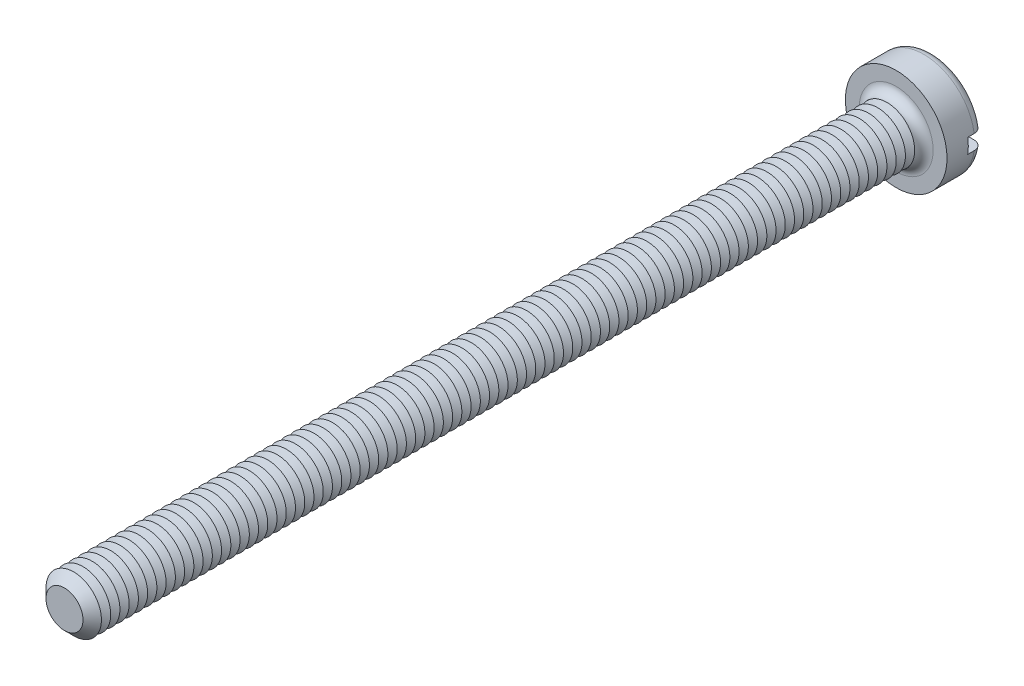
ISO-10303-21;
HEADER;
FILE_DESCRIPTION(('STEP AP214'),'2;1');
FILE_NAME('part.step','',(''),(''),'','','');
FILE_SCHEMA(('AUTOMOTIVE_DESIGN { 1 0 10303 214 1 1 1 1 }'));
ENDSEC;
DATA;
#1=APPLICATION_CONTEXT('core data for automotive mechanical design processes');
#2=APPLICATION_PROTOCOL_DEFINITION('international standard','automotive_design',2000,#1);
#3=PRODUCT_CONTEXT('',#1,'mechanical');
#4=PRODUCT('Part','Part','',(#3));
#5=PRODUCT_RELATED_PRODUCT_CATEGORY('part','',(#4));
#6=PRODUCT_DEFINITION_FORMATION('','',#4);
#7=PRODUCT_DEFINITION_CONTEXT('part definition',#1,'design');
#8=PRODUCT_DEFINITION('design','',#6,#7);
#9=PRODUCT_DEFINITION_SHAPE('','',#8);
#10=(LENGTH_UNIT() NAMED_UNIT(*) SI_UNIT(.MILLI.,.METRE.));
#11=(NAMED_UNIT(*) PLANE_ANGLE_UNIT() SI_UNIT($,.RADIAN.));
#12=(NAMED_UNIT(*) SI_UNIT($,.STERADIAN.) SOLID_ANGLE_UNIT());
#13=UNCERTAINTY_MEASURE_WITH_UNIT(LENGTH_MEASURE(1.E-05),#10,'distance_accuracy_value','');
#14=(GEOMETRIC_REPRESENTATION_CONTEXT(3) GLOBAL_UNCERTAINTY_ASSIGNED_CONTEXT((#13)) GLOBAL_UNIT_ASSIGNED_CONTEXT((#10,
#11,#12)) REPRESENTATION_CONTEXT('',''));
#15=CARTESIAN_POINT('',(0.,0.,0.));
#16=DIRECTION('',(0.,0.,1.));
#17=DIRECTION('',(1.,0.,0.));
#18=AXIS2_PLACEMENT_3D('',#15,#16,#17);
#19=CARTESIAN_POINT('',(0.,0.,-2.));
#20=DIRECTION('',(0.,0.,1.));
#21=DIRECTION('',(1.,0.,0.));
#22=AXIS2_PLACEMENT_3D('',#19,#20,#21);
#23=PLANE('',#22);
#24=CARTESIAN_POINT('',(0.,0.,-2.));
#25=DIRECTION('',(0.,0.,1.));
#26=DIRECTION('',(1.,0.,0.));
#27=AXIS2_PLACEMENT_3D('',#24,#25,#26);
#28=CIRCLE('',#27,2.25);
#29=CARTESIAN_POINT('',(-2.21415898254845,0.4,-2.));
#30=VERTEX_POINT('',#29);
#31=CARTESIAN_POINT('',(2.21415898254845,0.4,-2.));
#32=VERTEX_POINT('',#31);
#33=EDGE_CURVE('E116',#30,#32,#28,.F.);
#34=ORIENTED_EDGE('',*,*,#33,.T.);
#35=DIRECTION('',(1.,0.,0.));
#36=VECTOR('',#35,1.);
#37=CARTESIAN_POINT('',(-2.75,0.400000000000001,-2.));
#38=LINE('',#37,#36);
#39=EDGE_CURVE('E111',#30,#32,#38,.T.);
#40=ORIENTED_EDGE('',*,*,#39,.F.);
#41=EDGE_LOOP('',(#34,#40));
#42=FACE_BOUND('',#41,.T.);
#43=ADVANCED_FACE('F39',(#42),#23,.F.);
#44=CARTESIAN_POINT('',(0.,0.,-1.5));
#45=DIRECTION('',(0.,0.,1.));
#46=DIRECTION('',(1.,0.,0.));
#47=AXIS2_PLACEMENT_3D('',#44,#45,#46);
#48=TOROIDAL_SURFACE('',#47,2.25,0.5);
#49=CARTESIAN_POINT('',(-2.6296588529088,0.400000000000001,-1.78631483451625));
#50=CARTESIAN_POINT('',(-2.61332846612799,0.400000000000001,-1.80942627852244));
#51=CARTESIAN_POINT('',(-2.59501593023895,0.400000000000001,-1.83116426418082));
#52=CARTESIAN_POINT('',(-2.55497423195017,0.400000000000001,-1.87126271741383));
#53=CARTESIAN_POINT('',(-2.53324055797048,0.4,-1.88961865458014));
#54=CARTESIAN_POINT('',(-2.48702796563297,0.4,-1.92241505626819));
#55=CARTESIAN_POINT('',(-2.46255183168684,0.4,-1.93685944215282));
#56=CARTESIAN_POINT('',(-2.41154731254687,0.4,-1.96147315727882));
#57=CARTESIAN_POINT('',(-2.38501943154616,0.4,-1.97164353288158));
#58=CARTESIAN_POINT('',(-2.3303912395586,0.4,-1.98753780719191));
#59=CARTESIAN_POINT('',(-2.30227842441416,0.4,-1.99321871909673));
#60=CARTESIAN_POINT('',(-2.24549884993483,0.4,-1.99984170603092));
#61=CARTESIAN_POINT('',(-2.21683202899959,0.4,-2.00078325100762));
#62=CARTESIAN_POINT('',(-2.15939326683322,0.4,-1.99790249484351));
#63=CARTESIAN_POINT('',(-2.13062419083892,0.4,-1.99402290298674));
#64=CARTESIAN_POINT('',(-2.07413526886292,0.4,-1.98151915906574));
#65=CARTESIAN_POINT('',(-2.04641547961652,0.4,-1.97289475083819));
#66=CARTESIAN_POINT('',(-1.99264697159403,0.4,-1.95107177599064));
#67=CARTESIAN_POINT('',(-1.96660904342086,0.4,-1.93784659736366));
#68=CARTESIAN_POINT('',(-1.91713954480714,0.4,-1.90718730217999));
#69=CARTESIAN_POINT('',(-1.89370795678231,0.4,-1.88975321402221));
#70=CARTESIAN_POINT('',(-1.85029144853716,0.4,-1.85126548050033));
#71=CARTESIAN_POINT('',(-1.83028607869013,0.4,-1.83023492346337));
#72=CARTESIAN_POINT('',(-1.79417432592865,0.4,-1.78505552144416));
#73=CARTESIAN_POINT('',(-1.77806752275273,0.4,-1.76090701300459));
#74=CARTESIAN_POINT('',(-1.75056079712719,0.4,-1.71067721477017));
#75=CARTESIAN_POINT('',(-1.7390748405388,0.4,-1.68464306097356));
#76=CARTESIAN_POINT('',(-1.72075680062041,0.4,-1.63098625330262));
#77=CARTESIAN_POINT('',(-1.71392397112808,0.4,-1.60336385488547));
#78=CARTESIAN_POINT('',(-1.70525661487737,0.4,-1.54801066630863));
#79=CARTESIAN_POINT('',(-1.70330866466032,0.4,-1.52029759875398));
#80=CARTESIAN_POINT('',(-1.70414820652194,0.4,-1.46494458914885));
#81=CARTESIAN_POINT('',(-1.70693532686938,0.4,-1.43730464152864));
#82=CARTESIAN_POINT('',(-1.71709335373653,0.4,-1.38318389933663));
#83=CARTESIAN_POINT('',(-1.72441580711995,0.4,-1.35669397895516));
#84=CARTESIAN_POINT('',(-1.74335830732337,0.4,-1.30529964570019));
#85=CARTESIAN_POINT('',(-1.75497853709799,0.4,-1.2803953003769));
#86=CARTESIAN_POINT('',(-1.78229453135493,0.4,-1.23258298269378));
#87=CARTESIAN_POINT('',(-1.79803217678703,0.4,-1.20969896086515));
#88=CARTESIAN_POINT('',(-1.83304498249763,0.4,-1.16682064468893));
#89=CARTESIAN_POINT('',(-1.85232054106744,0.4,-1.1468266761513));
#90=CARTESIAN_POINT('',(-1.89433695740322,0.4,-1.10980713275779));
#91=CARTESIAN_POINT('',(-1.91714740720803,0.4,-1.09286053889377));
#92=CARTESIAN_POINT('',(-1.96524407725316,0.4,-1.06294809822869));
#93=CARTESIAN_POINT('',(-1.99053056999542,0.4,-1.04998269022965));
#94=CARTESIAN_POINT('',(-2.04340612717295,0.4,-1.02814800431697));
#95=CARTESIAN_POINT('',(-2.07103098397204,0.4,-1.01936532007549));
#96=CARTESIAN_POINT('',(-2.12735840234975,0.4,-1.00652373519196));
#97=CARTESIAN_POINT('',(-2.15606102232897,0.4,-1.00246509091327));
#98=CARTESIAN_POINT('',(-2.21395379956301,0.4,-0.999181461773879));
#99=CARTESIAN_POINT('',(-2.24314598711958,0.4,-0.999992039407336));
#100=CARTESIAN_POINT('',(-2.30097585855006,0.4,-1.00652779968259));
#101=CARTESIAN_POINT('',(-2.32961355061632,0.4,-1.01225290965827));
#102=CARTESIAN_POINT('',(-2.38536238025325,0.4,-1.02843951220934));
#103=CARTESIAN_POINT('',(-2.41248047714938,0.4,-1.03887701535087));
#104=CARTESIAN_POINT('',(-2.46454860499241,0.4,-1.06421009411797));
#105=CARTESIAN_POINT('',(-2.48949875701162,0.4,-1.0791054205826));
#106=CARTESIAN_POINT('',(-2.53620471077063,0.4,-1.11274531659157));
#107=CARTESIAN_POINT('',(-2.55799482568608,0.400000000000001,-1.1314422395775));
#108=CARTESIAN_POINT('',(-2.59807595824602,0.400000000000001,-1.17227176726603));
#109=CARTESIAN_POINT('',(-2.6163672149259,0.400000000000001,-1.19440413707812));
#110=CARTESIAN_POINT('',(-2.64868581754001,0.400000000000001,-1.24117072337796));
#111=CARTESIAN_POINT('',(-2.66276466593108,0.400000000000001,-1.26576935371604));
#112=CARTESIAN_POINT('',(-2.68654482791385,0.400000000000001,-1.31699754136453));
#113=CARTESIAN_POINT('',(-2.69624657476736,0.400000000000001,-1.34362689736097));
#114=CARTESIAN_POINT('',(-2.71090527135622,0.400000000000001,-1.39787706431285));
#115=CARTESIAN_POINT('',(-2.71590826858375,0.400000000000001,-1.4254854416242));
#116=CARTESIAN_POINT('',(-2.72118463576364,0.400000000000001,-1.48115803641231));
#117=CARTESIAN_POINT('',(-2.72145696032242,0.400000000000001,-1.50922235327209));
#118=CARTESIAN_POINT('',(-2.71727180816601,0.400000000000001,-1.56487271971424));
#119=CARTESIAN_POINT('',(-2.71283440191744,0.400000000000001,-1.59246029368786));
#120=CARTESIAN_POINT('',(-2.69939521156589,0.400000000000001,-1.64647499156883));
#121=CARTESIAN_POINT('',(-2.69039909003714,0.400000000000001,-1.67290351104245));
#122=CARTESIAN_POINT('',(-2.67251693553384,0.400000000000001,-1.71382731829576));
#123=CARTESIAN_POINT('',(-2.66497994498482,0.400000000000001,-1.72892686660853));
#124=CARTESIAN_POINT('',(-2.64841616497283,0.400000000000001,-1.75828509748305));
#125=CARTESIAN_POINT('',(-2.63938938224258,0.400000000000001,-1.77254378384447));
#126=CARTESIAN_POINT('',(-2.6296588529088,0.400000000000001,-1.78631483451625));
#127=B_SPLINE_CURVE_WITH_KNOTS('',3,(#49,#50,#51,#52,#53,#54,#55,#56,#57,#58,#59,#60,#61,#62,
#63,#64,#65,#66,#67,#68,#69,#70,#71,#72,#73,#74,#75,#76,#77,#78,#79,#80,#81,#82,#83,#84,#85,#86,
#87,#88,#89,#90,#91,#92,#93,#94,#95,#96,#97,#98,#99,#100,#101,#102,#103,#104,#105,#106,#107,
#108,#109,#110,#111,#112,#113,#114,#115,#116,#117,#118,#119,#120,#121,#122,#123,#124,#125,#126),
.UNSPECIFIED.,.T.,.F.,(4,2,2,2,2,2,2,2,2,2,2,2,2,2,2,2,2,2,2,2,2,2,2,2,2,2,2,2,2,2,2,2,2,2,2,2,
2,2,4),(0.,0.0848338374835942,0.16978050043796,0.254641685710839,0.339482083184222,
0.42512530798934,0.510778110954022,0.597458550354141,0.684143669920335,0.771338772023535,
0.858533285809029,0.945187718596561,1.03183280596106,1.11678035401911,1.20171427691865,
1.28465703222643,1.36759327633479,1.4496584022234,1.53172702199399,1.61466526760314,
1.69761285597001,1.78247103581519,1.86733856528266,1.95389396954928,2.0404540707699,
2.12764713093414,2.21483890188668,2.30159172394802,2.38833969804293,2.4740609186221,
2.55977628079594,2.6443962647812,2.72900787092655,2.81278135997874,2.89657336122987,
2.98000971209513,3.06334267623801,3.113891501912,3.16444009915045),.UNSPECIFIED.);
#128=CARTESIAN_POINT('',(-2.72075357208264,0.400000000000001,-1.50000000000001));
#129=VERTEX_POINT('',#128);
#130=EDGE_CURVE('E883',#129,#30,#127,.T.);
#131=ORIENTED_EDGE('',*,*,#130,.F.);
#132=CARTESIAN_POINT('',(0.,0.,-1.5));
#133=DIRECTION('',(0.,0.,1.));
#134=DIRECTION('',(1.,0.,0.));
#135=AXIS2_PLACEMENT_3D('',#132,#133,#134);
#136=CIRCLE('',#135,2.75);
#137=CARTESIAN_POINT('',(2.7207535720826,0.4,-1.5));
#138=VERTEX_POINT('',#137);
#139=EDGE_CURVE('E125',#138,#129,#136,.T.);
#140=ORIENTED_EDGE('',*,*,#139,.F.);
#141=CARTESIAN_POINT('',(1.7362507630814,0.4,-1.6752840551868));
#142=CARTESIAN_POINT('',(1.74636083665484,0.4,-1.70159961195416));
#143=CARTESIAN_POINT('',(1.7587429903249,0.4,-1.72706707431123));
#144=CARTESIAN_POINT('',(1.78764414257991,0.4,-1.77556609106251));
#145=CARTESIAN_POINT('',(1.80416918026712,0.4,-1.79859401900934));
#146=CARTESIAN_POINT('',(1.84080454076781,0.4,-1.84153587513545));
#147=CARTESIAN_POINT('',(1.86090949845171,0.4,-1.86145438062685));
#148=CARTESIAN_POINT('',(1.9041208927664,0.4,-1.89769607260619));
#149=CARTESIAN_POINT('',(1.92722659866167,0.4,-1.91402013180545));
#150=CARTESIAN_POINT('',(1.97620958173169,0.4,-1.94291288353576));
#151=CARTESIAN_POINT('',(2.00212726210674,0.4,-1.95541309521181));
#152=CARTESIAN_POINT('',(2.05567603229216,0.4,-1.97595143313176));
#153=CARTESIAN_POINT('',(2.08330733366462,0.4,-1.98398900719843));
#154=CARTESIAN_POINT('',(2.13989163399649,0.4,-1.99545904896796));
#155=CARTESIAN_POINT('',(2.16885726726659,0.4,-1.99882930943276));
#156=CARTESIAN_POINT('',(2.22694412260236,0.4,-2.00065872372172));
#157=CARTESIAN_POINT('',(2.25606534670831,0.4,-1.99911781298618));
#158=CARTESIAN_POINT('',(2.31362436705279,0.4,-1.99114818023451));
#159=CARTESIAN_POINT('',(2.34206235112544,0.4,-1.98472081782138));
#160=CARTESIAN_POINT('',(2.39743709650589,0.4,-1.96713601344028));
#161=CARTESIAN_POINT('',(2.42437392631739,0.4,-1.95597878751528));
#162=CARTESIAN_POINT('',(2.47569769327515,0.4,-1.92935960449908));
#163=CARTESIAN_POINT('',(2.50010686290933,0.4,-1.91394052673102));
#164=CARTESIAN_POINT('',(2.54594525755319,0.4,-1.8791725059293));
#165=CARTESIAN_POINT('',(2.56737468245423,0.4,-1.85982382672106));
#166=CARTESIAN_POINT('',(2.60634898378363,0.4,-1.81801641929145));
#167=CARTESIAN_POINT('',(2.6239407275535,0.4,-1.79560138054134));
#168=CARTESIAN_POINT('',(2.65505953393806,0.4,-1.7481077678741));
#169=CARTESIAN_POINT('',(2.66858686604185,0.4,-1.72302937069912));
#170=CARTESIAN_POINT('',(2.69103536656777,0.4,-1.67123055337));
#171=CARTESIAN_POINT('',(2.70000740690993,0.4,-1.64453217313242));
#172=CARTESIAN_POINT('',(2.71330608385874,0.4,-1.59000262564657));
#173=CARTESIAN_POINT('',(2.71763293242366,0.4,-1.5621715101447));
#174=CARTESIAN_POINT('',(2.72149675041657,0.4,-1.50637655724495));
#175=CARTESIAN_POINT('',(2.72106725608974,0.4,-1.47841503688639));
#176=CARTESIAN_POINT('',(2.7155123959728,0.4,-1.42296287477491));
#177=CARTESIAN_POINT('',(2.71038711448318,0.4,-1.39547222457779));
#178=CARTESIAN_POINT('',(2.69560462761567,0.4,-1.34178071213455));
#179=CARTESIAN_POINT('',(2.68595389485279,0.4,-1.31557806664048));
#180=CARTESIAN_POINT('',(2.66240876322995,0.4,-1.26515516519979));
#181=CARTESIAN_POINT('',(2.64851431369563,0.4,-1.24093493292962));
#182=CARTESIAN_POINT('',(2.61681930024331,0.4,-1.19504594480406));
#183=CARTESIAN_POINT('',(2.59900198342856,0.4,-1.17338876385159));
#184=CARTESIAN_POINT('',(2.56001495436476,0.4,-1.13333899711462));
#185=CARTESIAN_POINT('',(2.53884510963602,0.4,-1.11494654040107));
#186=CARTESIAN_POINT('',(2.49354554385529,0.4,-1.08175888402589));
#187=CARTESIAN_POINT('',(2.46938991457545,0.4,-1.06699905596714));
#188=CARTESIAN_POINT('',(2.41896725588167,0.4,-1.04168682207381));
#189=CARTESIAN_POINT('',(2.39270009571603,0.4,-1.03113467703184));
#190=CARTESIAN_POINT('',(2.33844927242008,0.4,-1.01439607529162));
#191=CARTESIAN_POINT('',(2.31044823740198,0.4,-1.00826592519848));
#192=CARTESIAN_POINT('',(2.25381752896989,0.4,-1.00073183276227));
#193=CARTESIAN_POINT('',(2.22518781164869,0.4,-0.999328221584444));
#194=CARTESIAN_POINT('',(2.16774231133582,0.4,-1.00127811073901));
#195=CARTESIAN_POINT('',(2.13892848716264,0.4,-1.00468955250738));
#196=CARTESIAN_POINT('',(2.08227193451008,0.4,-1.01626887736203));
#197=CARTESIAN_POINT('',(2.05442926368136,0.4,-1.02443704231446));
#198=CARTESIAN_POINT('',(2.00032604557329,0.4,-1.04537295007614));
#199=CARTESIAN_POINT('',(1.97407661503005,0.4,-1.05816944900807));
#200=CARTESIAN_POINT('',(1.92411255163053,0.4,-1.08801035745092));
#201=CARTESIAN_POINT('',(1.90039792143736,0.4,-1.10505477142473));
#202=CARTESIAN_POINT('',(1.85633574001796,0.4,-1.14282887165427));
#203=CARTESIAN_POINT('',(1.83597040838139,0.4,-1.16353779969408));
#204=CARTESIAN_POINT('',(1.79908731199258,0.4,-1.20813793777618));
#205=CARTESIAN_POINT('',(1.78256899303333,0.4,-1.23202868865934));
#206=CARTESIAN_POINT('',(1.75420022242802,0.4,-1.28183173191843));
#207=CARTESIAN_POINT('',(1.74226635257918,0.4,-1.30769648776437));
#208=CARTESIAN_POINT('',(1.72302798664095,0.4,-1.36110211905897));
#209=CARTESIAN_POINT('',(1.71572395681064,0.4,-1.38864316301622));
#210=CARTESIAN_POINT('',(1.70611974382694,0.4,-1.44392326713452));
#211=CARTESIAN_POINT('',(1.70370764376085,0.4,-1.47164298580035));
#212=CARTESIAN_POINT('',(1.70363822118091,0.4,-1.52706336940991));
#213=CARTESIAN_POINT('',(1.70597448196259,0.4,-1.55476400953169));
#214=CARTESIAN_POINT('',(1.71335146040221,0.4,-1.59796127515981));
#215=CARTESIAN_POINT('',(1.71686033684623,0.4,-1.61373520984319));
#216=CARTESIAN_POINT('',(1.7254146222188,0.4,-1.64486018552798));
#217=CARTESIAN_POINT('',(1.73045999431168,0.4,-1.66021123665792));
#218=CARTESIAN_POINT('',(1.7362507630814,0.4,-1.6752840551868));
#219=B_SPLINE_CURVE_WITH_KNOTS('',3,(#141,#142,#143,#144,#145,#146,#147,#148,#149,#150,#151,
#152,#153,#154,#155,#156,#157,#158,#159,#160,#161,#162,#163,#164,#165,#166,#167,#168,#169,#170,
#171,#172,#173,#174,#175,#176,#177,#178,#179,#180,#181,#182,#183,#184,#185,#186,#187,#188,#189,
#190,#191,#192,#193,#194,#195,#196,#197,#198,#199,#200,#201,#202,#203,#204,#205,#206,#207,#208,
#209,#210,#211,#212,#213,#214,#215,#216,#217,#218),.UNSPECIFIED.,.T.,.F.,(4,2,2,2,2,2,2,2,2,2,2,
2,2,2,2,2,2,2,2,2,2,2,2,2,2,2,2,2,2,2,2,2,2,2,2,2,2,2,4),(0.,0.0845117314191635,
0.169147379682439,0.253657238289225,0.338146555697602,0.424070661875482,0.510005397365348,
0.597074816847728,0.684145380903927,0.771191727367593,0.858234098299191,0.94443074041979,
1.03062159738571,1.11569223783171,1.20075723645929,1.28485012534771,1.36893917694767,
1.45243570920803,1.53593074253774,1.61930671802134,1.70268368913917,1.7864238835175,
1.87016738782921,1.95469664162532,2.03923113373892,2.12482389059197,2.21042264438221,
2.29706026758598,2.38370302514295,2.47089361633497,2.55808429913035,2.64479602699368,
2.73149525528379,2.81653234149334,2.9015779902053,2.98465497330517,3.06761976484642,
3.11602689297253,3.164432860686),.UNSPECIFIED.);
#220=EDGE_CURVE('E885',#32,#138,#219,.T.);
#221=ORIENTED_EDGE('',*,*,#220,.F.);
#222=ORIENTED_EDGE('',*,*,#33,.F.);
#223=EDGE_LOOP('',(#131,#140,#221,#222));
#224=FACE_BOUND('',#223,.T.);
#225=ADVANCED_FACE('F867',(#224),#48,.T.);
#226=CARTESIAN_POINT('',(0.,0.,-2.));
#227=DIRECTION('',(0.,0.,1.));
#228=DIRECTION('',(1.,0.,0.));
#229=AXIS2_PLACEMENT_3D('',#226,#227,#228);
#230=CYLINDRICAL_SURFACE('',#229,2.75);
#231=DIRECTION('',(0.,0.,1.));
#232=VECTOR('',#231,1.);
#233=CARTESIAN_POINT('',(2.72075357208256,0.4,-2.));
#234=LINE('',#233,#232);
#235=CARTESIAN_POINT('',(2.72075357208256,0.4,-1.15));
#236=VERTEX_POINT('',#235);
#237=EDGE_CURVE('E900',#138,#236,#234,.T.);
#238=ORIENTED_EDGE('',*,*,#237,.F.);
#239=ORIENTED_EDGE('',*,*,#139,.T.);
#240=DIRECTION('',(0.,0.,1.));
#241=VECTOR('',#240,1.);
#242=CARTESIAN_POINT('',(-2.72075357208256,0.4,-2.));
#243=LINE('',#242,#241);
#244=CARTESIAN_POINT('',(-2.72075357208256,0.4,-1.15));
#245=VERTEX_POINT('',#244);
#246=EDGE_CURVE('E63',#245,#129,#243,.F.);
#247=ORIENTED_EDGE('',*,*,#246,.F.);
#248=CARTESIAN_POINT('',(0.,0.,-1.15));
#249=DIRECTION('',(0.,0.,-1.));
#250=DIRECTION('',(-1.,0.,0.));
#251=AXIS2_PLACEMENT_3D('',#248,#249,#250);
#252=CIRCLE('',#251,2.75);
#253=CARTESIAN_POINT('',(-2.72075357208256,-0.4,-1.15));
#254=VERTEX_POINT('',#253);
#255=EDGE_CURVE('E43',#245,#254,#252,.F.);
#256=ORIENTED_EDGE('',*,*,#255,.T.);
#257=DIRECTION('',(0.,0.,1.));
#258=VECTOR('',#257,1.);
#259=CARTESIAN_POINT('',(-2.72075357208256,-0.4,-2.));
#260=LINE('',#259,#258);
#261=CARTESIAN_POINT('',(-2.72075357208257,-0.4,-1.5));
#262=VERTEX_POINT('',#261);
#263=EDGE_CURVE('E897',#262,#254,#260,.T.);
#264=ORIENTED_EDGE('',*,*,#263,.F.);
#265=CARTESIAN_POINT('',(2.72075357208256,-0.4,-1.5));
#266=VERTEX_POINT('',#265);
#267=EDGE_CURVE('E127',#262,#266,#136,.T.);
#268=ORIENTED_EDGE('',*,*,#267,.T.);
#269=DIRECTION('',(0.,0.,1.));
#270=VECTOR('',#269,1.);
#271=CARTESIAN_POINT('',(2.72075357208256,-0.4,-2.));
#272=LINE('',#271,#270);
#273=CARTESIAN_POINT('',(2.72075357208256,-0.4,-1.15));
#274=VERTEX_POINT('',#273);
#275=EDGE_CURVE('E55',#274,#266,#272,.F.);
#276=ORIENTED_EDGE('',*,*,#275,.F.);
#277=EDGE_CURVE('E11',#274,#236,#252,.F.);
#278=ORIENTED_EDGE('',*,*,#277,.T.);
#279=EDGE_LOOP('',(#238,#239,#247,#256,#264,#268,#276,#278));
#280=FACE_BOUND('',#279,.T.);
#281=CARTESIAN_POINT('',(0.,0.,0.));
#282=DIRECTION('',(0.,0.,1.));
#283=DIRECTION('',(1.,0.,0.));
#284=AXIS2_PLACEMENT_3D('',#281,#282,#283);
#285=CIRCLE('',#284,2.75);
#286=CARTESIAN_POINT('',(2.75,0.,0.));
#287=VERTEX_POINT('',#286);
#288=EDGE_CURVE('E903',#287,#287,#285,.T.);
#289=ORIENTED_EDGE('',*,*,#288,.F.);
#290=EDGE_LOOP('',(#289));
#291=FACE_BOUND('',#290,.T.);
#292=ADVANCED_FACE('F863',(#280,#291),#230,.T.);
#293=CARTESIAN_POINT('',(2.21415898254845,-0.4,-2.));
#294=VERTEX_POINT('',#293);
#295=CARTESIAN_POINT('',(-2.21415898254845,-0.4,-2.));
#296=VERTEX_POINT('',#295);
#297=EDGE_CURVE('E109',#294,#296,#28,.F.);
#298=ORIENTED_EDGE('',*,*,#297,.T.);
#299=DIRECTION('',(-1.,0.,0.));
#300=VECTOR('',#299,1.);
#301=CARTESIAN_POINT('',(-2.75,-0.4,-2.));
#302=LINE('',#301,#300);
#303=EDGE_CURVE('E96',#294,#296,#302,.T.);
#304=ORIENTED_EDGE('',*,*,#303,.F.);
#305=EDGE_LOOP('',(#298,#304));
#306=FACE_BOUND('',#305,.T.);
#307=ADVANCED_FACE('F108',(#306),#23,.F.);
#308=CARTESIAN_POINT('',(0.,0.,0.));
#309=DIRECTION('',(0.,0.,1.));
#310=DIRECTION('',(1.,0.,0.));
#311=AXIS2_PLACEMENT_3D('',#308,#309,#310);
#312=PLANE('',#311);
#313=CARTESIAN_POINT('',(0.,0.,0.));
#314=DIRECTION('',(0.,0.,1.));
#315=DIRECTION('',(1.,0.,0.));
#316=AXIS2_PLACEMENT_3D('',#313,#314,#315);
#317=CIRCLE('',#316,2.);
#318=CARTESIAN_POINT('',(2.,0.,0.));
#319=VERTEX_POINT('',#318);
#320=EDGE_CURVE('E115',#319,#319,#317,.F.);
#321=ORIENTED_EDGE('',*,*,#320,.T.);
#322=EDGE_LOOP('',(#321));
#323=FACE_BOUND('',#322,.T.);
#324=ORIENTED_EDGE('',*,*,#288,.T.);
#325=EDGE_LOOP('',(#324));
#326=FACE_BOUND('',#325,.T.);
#327=ADVANCED_FACE('F862',(#323,#326),#312,.T.);
#328=CARTESIAN_POINT('',(-2.6296588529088,-0.4,-1.78631483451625));
#329=CARTESIAN_POINT('',(-2.64575286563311,-0.4,-1.76353353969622));
#330=CARTESIAN_POINT('',(-2.65994473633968,-0.4,-1.73938506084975));
#331=CARTESIAN_POINT('',(-2.68408879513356,-0.4,-1.68903091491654));
#332=CARTESIAN_POINT('',(-2.69403633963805,-0.4,-1.6628230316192));
#333=CARTESIAN_POINT('',(-2.70937899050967,-0.4,-1.60911025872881));
#334=CARTESIAN_POINT('',(-2.71477511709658,-0.4,-1.5816056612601));
#335=CARTESIAN_POINT('',(-2.72085365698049,-0.4,-1.52608718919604));
#336=CARTESIAN_POINT('',(-2.7215371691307,-0.4,-1.49807343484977));
#337=CARTESIAN_POINT('',(-2.71817903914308,-0.4,-1.44242333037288));
#338=CARTESIAN_POINT('',(-2.71415291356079,-0.4,-1.41478604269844));
#339=CARTESIAN_POINT('',(-2.70152104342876,-0.4,-1.36057835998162));
#340=CARTESIAN_POINT('',(-2.69291517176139,-0.4,-1.33400799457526));
#341=CARTESIAN_POINT('',(-2.67137052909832,-0.4,-1.28266198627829));
#342=CARTESIAN_POINT('',(-2.65842829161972,-0.4,-1.25788779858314));
#343=CARTESIAN_POINT('',(-2.62859348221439,-0.4,-1.21084577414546));
#344=CARTESIAN_POINT('',(-2.61170082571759,-0.4,-1.18857799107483));
#345=CARTESIAN_POINT('',(-2.5743351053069,-0.4,-1.1470221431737));
#346=CARTESIAN_POINT('',(-2.55383974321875,-0.4,-1.12775413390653));
#347=CARTESIAN_POINT('',(-2.5099353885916,-0.4,-1.09288845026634));
#348=CARTESIAN_POINT('',(-2.48652625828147,-0.4,-1.07729094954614));
#349=CARTESIAN_POINT('',(-2.43718903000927,-0.4,-1.0500239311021));
#350=CARTESIAN_POINT('',(-2.41123629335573,-0.4,-1.0383990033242));
#351=CARTESIAN_POINT('',(-2.35776417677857,-0.4,-1.01960886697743));
#352=CARTESIAN_POINT('',(-2.33024469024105,-0.4,-1.01244396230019));
#353=CARTESIAN_POINT('',(-2.27404134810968,-0.4,-1.00268156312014));
#354=CARTESIAN_POINT('',(-2.24534705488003,-0.4,-1.00014414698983));
#355=CARTESIAN_POINT('',(-2.18793513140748,-0.4,-0.999867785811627));
#356=CARTESIAN_POINT('',(-2.15921749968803,-0.4,-1.00212917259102));
#357=CARTESIAN_POINT('',(-2.10225052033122,-0.4,-1.01142552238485));
#358=CARTESIAN_POINT('',(-2.07400941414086,-0.4,-1.01851105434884));
#359=CARTESIAN_POINT('',(-2.01911044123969,-0.4,-1.03730994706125));
#360=CARTESIAN_POINT('',(-1.99245264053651,-0.4,-1.04902350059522));
#361=CARTESIAN_POINT('',(-1.94142108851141,-0.4,-1.07679847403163));
#362=CARTESIAN_POINT('',(-1.91705303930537,-0.4,-1.09287038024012));
#363=CARTESIAN_POINT('',(-1.87139758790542,-0.4,-1.12891897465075));
#364=CARTESIAN_POINT('',(-1.85011007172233,-0.4,-1.14889551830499));
#365=CARTESIAN_POINT('',(-1.81149058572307,-0.4,-1.19196940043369));
#366=CARTESIAN_POINT('',(-1.79411779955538,-0.4,-1.21503011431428));
#367=CARTESIAN_POINT('',(-1.76359546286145,-0.4,-1.26379588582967));
#368=CARTESIAN_POINT('',(-1.75044532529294,-0.4,-1.28950057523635));
#369=CARTESIAN_POINT('',(-1.72906221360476,-0.4,-1.3422057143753));
#370=CARTESIAN_POINT('',(-1.72072512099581,-0.4,-1.3691639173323));
#371=CARTESIAN_POINT('',(-1.70880448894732,-0.4,-1.42411084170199));
#372=CARTESIAN_POINT('',(-1.7052202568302,-0.4,-1.45209941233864));
#373=CARTESIAN_POINT('',(-1.70295553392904,-0.4,-1.50768522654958));
#374=CARTESIAN_POINT('',(-1.70417398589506,-0.4,-1.53527840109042));
#375=CARTESIAN_POINT('',(-1.71124536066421,-0.4,-1.58986292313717));
#376=CARTESIAN_POINT('',(-1.71709811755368,-0.4,-1.61685429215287));
#377=CARTESIAN_POINT('',(-1.73321132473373,-0.4,-1.66938107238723));
#378=CARTESIAN_POINT('',(-1.74345625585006,-0.4,-1.69492125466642));
#379=CARTESIAN_POINT('',(-1.76802111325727,-0.4,-1.74395877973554));
#380=CARTESIAN_POINT('',(-1.78234133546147,-0.4,-1.76745597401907));
#381=CARTESIAN_POINT('',(-1.81488631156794,-0.4,-1.81216193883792));
#382=CARTESIAN_POINT('',(-1.83317116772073,-0.4,-1.83332693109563));
#383=CARTESIAN_POINT('',(-1.87296030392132,-0.4,-1.872375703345));
#384=CARTESIAN_POINT('',(-1.89446497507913,-0.4,-1.89025908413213));
#385=CARTESIAN_POINT('',(-1.94063077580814,-0.4,-1.92267732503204));
#386=CARTESIAN_POINT('',(-1.96535444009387,-0.4,-1.93712316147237));
#387=CARTESIAN_POINT('',(-2.01684705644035,-0.4,-1.96173690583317));
#388=CARTESIAN_POINT('',(-2.04361620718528,-0.4,-1.97190439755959));
#389=CARTESIAN_POINT('',(-2.09891021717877,-0.4,-1.9878230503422));
#390=CARTESIAN_POINT('',(-2.12745653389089,-0.4,-1.99349978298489));
#391=CARTESIAN_POINT('',(-2.18509639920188,-0.4,-1.99999556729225));
#392=CARTESIAN_POINT('',(-2.21418994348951,-0.4,-2.00081465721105));
#393=CARTESIAN_POINT('',(-2.27218032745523,-0.4,-1.99755156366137));
#394=CARTESIAN_POINT('',(-2.30107643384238,-0.4,-1.99345627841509));
#395=CARTESIAN_POINT('',(-2.35776697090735,-0.4,-1.98043125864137));
#396=CARTESIAN_POINT('',(-2.38556116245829,-0.4,-1.97150048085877));
#397=CARTESIAN_POINT('',(-2.43901832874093,-0.4,-1.94912081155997));
#398=CARTESIAN_POINT('',(-2.46469578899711,-0.4,-1.93570648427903));
#399=CARTESIAN_POINT('',(-2.51337022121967,-0.4,-1.90471183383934));
#400=CARTESIAN_POINT('',(-2.53637056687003,-0.4,-1.88713684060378));
#401=CARTESIAN_POINT('',(-2.57111030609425,-0.4,-1.85552084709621));
#402=CARTESIAN_POINT('',(-2.58386709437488,-0.4,-1.84257896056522));
#403=CARTESIAN_POINT('',(-2.60790410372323,-0.4,-1.81538935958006));
#404=CARTESIAN_POINT('',(-2.61918433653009,-0.4,-1.80114165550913));
#405=CARTESIAN_POINT('',(-2.6296588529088,-0.4,-1.78631483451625));
#406=B_SPLINE_CURVE_WITH_KNOTS('',3,(#328,#329,#330,#331,#332,#333,#334,#335,#336,#337,#338,
#339,#340,#341,#342,#343,#344,#345,#346,#347,#348,#349,#350,#351,#352,#353,#354,#355,#356,#357,
#358,#359,#360,#361,#362,#363,#364,#365,#366,#367,#368,#369,#370,#371,#372,#373,#374,#375,#376,
#377,#378,#379,#380,#381,#382,#383,#384,#385,#386,#387,#388,#389,#390,#391,#392,#393,#394,#395,
#396,#397,#398,#399,#400,#401,#402,#403,#404,#405),.UNSPECIFIED.,.T.,.F.,(4,2,2,2,2,2,2,2,2,2,2,
2,2,2,2,2,2,2,2,2,2,2,2,2,2,2,2,2,2,2,2,2,2,2,2,2,2,2,4),(0.,0.0836125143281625,
0.167316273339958,0.251001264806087,0.334666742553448,0.418057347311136,0.501450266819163,
0.584910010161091,0.668371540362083,0.752369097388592,0.836370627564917,0.921286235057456,
1.00620762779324,1.09222390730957,1.17824613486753,1.26518425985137,1.35212600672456,
1.43927882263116,1.52642841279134,1.61262232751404,1.69880425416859,1.7830443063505,
1.86727208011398,1.9497371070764,2.03219918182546,2.1143722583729,2.19655130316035,
2.28007615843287,2.36361116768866,2.44911836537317,2.53463387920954,2.62153862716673,
2.70844269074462,2.79557895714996,2.88273403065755,2.96923214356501,3.05562004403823,
3.11003826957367,3.16445606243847),.UNSPECIFIED.);
#407=EDGE_CURVE('E103',#296,#262,#406,.T.);
#408=ORIENTED_EDGE('',*,*,#407,.F.);
#409=ORIENTED_EDGE('',*,*,#297,.F.);
#410=CARTESIAN_POINT('',(1.7362507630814,-0.4,-1.6752840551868));
#411=CARTESIAN_POINT('',(1.72641416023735,-0.4,-1.64967314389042));
#412=CARTESIAN_POINT('',(1.71871480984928,-0.4,-1.62322216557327));
#413=CARTESIAN_POINT('',(1.70786038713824,-0.4,-1.56938399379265));
#414=CARTESIAN_POINT('',(1.70470970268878,-0.4,-1.54199592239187));
#415=CARTESIAN_POINT('',(1.70306971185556,-0.4,-1.48708393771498));
#416=CARTESIAN_POINT('',(1.70457942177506,-0.4,-1.45956005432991));
#417=CARTESIAN_POINT('',(1.71220670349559,-0.4,-1.40516538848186));
#418=CARTESIAN_POINT('',(1.71832341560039,-0.4,-1.3782944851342));
#419=CARTESIAN_POINT('',(1.73494792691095,-0.4,-1.32598312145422));
#420=CARTESIAN_POINT('',(1.74545076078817,-0.4,-1.30054108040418));
#421=CARTESIAN_POINT('',(1.77051013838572,-0.4,-1.25173932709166));
#422=CARTESIAN_POINT('',(1.7850670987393,-0.4,-1.22837982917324));
#423=CARTESIAN_POINT('',(1.81806903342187,-0.4,-1.1839775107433));
#424=CARTESIAN_POINT('',(1.8365752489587,-0.4,-1.16298023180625));
#425=CARTESIAN_POINT('',(1.87677669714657,-0.4,-1.1243010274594));
#426=CARTESIAN_POINT('',(1.89847230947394,-0.4,-1.10661949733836));
#427=CARTESIAN_POINT('',(1.94498854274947,-0.4,-1.07463966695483));
#428=CARTESIAN_POINT('',(1.96987078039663,-0.4,-1.06043095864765));
#429=CARTESIAN_POINT('',(2.02163980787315,-0.4,-1.0363161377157));
#430=CARTESIAN_POINT('',(2.04852678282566,-0.4,-1.02641042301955));
#431=CARTESIAN_POINT('',(2.10400319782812,-0.4,-1.01104128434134));
#432=CARTESIAN_POINT('',(2.13261287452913,-0.4,-1.00565079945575));
#433=CARTESIAN_POINT('',(2.19033179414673,-0.4,-0.999735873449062));
#434=CARTESIAN_POINT('',(2.2194410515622,-0.4,-0.999211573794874));
#435=CARTESIAN_POINT('',(2.27740442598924,-0.4,-1.00306591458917));
#436=CARTESIAN_POINT('',(2.30625777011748,-0.4,-1.00745623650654));
#437=CARTESIAN_POINT('',(2.36280530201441,-0.4,-1.02105937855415));
#438=CARTESIAN_POINT('',(2.39049952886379,-0.4,-1.03027203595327));
#439=CARTESIAN_POINT('',(2.44369359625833,-0.4,-1.05318710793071));
#440=CARTESIAN_POINT('',(2.46920965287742,-0.4,-1.0668518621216));
#441=CARTESIAN_POINT('',(2.51754507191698,-0.4,-1.09832423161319));
#442=CARTESIAN_POINT('',(2.54036461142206,-0.4,-1.11613157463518));
#443=CARTESIAN_POINT('',(2.58234752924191,-0.4,-1.15513986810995));
#444=CARTESIAN_POINT('',(2.601553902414,-0.4,-1.1762945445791));
#445=CARTESIAN_POINT('',(2.63609001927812,-0.4,-1.22156192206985));
#446=CARTESIAN_POINT('',(2.65142002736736,-0.4,-1.24567442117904));
#447=CARTESIAN_POINT('',(2.67757733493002,-0.4,-1.29585881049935));
#448=CARTESIAN_POINT('',(2.68845668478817,-0.4,-1.32190357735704));
#449=CARTESIAN_POINT('',(2.7056478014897,-0.4,-1.375459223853));
#450=CARTESIAN_POINT('',(2.71195980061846,-0.4,-1.40297002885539));
#451=CARTESIAN_POINT('',(2.71979288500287,-0.4,-1.45843707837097));
#452=CARTESIAN_POINT('',(2.72135241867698,-0.4,-1.48638789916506));
#453=CARTESIAN_POINT('',(2.71974298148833,-0.4,-1.54215266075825));
#454=CARTESIAN_POINT('',(2.71657412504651,-0.4,-1.56996660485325));
#455=CARTESIAN_POINT('',(2.70561779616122,-0.4,-1.62459191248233));
#456=CARTESIAN_POINT('',(2.69784258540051,-0.4,-1.65140573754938));
#457=CARTESIAN_POINT('',(2.6779146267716,-0.4,-1.70335337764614));
#458=CARTESIAN_POINT('',(2.66576185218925,-0.4,-1.72848718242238));
#459=CARTESIAN_POINT('',(2.63739107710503,-0.4,-1.77645196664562));
#460=CARTESIAN_POINT('',(2.62116029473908,-0.4,-1.79927538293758));
#461=CARTESIAN_POINT('',(2.58512700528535,-0.4,-1.84190182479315));
#462=CARTESIAN_POINT('',(2.56532438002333,-0.4,-1.86170475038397));
#463=CARTESIAN_POINT('',(2.522535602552,-0.4,-1.89791219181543));
#464=CARTESIAN_POINT('',(2.49952399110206,-0.4,-1.91428661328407));
#465=CARTESIAN_POINT('',(2.45110500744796,-0.4,-1.94299324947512));
#466=CARTESIAN_POINT('',(2.4256974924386,-0.4,-1.95532522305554));
#467=CARTESIAN_POINT('',(2.37288090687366,-0.4,-1.97575769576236));
#468=CARTESIAN_POINT('',(2.34545135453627,-0.4,-1.98380524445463));
#469=CARTESIAN_POINT('',(2.28963821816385,-0.4,-1.99524443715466));
#470=CARTESIAN_POINT('',(2.26125456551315,-0.4,-1.99863574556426));
#471=CARTESIAN_POINT('',(2.20395671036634,-0.4,-2.00070487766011));
#472=CARTESIAN_POINT('',(2.17504033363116,-0.4,-1.99932265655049));
#473=CARTESIAN_POINT('',(2.11784130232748,-0.4,-1.9917648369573));
#474=CARTESIAN_POINT('',(2.08955866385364,-0.4,-1.98558911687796));
#475=CARTESIAN_POINT('',(2.03419451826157,-0.4,-1.96854979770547));
#476=CARTESIAN_POINT('',(2.00712437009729,-0.4,-1.95764925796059));
#477=CARTESIAN_POINT('',(1.95519572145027,-0.4,-1.93144413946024));
#478=CARTESIAN_POINT('',(1.93033780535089,-0.4,-1.91613840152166));
#479=CARTESIAN_POINT('',(1.88362525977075,-0.4,-1.88157419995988));
#480=CARTESIAN_POINT('',(1.86176428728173,-0.4,-1.86232430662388));
#481=CARTESIAN_POINT('',(1.82167218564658,-0.4,-1.82038600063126));
#482=CARTESIAN_POINT('',(1.803436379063,-0.4,-1.7977020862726));
#483=CARTESIAN_POINT('',(1.77700088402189,-0.4,-1.7582526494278));
#484=CARTESIAN_POINT('',(1.7675549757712,-0.4,-1.74230781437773));
#485=CARTESIAN_POINT('',(1.75049861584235,-0.4,-1.70946415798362));
#486=CARTESIAN_POINT('',(1.7428881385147,-0.4,-1.69256534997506));
#487=CARTESIAN_POINT('',(1.7362507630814,-0.4,-1.6752840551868));
#488=B_SPLINE_CURVE_WITH_KNOTS('',3,(#410,#411,#412,#413,#414,#415,#416,#417,#418,#419,#420,
#421,#422,#423,#424,#425,#426,#427,#428,#429,#430,#431,#432,#433,#434,#435,#436,#437,#438,#439,
#440,#441,#442,#443,#444,#445,#446,#447,#448,#449,#450,#451,#452,#453,#454,#455,#456,#457,#458,
#459,#460,#461,#462,#463,#464,#465,#466,#467,#468,#469,#470,#471,#472,#473,#474,#475,#476,#477,
#478,#479,#480,#481,#482,#483,#484,#485,#486,#487),.UNSPECIFIED.,.T.,.F.,(4,2,2,2,2,2,2,2,2,2,2,
2,2,2,2,2,2,2,2,2,2,2,2,2,2,2,2,2,2,2,2,2,2,2,2,2,2,2,4),(0.,0.0822382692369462,
0.164555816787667,0.246855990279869,0.329140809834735,0.411332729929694,0.493533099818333,
0.577115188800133,0.660707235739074,0.746270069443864,0.831840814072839,0.918768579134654,
1.00569887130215,1.09283622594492,1.17997064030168,1.26638632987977,1.35279634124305,
1.43810213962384,1.52340211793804,1.60767384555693,1.69194128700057,1.77552515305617,
1.85910699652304,1.94246734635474,2.02582820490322,2.10945367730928,2.19308191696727,
2.2774160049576,2.36175512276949,2.4471137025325,2.53247843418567,2.61892083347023,
2.70536542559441,2.79249842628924,2.87965437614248,2.96662291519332,3.05347850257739,
3.10897061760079,3.16446195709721),.UNSPECIFIED.);
#489=EDGE_CURVE('E92',#266,#294,#488,.T.);
#490=ORIENTED_EDGE('',*,*,#489,.F.);
#491=ORIENTED_EDGE('',*,*,#267,.F.);
#492=EDGE_LOOP('',(#408,#409,#490,#491));
#493=FACE_BOUND('',#492,.T.);
#494=ADVANCED_FACE('F113',(#493),#48,.T.);
#495=CARTESIAN_POINT('',(0.,0.,0.5));
#496=DIRECTION('',(0.,0.,1.));
#497=DIRECTION('',(1.,0.,0.));
#498=AXIS2_PLACEMENT_3D('',#495,#496,#497);
#499=TOROIDAL_SURFACE('',#498,2.,0.5);
#500=ORIENTED_EDGE('',*,*,#320,.F.);
#501=EDGE_LOOP('',(#500));
#502=FACE_BOUND('',#501,.T.);
#503=CARTESIAN_POINT('',(0.,0.,0.5));
#504=DIRECTION('',(0.,0.,-1.));
#505=DIRECTION('',(-1.,0.,0.));
#506=AXIS2_PLACEMENT_3D('',#503,#504,#505);
#507=CIRCLE('',#506,1.5);
#508=CARTESIAN_POINT('',(-1.5,0.,0.5));
#509=VERTEX_POINT('',#508);
#510=EDGE_CURVE('E907',#509,#509,#507,.T.);
#511=ORIENTED_EDGE('',*,*,#510,.T.);
#512=EDGE_LOOP('',(#511));
#513=FACE_BOUND('',#512,.T.);
#514=ADVANCED_FACE('F855',(#502,#513),#499,.F.);
#515=CARTESIAN_POINT('',(0.,0.,0.750000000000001));
#516=DIRECTION('',(0.,0.,-1.));
#517=DIRECTION('',(-1.,0.,0.));
#518=AXIS2_PLACEMENT_3D('',#515,#516,#517);
#519=CONICAL_SURFACE('',#518,1.06698729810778,1.0471975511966);
#520=ORIENTED_EDGE('',*,*,#510,.F.);
#521=EDGE_LOOP('',(#520));
#522=FACE_BOUND('',#521,.T.);
#523=CARTESIAN_POINT('',(0.,0.,0.750000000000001));
#524=DIRECTION('',(0.,0.,-1.));
#525=DIRECTION('',(-1.,0.,0.));
#526=AXIS2_PLACEMENT_3D('',#523,#524,#525);
#527=CIRCLE('',#526,1.06698729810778);
#528=CARTESIAN_POINT('',(-1.06698729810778,0.,0.750000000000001));
#529=VERTEX_POINT('',#528);
#530=EDGE_CURVE('E912',#529,#529,#527,.T.);
#531=ORIENTED_EDGE('',*,*,#530,.T.);
#532=EDGE_LOOP('',(#531));
#533=FACE_BOUND('',#532,.T.);
#534=ADVANCED_FACE('F851',(#522,#533),#519,.T.);
#535=CARTESIAN_POINT('',(0.,0.,1.));
#536=DIRECTION('',(0.,0.,1.));
#537=DIRECTION('',(1.,0.,0.));
#538=AXIS2_PLACEMENT_3D('',#535,#536,#537);
#539=CONICAL_SURFACE('',#538,1.5,1.0471975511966);
#540=ORIENTED_EDGE('',*,*,#530,.F.);
#541=EDGE_LOOP('',(#540));
#542=FACE_BOUND('',#541,.T.);
#543=CARTESIAN_POINT('',(0.,0.,1.));
#544=DIRECTION('',(0.,0.,-1.));
#545=DIRECTION('',(-1.,0.,0.));
#546=AXIS2_PLACEMENT_3D('',#543,#544,#545);
#547=CIRCLE('',#546,1.5);
#548=CARTESIAN_POINT('',(-1.5,0.,1.));
#549=VERTEX_POINT('',#548);
#550=EDGE_CURVE('E917',#549,#549,#547,.T.);
#551=ORIENTED_EDGE('',*,*,#550,.T.);
#552=EDGE_LOOP('',(#551));
#553=FACE_BOUND('',#552,.T.);
#554=ADVANCED_FACE('F847',(#542,#553),#539,.T.);
#555=CARTESIAN_POINT('',(0.,0.,1.25));
#556=DIRECTION('',(0.,0.,-1.));
#557=DIRECTION('',(-1.,0.,0.));
#558=AXIS2_PLACEMENT_3D('',#555,#556,#557);
#559=CONICAL_SURFACE('',#558,1.06698729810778,1.0471975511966);
#560=ORIENTED_EDGE('',*,*,#550,.F.);
#561=EDGE_LOOP('',(#560));
#562=FACE_BOUND('',#561,.T.);
#563=CARTESIAN_POINT('',(0.,0.,1.25));
#564=DIRECTION('',(0.,0.,-1.));
#565=DIRECTION('',(-1.,0.,0.));
#566=AXIS2_PLACEMENT_3D('',#563,#564,#565);
#567=CIRCLE('',#566,1.06698729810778);
#568=CARTESIAN_POINT('',(-1.06698729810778,0.,1.25));
#569=VERTEX_POINT('',#568);
#570=EDGE_CURVE('E921',#569,#569,#567,.T.);
#571=ORIENTED_EDGE('',*,*,#570,.T.);
#572=EDGE_LOOP('',(#571));
#573=FACE_BOUND('',#572,.T.);
#574=ADVANCED_FACE('F843',(#562,#573),#559,.T.);
#575=CARTESIAN_POINT('',(0.,0.,1.5));
#576=DIRECTION('',(0.,0.,1.));
#577=DIRECTION('',(1.,0.,0.));
#578=AXIS2_PLACEMENT_3D('',#575,#576,#577);
#579=CONICAL_SURFACE('',#578,1.5,1.0471975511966);
#580=ORIENTED_EDGE('',*,*,#570,.F.);
#581=EDGE_LOOP('',(#580));
#582=FACE_BOUND('',#581,.T.);
#583=CARTESIAN_POINT('',(0.,0.,1.5));
#584=DIRECTION('',(0.,0.,-1.));
#585=DIRECTION('',(-1.,0.,0.));
#586=AXIS2_PLACEMENT_3D('',#583,#584,#585);
#587=CIRCLE('',#586,1.5);
#588=CARTESIAN_POINT('',(-1.5,0.,1.5));
#589=VERTEX_POINT('',#588);
#590=EDGE_CURVE('E925',#589,#589,#587,.T.);
#591=ORIENTED_EDGE('',*,*,#590,.T.);
#592=EDGE_LOOP('',(#591));
#593=FACE_BOUND('',#592,.T.);
#594=ADVANCED_FACE('F839',(#582,#593),#579,.T.);
#595=CARTESIAN_POINT('',(0.,0.,1.75));
#596=DIRECTION('',(0.,0.,-1.));
#597=DIRECTION('',(-1.,0.,0.));
#598=AXIS2_PLACEMENT_3D('',#595,#596,#597);
#599=CONICAL_SURFACE('',#598,1.06698729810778,1.0471975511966);
#600=ORIENTED_EDGE('',*,*,#590,.F.);
#601=EDGE_LOOP('',(#600));
#602=FACE_BOUND('',#601,.T.);
#603=CARTESIAN_POINT('',(0.,0.,1.75));
#604=DIRECTION('',(0.,0.,-1.));
#605=DIRECTION('',(-1.,0.,0.));
#606=AXIS2_PLACEMENT_3D('',#603,#604,#605);
#607=CIRCLE('',#606,1.06698729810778);
#608=CARTESIAN_POINT('',(-1.06698729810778,0.,1.75));
#609=VERTEX_POINT('',#608);
#610=EDGE_CURVE('E929',#609,#609,#607,.T.);
#611=ORIENTED_EDGE('',*,*,#610,.T.);
#612=EDGE_LOOP('',(#611));
#613=FACE_BOUND('',#612,.T.);
#614=ADVANCED_FACE('F835',(#602,#613),#599,.T.);
#615=CARTESIAN_POINT('',(0.,0.,2.));
#616=DIRECTION('',(0.,0.,1.));
#617=DIRECTION('',(1.,0.,0.));
#618=AXIS2_PLACEMENT_3D('',#615,#616,#617);
#619=CONICAL_SURFACE('',#618,1.5,1.0471975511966);
#620=ORIENTED_EDGE('',*,*,#610,.F.);
#621=EDGE_LOOP('',(#620));
#622=FACE_BOUND('',#621,.T.);
#623=CARTESIAN_POINT('',(0.,0.,2.));
#624=DIRECTION('',(0.,0.,-1.));
#625=DIRECTION('',(-1.,0.,0.));
#626=AXIS2_PLACEMENT_3D('',#623,#624,#625);
#627=CIRCLE('',#626,1.5);
#628=CARTESIAN_POINT('',(-1.5,0.,2.));
#629=VERTEX_POINT('',#628);
#630=EDGE_CURVE('E933',#629,#629,#627,.T.);
#631=ORIENTED_EDGE('',*,*,#630,.T.);
#632=EDGE_LOOP('',(#631));
#633=FACE_BOUND('',#632,.T.);
#634=ADVANCED_FACE('F831',(#622,#633),#619,.T.);
#635=CARTESIAN_POINT('',(0.,0.,2.25));
#636=DIRECTION('',(0.,0.,-1.));
#637=DIRECTION('',(-1.,0.,0.));
#638=AXIS2_PLACEMENT_3D('',#635,#636,#637);
#639=CONICAL_SURFACE('',#638,1.06698729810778,1.0471975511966);
#640=ORIENTED_EDGE('',*,*,#630,.F.);
#641=EDGE_LOOP('',(#640));
#642=FACE_BOUND('',#641,.T.);
#643=CARTESIAN_POINT('',(0.,0.,2.25));
#644=DIRECTION('',(0.,0.,-1.));
#645=DIRECTION('',(-1.,0.,0.));
#646=AXIS2_PLACEMENT_3D('',#643,#644,#645);
#647=CIRCLE('',#646,1.06698729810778);
#648=CARTESIAN_POINT('',(-1.06698729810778,0.,2.25));
#649=VERTEX_POINT('',#648);
#650=EDGE_CURVE('E937',#649,#649,#647,.T.);
#651=ORIENTED_EDGE('',*,*,#650,.T.);
#652=EDGE_LOOP('',(#651));
#653=FACE_BOUND('',#652,.T.);
#654=ADVANCED_FACE('F827',(#642,#653),#639,.T.);
#655=CARTESIAN_POINT('',(0.,0.,2.5));
#656=DIRECTION('',(0.,0.,1.));
#657=DIRECTION('',(1.,0.,0.));
#658=AXIS2_PLACEMENT_3D('',#655,#656,#657);
#659=CONICAL_SURFACE('',#658,1.5,1.0471975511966);
#660=ORIENTED_EDGE('',*,*,#650,.F.);
#661=EDGE_LOOP('',(#660));
#662=FACE_BOUND('',#661,.T.);
#663=CARTESIAN_POINT('',(0.,0.,2.5));
#664=DIRECTION('',(0.,0.,-1.));
#665=DIRECTION('',(-1.,0.,0.));
#666=AXIS2_PLACEMENT_3D('',#663,#664,#665);
#667=CIRCLE('',#666,1.5);
#668=CARTESIAN_POINT('',(-1.5,0.,2.5));
#669=VERTEX_POINT('',#668);
#670=EDGE_CURVE('E941',#669,#669,#667,.T.);
#671=ORIENTED_EDGE('',*,*,#670,.T.);
#672=EDGE_LOOP('',(#671));
#673=FACE_BOUND('',#672,.T.);
#674=ADVANCED_FACE('F823',(#662,#673),#659,.T.);
#675=CARTESIAN_POINT('',(0.,0.,2.75));
#676=DIRECTION('',(0.,0.,-1.));
#677=DIRECTION('',(-1.,0.,0.));
#678=AXIS2_PLACEMENT_3D('',#675,#676,#677);
#679=CONICAL_SURFACE('',#678,1.06698729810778,1.0471975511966);
#680=ORIENTED_EDGE('',*,*,#670,.F.);
#681=EDGE_LOOP('',(#680));
#682=FACE_BOUND('',#681,.T.);
#683=CARTESIAN_POINT('',(0.,0.,2.75));
#684=DIRECTION('',(0.,0.,-1.));
#685=DIRECTION('',(-1.,0.,0.));
#686=AXIS2_PLACEMENT_3D('',#683,#684,#685);
#687=CIRCLE('',#686,1.06698729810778);
#688=CARTESIAN_POINT('',(-1.06698729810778,0.,2.75));
#689=VERTEX_POINT('',#688);
#690=EDGE_CURVE('E945',#689,#689,#687,.T.);
#691=ORIENTED_EDGE('',*,*,#690,.T.);
#692=EDGE_LOOP('',(#691));
#693=FACE_BOUND('',#692,.T.);
#694=ADVANCED_FACE('F819',(#682,#693),#679,.T.);
#695=CARTESIAN_POINT('',(0.,0.,3.));
#696=DIRECTION('',(0.,0.,1.));
#697=DIRECTION('',(1.,0.,0.));
#698=AXIS2_PLACEMENT_3D('',#695,#696,#697);
#699=CONICAL_SURFACE('',#698,1.5,1.0471975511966);
#700=ORIENTED_EDGE('',*,*,#690,.F.);
#701=EDGE_LOOP('',(#700));
#702=FACE_BOUND('',#701,.T.);
#703=CARTESIAN_POINT('',(0.,0.,3.));
#704=DIRECTION('',(0.,0.,-1.));
#705=DIRECTION('',(-1.,0.,0.));
#706=AXIS2_PLACEMENT_3D('',#703,#704,#705);
#707=CIRCLE('',#706,1.5);
#708=CARTESIAN_POINT('',(-1.5,0.,3.));
#709=VERTEX_POINT('',#708);
#710=EDGE_CURVE('E949',#709,#709,#707,.T.);
#711=ORIENTED_EDGE('',*,*,#710,.T.);
#712=EDGE_LOOP('',(#711));
#713=FACE_BOUND('',#712,.T.);
#714=ADVANCED_FACE('F815',(#702,#713),#699,.T.);
#715=CARTESIAN_POINT('',(0.,0.,3.25));
#716=DIRECTION('',(0.,0.,-1.));
#717=DIRECTION('',(-1.,0.,0.));
#718=AXIS2_PLACEMENT_3D('',#715,#716,#717);
#719=CONICAL_SURFACE('',#718,1.06698729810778,1.0471975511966);
#720=ORIENTED_EDGE('',*,*,#710,.F.);
#721=EDGE_LOOP('',(#720));
#722=FACE_BOUND('',#721,.T.);
#723=CARTESIAN_POINT('',(0.,0.,3.25));
#724=DIRECTION('',(0.,0.,-1.));
#725=DIRECTION('',(-1.,0.,0.));
#726=AXIS2_PLACEMENT_3D('',#723,#724,#725);
#727=CIRCLE('',#726,1.06698729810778);
#728=CARTESIAN_POINT('',(-1.06698729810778,0.,3.25));
#729=VERTEX_POINT('',#728);
#730=EDGE_CURVE('E953',#729,#729,#727,.T.);
#731=ORIENTED_EDGE('',*,*,#730,.T.);
#732=EDGE_LOOP('',(#731));
#733=FACE_BOUND('',#732,.T.);
#734=ADVANCED_FACE('F811',(#722,#733),#719,.T.);
#735=CARTESIAN_POINT('',(0.,0.,3.5));
#736=DIRECTION('',(0.,0.,1.));
#737=DIRECTION('',(1.,0.,0.));
#738=AXIS2_PLACEMENT_3D('',#735,#736,#737);
#739=CONICAL_SURFACE('',#738,1.5,1.0471975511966);
#740=ORIENTED_EDGE('',*,*,#730,.F.);
#741=EDGE_LOOP('',(#740));
#742=FACE_BOUND('',#741,.T.);
#743=CARTESIAN_POINT('',(0.,0.,3.5));
#744=DIRECTION('',(0.,0.,-1.));
#745=DIRECTION('',(-1.,0.,0.));
#746=AXIS2_PLACEMENT_3D('',#743,#744,#745);
#747=CIRCLE('',#746,1.5);
#748=CARTESIAN_POINT('',(-1.5,0.,3.5));
#749=VERTEX_POINT('',#748);
#750=EDGE_CURVE('E957',#749,#749,#747,.T.);
#751=ORIENTED_EDGE('',*,*,#750,.T.);
#752=EDGE_LOOP('',(#751));
#753=FACE_BOUND('',#752,.T.);
#754=ADVANCED_FACE('F807',(#742,#753),#739,.T.);
#755=CARTESIAN_POINT('',(0.,0.,3.75));
#756=DIRECTION('',(0.,0.,-1.));
#757=DIRECTION('',(-1.,0.,0.));
#758=AXIS2_PLACEMENT_3D('',#755,#756,#757);
#759=CONICAL_SURFACE('',#758,1.06698729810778,1.0471975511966);
#760=ORIENTED_EDGE('',*,*,#750,.F.);
#761=EDGE_LOOP('',(#760));
#762=FACE_BOUND('',#761,.T.);
#763=CARTESIAN_POINT('',(0.,0.,3.75));
#764=DIRECTION('',(0.,0.,-1.));
#765=DIRECTION('',(-1.,0.,0.));
#766=AXIS2_PLACEMENT_3D('',#763,#764,#765);
#767=CIRCLE('',#766,1.06698729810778);
#768=CARTESIAN_POINT('',(-1.06698729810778,0.,3.75));
#769=VERTEX_POINT('',#768);
#770=EDGE_CURVE('E961',#769,#769,#767,.T.);
#771=ORIENTED_EDGE('',*,*,#770,.T.);
#772=EDGE_LOOP('',(#771));
#773=FACE_BOUND('',#772,.T.);
#774=ADVANCED_FACE('F803',(#762,#773),#759,.T.);
#775=CARTESIAN_POINT('',(0.,0.,4.));
#776=DIRECTION('',(0.,0.,1.));
#777=DIRECTION('',(1.,0.,0.));
#778=AXIS2_PLACEMENT_3D('',#775,#776,#777);
#779=CONICAL_SURFACE('',#778,1.5,1.0471975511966);
#780=ORIENTED_EDGE('',*,*,#770,.F.);
#781=EDGE_LOOP('',(#780));
#782=FACE_BOUND('',#781,.T.);
#783=CARTESIAN_POINT('',(0.,0.,4.));
#784=DIRECTION('',(0.,0.,-1.));
#785=DIRECTION('',(-1.,0.,0.));
#786=AXIS2_PLACEMENT_3D('',#783,#784,#785);
#787=CIRCLE('',#786,1.5);
#788=CARTESIAN_POINT('',(-1.5,0.,4.));
#789=VERTEX_POINT('',#788);
#790=EDGE_CURVE('E965',#789,#789,#787,.T.);
#791=ORIENTED_EDGE('',*,*,#790,.T.);
#792=EDGE_LOOP('',(#791));
#793=FACE_BOUND('',#792,.T.);
#794=ADVANCED_FACE('F799',(#782,#793),#779,.T.);
#795=CARTESIAN_POINT('',(0.,0.,4.25));
#796=DIRECTION('',(0.,0.,-1.));
#797=DIRECTION('',(-1.,0.,0.));
#798=AXIS2_PLACEMENT_3D('',#795,#796,#797);
#799=CONICAL_SURFACE('',#798,1.06698729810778,1.0471975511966);
#800=ORIENTED_EDGE('',*,*,#790,.F.);
#801=EDGE_LOOP('',(#800));
#802=FACE_BOUND('',#801,.T.);
#803=CARTESIAN_POINT('',(0.,0.,4.25));
#804=DIRECTION('',(0.,0.,-1.));
#805=DIRECTION('',(-1.,0.,0.));
#806=AXIS2_PLACEMENT_3D('',#803,#804,#805);
#807=CIRCLE('',#806,1.06698729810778);
#808=CARTESIAN_POINT('',(-1.06698729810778,0.,4.25));
#809=VERTEX_POINT('',#808);
#810=EDGE_CURVE('E969',#809,#809,#807,.T.);
#811=ORIENTED_EDGE('',*,*,#810,.T.);
#812=EDGE_LOOP('',(#811));
#813=FACE_BOUND('',#812,.T.);
#814=ADVANCED_FACE('F795',(#802,#813),#799,.T.);
#815=CARTESIAN_POINT('',(0.,0.,4.5));
#816=DIRECTION('',(0.,0.,1.));
#817=DIRECTION('',(1.,0.,0.));
#818=AXIS2_PLACEMENT_3D('',#815,#816,#817);
#819=CONICAL_SURFACE('',#818,1.5,1.0471975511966);
#820=ORIENTED_EDGE('',*,*,#810,.F.);
#821=EDGE_LOOP('',(#820));
#822=FACE_BOUND('',#821,.T.);
#823=CARTESIAN_POINT('',(0.,0.,4.5));
#824=DIRECTION('',(0.,0.,-1.));
#825=DIRECTION('',(-1.,0.,0.));
#826=AXIS2_PLACEMENT_3D('',#823,#824,#825);
#827=CIRCLE('',#826,1.5);
#828=CARTESIAN_POINT('',(-1.5,0.,4.5));
#829=VERTEX_POINT('',#828);
#830=EDGE_CURVE('E973',#829,#829,#827,.T.);
#831=ORIENTED_EDGE('',*,*,#830,.T.);
#832=EDGE_LOOP('',(#831));
#833=FACE_BOUND('',#832,.T.);
#834=ADVANCED_FACE('F791',(#822,#833),#819,.T.);
#835=CARTESIAN_POINT('',(0.,0.,4.75));
#836=DIRECTION('',(0.,0.,-1.));
#837=DIRECTION('',(-1.,0.,0.));
#838=AXIS2_PLACEMENT_3D('',#835,#836,#837);
#839=CONICAL_SURFACE('',#838,1.06698729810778,1.0471975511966);
#840=ORIENTED_EDGE('',*,*,#830,.F.);
#841=EDGE_LOOP('',(#840));
#842=FACE_BOUND('',#841,.T.);
#843=CARTESIAN_POINT('',(0.,0.,4.75));
#844=DIRECTION('',(0.,0.,-1.));
#845=DIRECTION('',(-1.,0.,0.));
#846=AXIS2_PLACEMENT_3D('',#843,#844,#845);
#847=CIRCLE('',#846,1.06698729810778);
#848=CARTESIAN_POINT('',(-1.06698729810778,0.,4.75));
#849=VERTEX_POINT('',#848);
#850=EDGE_CURVE('E977',#849,#849,#847,.T.);
#851=ORIENTED_EDGE('',*,*,#850,.T.);
#852=EDGE_LOOP('',(#851));
#853=FACE_BOUND('',#852,.T.);
#854=ADVANCED_FACE('F787',(#842,#853),#839,.T.);
#855=CARTESIAN_POINT('',(0.,0.,5.));
#856=DIRECTION('',(0.,0.,1.));
#857=DIRECTION('',(1.,0.,0.));
#858=AXIS2_PLACEMENT_3D('',#855,#856,#857);
#859=CONICAL_SURFACE('',#858,1.5,1.0471975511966);
#860=ORIENTED_EDGE('',*,*,#850,.F.);
#861=EDGE_LOOP('',(#860));
#862=FACE_BOUND('',#861,.T.);
#863=CARTESIAN_POINT('',(0.,0.,5.));
#864=DIRECTION('',(0.,0.,-1.));
#865=DIRECTION('',(-1.,0.,0.));
#866=AXIS2_PLACEMENT_3D('',#863,#864,#865);
#867=CIRCLE('',#866,1.5);
#868=CARTESIAN_POINT('',(-1.5,0.,5.));
#869=VERTEX_POINT('',#868);
#870=EDGE_CURVE('E981',#869,#869,#867,.T.);
#871=ORIENTED_EDGE('',*,*,#870,.T.);
#872=EDGE_LOOP('',(#871));
#873=FACE_BOUND('',#872,.T.);
#874=ADVANCED_FACE('F783',(#862,#873),#859,.T.);
#875=CARTESIAN_POINT('',(0.,0.,5.25));
#876=DIRECTION('',(0.,0.,-1.));
#877=DIRECTION('',(-1.,0.,0.));
#878=AXIS2_PLACEMENT_3D('',#875,#876,#877);
#879=CONICAL_SURFACE('',#878,1.06698729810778,1.0471975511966);
#880=ORIENTED_EDGE('',*,*,#870,.F.);
#881=EDGE_LOOP('',(#880));
#882=FACE_BOUND('',#881,.T.);
#883=CARTESIAN_POINT('',(0.,0.,5.25));
#884=DIRECTION('',(0.,0.,-1.));
#885=DIRECTION('',(-1.,0.,0.));
#886=AXIS2_PLACEMENT_3D('',#883,#884,#885);
#887=CIRCLE('',#886,1.06698729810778);
#888=CARTESIAN_POINT('',(-1.06698729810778,0.,5.25));
#889=VERTEX_POINT('',#888);
#890=EDGE_CURVE('E985',#889,#889,#887,.T.);
#891=ORIENTED_EDGE('',*,*,#890,.T.);
#892=EDGE_LOOP('',(#891));
#893=FACE_BOUND('',#892,.T.);
#894=ADVANCED_FACE('F779',(#882,#893),#879,.T.);
#895=CARTESIAN_POINT('',(0.,0.,5.5));
#896=DIRECTION('',(0.,0.,1.));
#897=DIRECTION('',(1.,0.,0.));
#898=AXIS2_PLACEMENT_3D('',#895,#896,#897);
#899=CONICAL_SURFACE('',#898,1.5,1.0471975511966);
#900=ORIENTED_EDGE('',*,*,#890,.F.);
#901=EDGE_LOOP('',(#900));
#902=FACE_BOUND('',#901,.T.);
#903=CARTESIAN_POINT('',(0.,0.,5.5));
#904=DIRECTION('',(0.,0.,-1.));
#905=DIRECTION('',(-1.,0.,0.));
#906=AXIS2_PLACEMENT_3D('',#903,#904,#905);
#907=CIRCLE('',#906,1.5);
#908=CARTESIAN_POINT('',(-1.5,0.,5.5));
#909=VERTEX_POINT('',#908);
#910=EDGE_CURVE('E989',#909,#909,#907,.T.);
#911=ORIENTED_EDGE('',*,*,#910,.T.);
#912=EDGE_LOOP('',(#911));
#913=FACE_BOUND('',#912,.T.);
#914=ADVANCED_FACE('F775',(#902,#913),#899,.T.);
#915=CARTESIAN_POINT('',(0.,0.,5.75));
#916=DIRECTION('',(0.,0.,-1.));
#917=DIRECTION('',(-1.,0.,0.));
#918=AXIS2_PLACEMENT_3D('',#915,#916,#917);
#919=CONICAL_SURFACE('',#918,1.06698729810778,1.0471975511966);
#920=ORIENTED_EDGE('',*,*,#910,.F.);
#921=EDGE_LOOP('',(#920));
#922=FACE_BOUND('',#921,.T.);
#923=CARTESIAN_POINT('',(0.,0.,5.75));
#924=DIRECTION('',(0.,0.,-1.));
#925=DIRECTION('',(-1.,0.,0.));
#926=AXIS2_PLACEMENT_3D('',#923,#924,#925);
#927=CIRCLE('',#926,1.06698729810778);
#928=CARTESIAN_POINT('',(-1.06698729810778,0.,5.75));
#929=VERTEX_POINT('',#928);
#930=EDGE_CURVE('E993',#929,#929,#927,.T.);
#931=ORIENTED_EDGE('',*,*,#930,.T.);
#932=EDGE_LOOP('',(#931));
#933=FACE_BOUND('',#932,.T.);
#934=ADVANCED_FACE('F771',(#922,#933),#919,.T.);
#935=CARTESIAN_POINT('',(0.,0.,6.));
#936=DIRECTION('',(0.,0.,1.));
#937=DIRECTION('',(1.,0.,0.));
#938=AXIS2_PLACEMENT_3D('',#935,#936,#937);
#939=CONICAL_SURFACE('',#938,1.5,1.0471975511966);
#940=ORIENTED_EDGE('',*,*,#930,.F.);
#941=EDGE_LOOP('',(#940));
#942=FACE_BOUND('',#941,.T.);
#943=CARTESIAN_POINT('',(0.,0.,6.));
#944=DIRECTION('',(0.,0.,-1.));
#945=DIRECTION('',(-1.,0.,0.));
#946=AXIS2_PLACEMENT_3D('',#943,#944,#945);
#947=CIRCLE('',#946,1.5);
#948=CARTESIAN_POINT('',(-1.5,0.,6.));
#949=VERTEX_POINT('',#948);
#950=EDGE_CURVE('E996',#949,#949,#947,.T.);
#951=ORIENTED_EDGE('',*,*,#950,.T.);
#952=EDGE_LOOP('',(#951));
#953=FACE_BOUND('',#952,.T.);
#954=ADVANCED_FACE('F767',(#942,#953),#939,.T.);
#955=CARTESIAN_POINT('',(0.,0.,6.25));
#956=DIRECTION('',(0.,0.,-1.));
#957=DIRECTION('',(-1.,0.,0.));
#958=AXIS2_PLACEMENT_3D('',#955,#956,#957);
#959=CONICAL_SURFACE('',#958,1.06698729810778,1.0471975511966);
#960=ORIENTED_EDGE('',*,*,#950,.F.);
#961=EDGE_LOOP('',(#960));
#962=FACE_BOUND('',#961,.T.);
#963=CARTESIAN_POINT('',(0.,0.,6.25));
#964=DIRECTION('',(0.,0.,-1.));
#965=DIRECTION('',(-1.,0.,0.));
#966=AXIS2_PLACEMENT_3D('',#963,#964,#965);
#967=CIRCLE('',#966,1.06698729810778);
#968=CARTESIAN_POINT('',(-1.06698729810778,0.,6.25));
#969=VERTEX_POINT('',#968);
#970=EDGE_CURVE('E1000',#969,#969,#967,.T.);
#971=ORIENTED_EDGE('',*,*,#970,.T.);
#972=EDGE_LOOP('',(#971));
#973=FACE_BOUND('',#972,.T.);
#974=ADVANCED_FACE('F763',(#962,#973),#959,.T.);
#975=CARTESIAN_POINT('',(0.,0.,6.5));
#976=DIRECTION('',(0.,0.,1.));
#977=DIRECTION('',(1.,0.,0.));
#978=AXIS2_PLACEMENT_3D('',#975,#976,#977);
#979=CONICAL_SURFACE('',#978,1.5,1.0471975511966);
#980=ORIENTED_EDGE('',*,*,#970,.F.);
#981=EDGE_LOOP('',(#980));
#982=FACE_BOUND('',#981,.T.);
#983=CARTESIAN_POINT('',(0.,0.,6.5));
#984=DIRECTION('',(0.,0.,-1.));
#985=DIRECTION('',(-1.,0.,0.));
#986=AXIS2_PLACEMENT_3D('',#983,#984,#985);
#987=CIRCLE('',#986,1.5);
#988=CARTESIAN_POINT('',(-1.5,0.,6.5));
#989=VERTEX_POINT('',#988);
#990=EDGE_CURVE('E1004',#989,#989,#987,.T.);
#991=ORIENTED_EDGE('',*,*,#990,.T.);
#992=EDGE_LOOP('',(#991));
#993=FACE_BOUND('',#992,.T.);
#994=ADVANCED_FACE('F759',(#982,#993),#979,.T.);
#995=CARTESIAN_POINT('',(0.,0.,6.75));
#996=DIRECTION('',(0.,0.,-1.));
#997=DIRECTION('',(-1.,0.,0.));
#998=AXIS2_PLACEMENT_3D('',#995,#996,#997);
#999=CONICAL_SURFACE('',#998,1.06698729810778,1.0471975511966);
#1000=ORIENTED_EDGE('',*,*,#990,.F.);
#1001=EDGE_LOOP('',(#1000));
#1002=FACE_BOUND('',#1001,.T.);
#1003=CARTESIAN_POINT('',(0.,0.,6.75));
#1004=DIRECTION('',(0.,0.,-1.));
#1005=DIRECTION('',(-1.,0.,0.));
#1006=AXIS2_PLACEMENT_3D('',#1003,#1004,#1005);
#1007=CIRCLE('',#1006,1.06698729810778);
#1008=CARTESIAN_POINT('',(-1.06698729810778,0.,6.75));
#1009=VERTEX_POINT('',#1008);
#1010=EDGE_CURVE('E1008',#1009,#1009,#1007,.T.);
#1011=ORIENTED_EDGE('',*,*,#1010,.T.);
#1012=EDGE_LOOP('',(#1011));
#1013=FACE_BOUND('',#1012,.T.);
#1014=ADVANCED_FACE('F755',(#1002,#1013),#999,.T.);
#1015=CARTESIAN_POINT('',(0.,0.,7.));
#1016=DIRECTION('',(0.,0.,1.));
#1017=DIRECTION('',(1.,0.,0.));
#1018=AXIS2_PLACEMENT_3D('',#1015,#1016,#1017);
#1019=CONICAL_SURFACE('',#1018,1.5,1.0471975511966);
#1020=ORIENTED_EDGE('',*,*,#1010,.F.);
#1021=EDGE_LOOP('',(#1020));
#1022=FACE_BOUND('',#1021,.T.);
#1023=CARTESIAN_POINT('',(0.,0.,7.));
#1024=DIRECTION('',(0.,0.,-1.));
#1025=DIRECTION('',(-1.,0.,0.));
#1026=AXIS2_PLACEMENT_3D('',#1023,#1024,#1025);
#1027=CIRCLE('',#1026,1.5);
#1028=CARTESIAN_POINT('',(-1.5,0.,7.));
#1029=VERTEX_POINT('',#1028);
#1030=EDGE_CURVE('E1012',#1029,#1029,#1027,.T.);
#1031=ORIENTED_EDGE('',*,*,#1030,.T.);
#1032=EDGE_LOOP('',(#1031));
#1033=FACE_BOUND('',#1032,.T.);
#1034=ADVANCED_FACE('F751',(#1022,#1033),#1019,.T.);
#1035=CARTESIAN_POINT('',(0.,0.,7.25));
#1036=DIRECTION('',(0.,0.,-1.));
#1037=DIRECTION('',(-1.,0.,0.));
#1038=AXIS2_PLACEMENT_3D('',#1035,#1036,#1037);
#1039=CONICAL_SURFACE('',#1038,1.06698729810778,1.0471975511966);
#1040=ORIENTED_EDGE('',*,*,#1030,.F.);
#1041=EDGE_LOOP('',(#1040));
#1042=FACE_BOUND('',#1041,.T.);
#1043=CARTESIAN_POINT('',(0.,0.,7.25));
#1044=DIRECTION('',(0.,0.,-1.));
#1045=DIRECTION('',(-1.,0.,0.));
#1046=AXIS2_PLACEMENT_3D('',#1043,#1044,#1045);
#1047=CIRCLE('',#1046,1.06698729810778);
#1048=CARTESIAN_POINT('',(-1.06698729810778,0.,7.25));
#1049=VERTEX_POINT('',#1048);
#1050=EDGE_CURVE('E1016',#1049,#1049,#1047,.T.);
#1051=ORIENTED_EDGE('',*,*,#1050,.T.);
#1052=EDGE_LOOP('',(#1051));
#1053=FACE_BOUND('',#1052,.T.);
#1054=ADVANCED_FACE('F747',(#1042,#1053),#1039,.T.);
#1055=CARTESIAN_POINT('',(0.,0.,7.5));
#1056=DIRECTION('',(0.,0.,1.));
#1057=DIRECTION('',(1.,0.,0.));
#1058=AXIS2_PLACEMENT_3D('',#1055,#1056,#1057);
#1059=CONICAL_SURFACE('',#1058,1.5,1.0471975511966);
#1060=ORIENTED_EDGE('',*,*,#1050,.F.);
#1061=EDGE_LOOP('',(#1060));
#1062=FACE_BOUND('',#1061,.T.);
#1063=CARTESIAN_POINT('',(0.,0.,7.5));
#1064=DIRECTION('',(0.,0.,-1.));
#1065=DIRECTION('',(-1.,0.,0.));
#1066=AXIS2_PLACEMENT_3D('',#1063,#1064,#1065);
#1067=CIRCLE('',#1066,1.5);
#1068=CARTESIAN_POINT('',(-1.5,0.,7.5));
#1069=VERTEX_POINT('',#1068);
#1070=EDGE_CURVE('E1020',#1069,#1069,#1067,.T.);
#1071=ORIENTED_EDGE('',*,*,#1070,.T.);
#1072=EDGE_LOOP('',(#1071));
#1073=FACE_BOUND('',#1072,.T.);
#1074=ADVANCED_FACE('F743',(#1062,#1073),#1059,.T.);
#1075=CARTESIAN_POINT('',(0.,0.,7.75));
#1076=DIRECTION('',(0.,0.,-1.));
#1077=DIRECTION('',(-1.,0.,0.));
#1078=AXIS2_PLACEMENT_3D('',#1075,#1076,#1077);
#1079=CONICAL_SURFACE('',#1078,1.06698729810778,1.0471975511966);
#1080=ORIENTED_EDGE('',*,*,#1070,.F.);
#1081=EDGE_LOOP('',(#1080));
#1082=FACE_BOUND('',#1081,.T.);
#1083=CARTESIAN_POINT('',(0.,0.,7.75));
#1084=DIRECTION('',(0.,0.,-1.));
#1085=DIRECTION('',(-1.,0.,0.));
#1086=AXIS2_PLACEMENT_3D('',#1083,#1084,#1085);
#1087=CIRCLE('',#1086,1.06698729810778);
#1088=CARTESIAN_POINT('',(-1.06698729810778,0.,7.75));
#1089=VERTEX_POINT('',#1088);
#1090=EDGE_CURVE('E1024',#1089,#1089,#1087,.T.);
#1091=ORIENTED_EDGE('',*,*,#1090,.T.);
#1092=EDGE_LOOP('',(#1091));
#1093=FACE_BOUND('',#1092,.T.);
#1094=ADVANCED_FACE('F739',(#1082,#1093),#1079,.T.);
#1095=CARTESIAN_POINT('',(0.,0.,8.));
#1096=DIRECTION('',(0.,0.,1.));
#1097=DIRECTION('',(1.,0.,0.));
#1098=AXIS2_PLACEMENT_3D('',#1095,#1096,#1097);
#1099=CONICAL_SURFACE('',#1098,1.5,1.0471975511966);
#1100=ORIENTED_EDGE('',*,*,#1090,.F.);
#1101=EDGE_LOOP('',(#1100));
#1102=FACE_BOUND('',#1101,.T.);
#1103=CARTESIAN_POINT('',(0.,0.,8.));
#1104=DIRECTION('',(0.,0.,-1.));
#1105=DIRECTION('',(-1.,0.,0.));
#1106=AXIS2_PLACEMENT_3D('',#1103,#1104,#1105);
#1107=CIRCLE('',#1106,1.5);
#1108=CARTESIAN_POINT('',(-1.5,0.,8.));
#1109=VERTEX_POINT('',#1108);
#1110=EDGE_CURVE('E1028',#1109,#1109,#1107,.T.);
#1111=ORIENTED_EDGE('',*,*,#1110,.T.);
#1112=EDGE_LOOP('',(#1111));
#1113=FACE_BOUND('',#1112,.T.);
#1114=ADVANCED_FACE('F735',(#1102,#1113),#1099,.T.);
#1115=CARTESIAN_POINT('',(0.,0.,8.25));
#1116=DIRECTION('',(0.,0.,-1.));
#1117=DIRECTION('',(-1.,0.,0.));
#1118=AXIS2_PLACEMENT_3D('',#1115,#1116,#1117);
#1119=CONICAL_SURFACE('',#1118,1.06698729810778,1.0471975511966);
#1120=ORIENTED_EDGE('',*,*,#1110,.F.);
#1121=EDGE_LOOP('',(#1120));
#1122=FACE_BOUND('',#1121,.T.);
#1123=CARTESIAN_POINT('',(0.,0.,8.25));
#1124=DIRECTION('',(0.,0.,-1.));
#1125=DIRECTION('',(-1.,0.,0.));
#1126=AXIS2_PLACEMENT_3D('',#1123,#1124,#1125);
#1127=CIRCLE('',#1126,1.06698729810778);
#1128=CARTESIAN_POINT('',(-1.06698729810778,0.,8.25));
#1129=VERTEX_POINT('',#1128);
#1130=EDGE_CURVE('E1032',#1129,#1129,#1127,.T.);
#1131=ORIENTED_EDGE('',*,*,#1130,.T.);
#1132=EDGE_LOOP('',(#1131));
#1133=FACE_BOUND('',#1132,.T.);
#1134=ADVANCED_FACE('F731',(#1122,#1133),#1119,.T.);
#1135=CARTESIAN_POINT('',(0.,0.,8.5));
#1136=DIRECTION('',(0.,0.,1.));
#1137=DIRECTION('',(1.,0.,0.));
#1138=AXIS2_PLACEMENT_3D('',#1135,#1136,#1137);
#1139=CONICAL_SURFACE('',#1138,1.5,1.0471975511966);
#1140=ORIENTED_EDGE('',*,*,#1130,.F.);
#1141=EDGE_LOOP('',(#1140));
#1142=FACE_BOUND('',#1141,.T.);
#1143=CARTESIAN_POINT('',(0.,0.,8.5));
#1144=DIRECTION('',(0.,0.,-1.));
#1145=DIRECTION('',(-1.,0.,0.));
#1146=AXIS2_PLACEMENT_3D('',#1143,#1144,#1145);
#1147=CIRCLE('',#1146,1.5);
#1148=CARTESIAN_POINT('',(-1.5,0.,8.5));
#1149=VERTEX_POINT('',#1148);
#1150=EDGE_CURVE('E1036',#1149,#1149,#1147,.T.);
#1151=ORIENTED_EDGE('',*,*,#1150,.T.);
#1152=EDGE_LOOP('',(#1151));
#1153=FACE_BOUND('',#1152,.T.);
#1154=ADVANCED_FACE('F727',(#1142,#1153),#1139,.T.);
#1155=CARTESIAN_POINT('',(0.,0.,8.75));
#1156=DIRECTION('',(0.,0.,-1.));
#1157=DIRECTION('',(-1.,0.,0.));
#1158=AXIS2_PLACEMENT_3D('',#1155,#1156,#1157);
#1159=CONICAL_SURFACE('',#1158,1.06698729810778,1.0471975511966);
#1160=ORIENTED_EDGE('',*,*,#1150,.F.);
#1161=EDGE_LOOP('',(#1160));
#1162=FACE_BOUND('',#1161,.T.);
#1163=CARTESIAN_POINT('',(0.,0.,8.75));
#1164=DIRECTION('',(0.,0.,-1.));
#1165=DIRECTION('',(-1.,0.,0.));
#1166=AXIS2_PLACEMENT_3D('',#1163,#1164,#1165);
#1167=CIRCLE('',#1166,1.06698729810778);
#1168=CARTESIAN_POINT('',(-1.06698729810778,0.,8.75));
#1169=VERTEX_POINT('',#1168);
#1170=EDGE_CURVE('E1040',#1169,#1169,#1167,.T.);
#1171=ORIENTED_EDGE('',*,*,#1170,.T.);
#1172=EDGE_LOOP('',(#1171));
#1173=FACE_BOUND('',#1172,.T.);
#1174=ADVANCED_FACE('F723',(#1162,#1173),#1159,.T.);
#1175=CARTESIAN_POINT('',(0.,0.,9.));
#1176=DIRECTION('',(0.,0.,1.));
#1177=DIRECTION('',(1.,0.,0.));
#1178=AXIS2_PLACEMENT_3D('',#1175,#1176,#1177);
#1179=CONICAL_SURFACE('',#1178,1.5,1.0471975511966);
#1180=ORIENTED_EDGE('',*,*,#1170,.F.);
#1181=EDGE_LOOP('',(#1180));
#1182=FACE_BOUND('',#1181,.T.);
#1183=CARTESIAN_POINT('',(0.,0.,9.));
#1184=DIRECTION('',(0.,0.,-1.));
#1185=DIRECTION('',(-1.,0.,0.));
#1186=AXIS2_PLACEMENT_3D('',#1183,#1184,#1185);
#1187=CIRCLE('',#1186,1.5);
#1188=CARTESIAN_POINT('',(-1.5,0.,9.));
#1189=VERTEX_POINT('',#1188);
#1190=EDGE_CURVE('E1044',#1189,#1189,#1187,.T.);
#1191=ORIENTED_EDGE('',*,*,#1190,.T.);
#1192=EDGE_LOOP('',(#1191));
#1193=FACE_BOUND('',#1192,.T.);
#1194=ADVANCED_FACE('F719',(#1182,#1193),#1179,.T.);
#1195=CARTESIAN_POINT('',(0.,0.,9.25));
#1196=DIRECTION('',(0.,0.,-1.));
#1197=DIRECTION('',(-1.,0.,0.));
#1198=AXIS2_PLACEMENT_3D('',#1195,#1196,#1197);
#1199=CONICAL_SURFACE('',#1198,1.06698729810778,1.0471975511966);
#1200=ORIENTED_EDGE('',*,*,#1190,.F.);
#1201=EDGE_LOOP('',(#1200));
#1202=FACE_BOUND('',#1201,.T.);
#1203=CARTESIAN_POINT('',(0.,0.,9.25));
#1204=DIRECTION('',(0.,0.,-1.));
#1205=DIRECTION('',(-1.,0.,0.));
#1206=AXIS2_PLACEMENT_3D('',#1203,#1204,#1205);
#1207=CIRCLE('',#1206,1.06698729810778);
#1208=CARTESIAN_POINT('',(-1.06698729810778,0.,9.25));
#1209=VERTEX_POINT('',#1208);
#1210=EDGE_CURVE('E1048',#1209,#1209,#1207,.T.);
#1211=ORIENTED_EDGE('',*,*,#1210,.T.);
#1212=EDGE_LOOP('',(#1211));
#1213=FACE_BOUND('',#1212,.T.);
#1214=ADVANCED_FACE('F715',(#1202,#1213),#1199,.T.);
#1215=CARTESIAN_POINT('',(0.,0.,9.5));
#1216=DIRECTION('',(0.,0.,1.));
#1217=DIRECTION('',(1.,0.,0.));
#1218=AXIS2_PLACEMENT_3D('',#1215,#1216,#1217);
#1219=CONICAL_SURFACE('',#1218,1.5,1.0471975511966);
#1220=ORIENTED_EDGE('',*,*,#1210,.F.);
#1221=EDGE_LOOP('',(#1220));
#1222=FACE_BOUND('',#1221,.T.);
#1223=CARTESIAN_POINT('',(0.,0.,9.5));
#1224=DIRECTION('',(0.,0.,-1.));
#1225=DIRECTION('',(-1.,0.,0.));
#1226=AXIS2_PLACEMENT_3D('',#1223,#1224,#1225);
#1227=CIRCLE('',#1226,1.5);
#1228=CARTESIAN_POINT('',(-1.5,0.,9.5));
#1229=VERTEX_POINT('',#1228);
#1230=EDGE_CURVE('E1052',#1229,#1229,#1227,.T.);
#1231=ORIENTED_EDGE('',*,*,#1230,.T.);
#1232=EDGE_LOOP('',(#1231));
#1233=FACE_BOUND('',#1232,.T.);
#1234=ADVANCED_FACE('F711',(#1222,#1233),#1219,.T.);
#1235=CARTESIAN_POINT('',(0.,0.,9.75));
#1236=DIRECTION('',(0.,0.,-1.));
#1237=DIRECTION('',(-1.,0.,0.));
#1238=AXIS2_PLACEMENT_3D('',#1235,#1236,#1237);
#1239=CONICAL_SURFACE('',#1238,1.06698729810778,1.0471975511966);
#1240=ORIENTED_EDGE('',*,*,#1230,.F.);
#1241=EDGE_LOOP('',(#1240));
#1242=FACE_BOUND('',#1241,.T.);
#1243=CARTESIAN_POINT('',(0.,0.,9.75));
#1244=DIRECTION('',(0.,0.,-1.));
#1245=DIRECTION('',(-1.,0.,0.));
#1246=AXIS2_PLACEMENT_3D('',#1243,#1244,#1245);
#1247=CIRCLE('',#1246,1.06698729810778);
#1248=CARTESIAN_POINT('',(-1.06698729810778,0.,9.75));
#1249=VERTEX_POINT('',#1248);
#1250=EDGE_CURVE('E1056',#1249,#1249,#1247,.T.);
#1251=ORIENTED_EDGE('',*,*,#1250,.T.);
#1252=EDGE_LOOP('',(#1251));
#1253=FACE_BOUND('',#1252,.T.);
#1254=ADVANCED_FACE('F707',(#1242,#1253),#1239,.T.);
#1255=CARTESIAN_POINT('',(0.,0.,10.));
#1256=DIRECTION('',(0.,0.,1.));
#1257=DIRECTION('',(1.,0.,0.));
#1258=AXIS2_PLACEMENT_3D('',#1255,#1256,#1257);
#1259=CONICAL_SURFACE('',#1258,1.5,1.0471975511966);
#1260=ORIENTED_EDGE('',*,*,#1250,.F.);
#1261=EDGE_LOOP('',(#1260));
#1262=FACE_BOUND('',#1261,.T.);
#1263=CARTESIAN_POINT('',(0.,0.,10.));
#1264=DIRECTION('',(0.,0.,-1.));
#1265=DIRECTION('',(-1.,0.,0.));
#1266=AXIS2_PLACEMENT_3D('',#1263,#1264,#1265);
#1267=CIRCLE('',#1266,1.5);
#1268=CARTESIAN_POINT('',(-1.5,0.,10.));
#1269=VERTEX_POINT('',#1268);
#1270=EDGE_CURVE('E1060',#1269,#1269,#1267,.T.);
#1271=ORIENTED_EDGE('',*,*,#1270,.T.);
#1272=EDGE_LOOP('',(#1271));
#1273=FACE_BOUND('',#1272,.T.);
#1274=ADVANCED_FACE('F703',(#1262,#1273),#1259,.T.);
#1275=CARTESIAN_POINT('',(0.,0.,10.25));
#1276=DIRECTION('',(0.,0.,-1.));
#1277=DIRECTION('',(-1.,0.,0.));
#1278=AXIS2_PLACEMENT_3D('',#1275,#1276,#1277);
#1279=CONICAL_SURFACE('',#1278,1.06698729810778,1.0471975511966);
#1280=ORIENTED_EDGE('',*,*,#1270,.F.);
#1281=EDGE_LOOP('',(#1280));
#1282=FACE_BOUND('',#1281,.T.);
#1283=CARTESIAN_POINT('',(0.,0.,10.25));
#1284=DIRECTION('',(0.,0.,-1.));
#1285=DIRECTION('',(-1.,0.,0.));
#1286=AXIS2_PLACEMENT_3D('',#1283,#1284,#1285);
#1287=CIRCLE('',#1286,1.06698729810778);
#1288=CARTESIAN_POINT('',(-1.06698729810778,0.,10.25));
#1289=VERTEX_POINT('',#1288);
#1290=EDGE_CURVE('E1064',#1289,#1289,#1287,.T.);
#1291=ORIENTED_EDGE('',*,*,#1290,.T.);
#1292=EDGE_LOOP('',(#1291));
#1293=FACE_BOUND('',#1292,.T.);
#1294=ADVANCED_FACE('F699',(#1282,#1293),#1279,.T.);
#1295=CARTESIAN_POINT('',(0.,0.,10.5));
#1296=DIRECTION('',(0.,0.,1.));
#1297=DIRECTION('',(1.,0.,0.));
#1298=AXIS2_PLACEMENT_3D('',#1295,#1296,#1297);
#1299=CONICAL_SURFACE('',#1298,1.5,1.0471975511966);
#1300=ORIENTED_EDGE('',*,*,#1290,.F.);
#1301=EDGE_LOOP('',(#1300));
#1302=FACE_BOUND('',#1301,.T.);
#1303=CARTESIAN_POINT('',(0.,0.,10.5));
#1304=DIRECTION('',(0.,0.,-1.));
#1305=DIRECTION('',(-1.,0.,0.));
#1306=AXIS2_PLACEMENT_3D('',#1303,#1304,#1305);
#1307=CIRCLE('',#1306,1.5);
#1308=CARTESIAN_POINT('',(-1.5,0.,10.5));
#1309=VERTEX_POINT('',#1308);
#1310=EDGE_CURVE('E1068',#1309,#1309,#1307,.T.);
#1311=ORIENTED_EDGE('',*,*,#1310,.T.);
#1312=EDGE_LOOP('',(#1311));
#1313=FACE_BOUND('',#1312,.T.);
#1314=ADVANCED_FACE('F695',(#1302,#1313),#1299,.T.);
#1315=CARTESIAN_POINT('',(0.,0.,10.75));
#1316=DIRECTION('',(0.,0.,-1.));
#1317=DIRECTION('',(-1.,0.,0.));
#1318=AXIS2_PLACEMENT_3D('',#1315,#1316,#1317);
#1319=CONICAL_SURFACE('',#1318,1.06698729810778,1.0471975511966);
#1320=ORIENTED_EDGE('',*,*,#1310,.F.);
#1321=EDGE_LOOP('',(#1320));
#1322=FACE_BOUND('',#1321,.T.);
#1323=CARTESIAN_POINT('',(0.,0.,10.75));
#1324=DIRECTION('',(0.,0.,-1.));
#1325=DIRECTION('',(-1.,0.,0.));
#1326=AXIS2_PLACEMENT_3D('',#1323,#1324,#1325);
#1327=CIRCLE('',#1326,1.06698729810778);
#1328=CARTESIAN_POINT('',(-1.06698729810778,0.,10.75));
#1329=VERTEX_POINT('',#1328);
#1330=EDGE_CURVE('E1072',#1329,#1329,#1327,.T.);
#1331=ORIENTED_EDGE('',*,*,#1330,.T.);
#1332=EDGE_LOOP('',(#1331));
#1333=FACE_BOUND('',#1332,.T.);
#1334=ADVANCED_FACE('F691',(#1322,#1333),#1319,.T.);
#1335=CARTESIAN_POINT('',(0.,0.,11.));
#1336=DIRECTION('',(0.,0.,1.));
#1337=DIRECTION('',(1.,0.,0.));
#1338=AXIS2_PLACEMENT_3D('',#1335,#1336,#1337);
#1339=CONICAL_SURFACE('',#1338,1.5,1.0471975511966);
#1340=ORIENTED_EDGE('',*,*,#1330,.F.);
#1341=EDGE_LOOP('',(#1340));
#1342=FACE_BOUND('',#1341,.T.);
#1343=CARTESIAN_POINT('',(0.,0.,11.));
#1344=DIRECTION('',(0.,0.,-1.));
#1345=DIRECTION('',(-1.,0.,0.));
#1346=AXIS2_PLACEMENT_3D('',#1343,#1344,#1345);
#1347=CIRCLE('',#1346,1.5);
#1348=CARTESIAN_POINT('',(-1.5,0.,11.));
#1349=VERTEX_POINT('',#1348);
#1350=EDGE_CURVE('E1076',#1349,#1349,#1347,.T.);
#1351=ORIENTED_EDGE('',*,*,#1350,.T.);
#1352=EDGE_LOOP('',(#1351));
#1353=FACE_BOUND('',#1352,.T.);
#1354=ADVANCED_FACE('F687',(#1342,#1353),#1339,.T.);
#1355=CARTESIAN_POINT('',(0.,0.,11.25));
#1356=DIRECTION('',(0.,0.,-1.));
#1357=DIRECTION('',(-1.,0.,0.));
#1358=AXIS2_PLACEMENT_3D('',#1355,#1356,#1357);
#1359=CONICAL_SURFACE('',#1358,1.06698729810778,1.0471975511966);
#1360=ORIENTED_EDGE('',*,*,#1350,.F.);
#1361=EDGE_LOOP('',(#1360));
#1362=FACE_BOUND('',#1361,.T.);
#1363=CARTESIAN_POINT('',(0.,0.,11.25));
#1364=DIRECTION('',(0.,0.,-1.));
#1365=DIRECTION('',(-1.,0.,0.));
#1366=AXIS2_PLACEMENT_3D('',#1363,#1364,#1365);
#1367=CIRCLE('',#1366,1.06698729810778);
#1368=CARTESIAN_POINT('',(-1.06698729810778,0.,11.25));
#1369=VERTEX_POINT('',#1368);
#1370=EDGE_CURVE('E1079',#1369,#1369,#1367,.T.);
#1371=ORIENTED_EDGE('',*,*,#1370,.T.);
#1372=EDGE_LOOP('',(#1371));
#1373=FACE_BOUND('',#1372,.T.);
#1374=ADVANCED_FACE('F683',(#1362,#1373),#1359,.T.);
#1375=CARTESIAN_POINT('',(0.,0.,11.5));
#1376=DIRECTION('',(0.,0.,1.));
#1377=DIRECTION('',(1.,0.,0.));
#1378=AXIS2_PLACEMENT_3D('',#1375,#1376,#1377);
#1379=CONICAL_SURFACE('',#1378,1.5,1.0471975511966);
#1380=ORIENTED_EDGE('',*,*,#1370,.F.);
#1381=EDGE_LOOP('',(#1380));
#1382=FACE_BOUND('',#1381,.T.);
#1383=CARTESIAN_POINT('',(0.,0.,11.5));
#1384=DIRECTION('',(0.,0.,-1.));
#1385=DIRECTION('',(-1.,0.,0.));
#1386=AXIS2_PLACEMENT_3D('',#1383,#1384,#1385);
#1387=CIRCLE('',#1386,1.5);
#1388=CARTESIAN_POINT('',(-1.5,0.,11.5));
#1389=VERTEX_POINT('',#1388);
#1390=EDGE_CURVE('E1083',#1389,#1389,#1387,.T.);
#1391=ORIENTED_EDGE('',*,*,#1390,.T.);
#1392=EDGE_LOOP('',(#1391));
#1393=FACE_BOUND('',#1392,.T.);
#1394=ADVANCED_FACE('F679',(#1382,#1393),#1379,.T.);
#1395=CARTESIAN_POINT('',(0.,0.,11.75));
#1396=DIRECTION('',(0.,0.,-1.));
#1397=DIRECTION('',(-1.,0.,0.));
#1398=AXIS2_PLACEMENT_3D('',#1395,#1396,#1397);
#1399=CONICAL_SURFACE('',#1398,1.06698729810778,1.0471975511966);
#1400=ORIENTED_EDGE('',*,*,#1390,.F.);
#1401=EDGE_LOOP('',(#1400));
#1402=FACE_BOUND('',#1401,.T.);
#1403=CARTESIAN_POINT('',(0.,0.,11.75));
#1404=DIRECTION('',(0.,0.,-1.));
#1405=DIRECTION('',(-1.,0.,0.));
#1406=AXIS2_PLACEMENT_3D('',#1403,#1404,#1405);
#1407=CIRCLE('',#1406,1.06698729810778);
#1408=CARTESIAN_POINT('',(-1.06698729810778,0.,11.75));
#1409=VERTEX_POINT('',#1408);
#1410=EDGE_CURVE('E1087',#1409,#1409,#1407,.T.);
#1411=ORIENTED_EDGE('',*,*,#1410,.T.);
#1412=EDGE_LOOP('',(#1411));
#1413=FACE_BOUND('',#1412,.T.);
#1414=ADVANCED_FACE('F675',(#1402,#1413),#1399,.T.);
#1415=CARTESIAN_POINT('',(0.,0.,12.));
#1416=DIRECTION('',(0.,0.,1.));
#1417=DIRECTION('',(1.,0.,0.));
#1418=AXIS2_PLACEMENT_3D('',#1415,#1416,#1417);
#1419=CONICAL_SURFACE('',#1418,1.5,1.0471975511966);
#1420=ORIENTED_EDGE('',*,*,#1410,.F.);
#1421=EDGE_LOOP('',(#1420));
#1422=FACE_BOUND('',#1421,.T.);
#1423=CARTESIAN_POINT('',(0.,0.,12.));
#1424=DIRECTION('',(0.,0.,-1.));
#1425=DIRECTION('',(-1.,0.,0.));
#1426=AXIS2_PLACEMENT_3D('',#1423,#1424,#1425);
#1427=CIRCLE('',#1426,1.5);
#1428=CARTESIAN_POINT('',(-1.5,0.,12.));
#1429=VERTEX_POINT('',#1428);
#1430=EDGE_CURVE('E1091',#1429,#1429,#1427,.T.);
#1431=ORIENTED_EDGE('',*,*,#1430,.T.);
#1432=EDGE_LOOP('',(#1431));
#1433=FACE_BOUND('',#1432,.T.);
#1434=ADVANCED_FACE('F671',(#1422,#1433),#1419,.T.);
#1435=CARTESIAN_POINT('',(0.,0.,12.25));
#1436=DIRECTION('',(0.,0.,-1.));
#1437=DIRECTION('',(-1.,0.,0.));
#1438=AXIS2_PLACEMENT_3D('',#1435,#1436,#1437);
#1439=CONICAL_SURFACE('',#1438,1.06698729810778,1.0471975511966);
#1440=ORIENTED_EDGE('',*,*,#1430,.F.);
#1441=EDGE_LOOP('',(#1440));
#1442=FACE_BOUND('',#1441,.T.);
#1443=CARTESIAN_POINT('',(0.,0.,12.25));
#1444=DIRECTION('',(0.,0.,-1.));
#1445=DIRECTION('',(-1.,0.,0.));
#1446=AXIS2_PLACEMENT_3D('',#1443,#1444,#1445);
#1447=CIRCLE('',#1446,1.06698729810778);
#1448=CARTESIAN_POINT('',(-1.06698729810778,0.,12.25));
#1449=VERTEX_POINT('',#1448);
#1450=EDGE_CURVE('E1095',#1449,#1449,#1447,.T.);
#1451=ORIENTED_EDGE('',*,*,#1450,.T.);
#1452=EDGE_LOOP('',(#1451));
#1453=FACE_BOUND('',#1452,.T.);
#1454=ADVANCED_FACE('F667',(#1442,#1453),#1439,.T.);
#1455=CARTESIAN_POINT('',(0.,0.,12.5));
#1456=DIRECTION('',(0.,0.,1.));
#1457=DIRECTION('',(1.,0.,0.));
#1458=AXIS2_PLACEMENT_3D('',#1455,#1456,#1457);
#1459=CONICAL_SURFACE('',#1458,1.5,1.0471975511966);
#1460=ORIENTED_EDGE('',*,*,#1450,.F.);
#1461=EDGE_LOOP('',(#1460));
#1462=FACE_BOUND('',#1461,.T.);
#1463=CARTESIAN_POINT('',(0.,0.,12.5));
#1464=DIRECTION('',(0.,0.,-1.));
#1465=DIRECTION('',(-1.,0.,0.));
#1466=AXIS2_PLACEMENT_3D('',#1463,#1464,#1465);
#1467=CIRCLE('',#1466,1.5);
#1468=CARTESIAN_POINT('',(-1.5,0.,12.5));
#1469=VERTEX_POINT('',#1468);
#1470=EDGE_CURVE('E1099',#1469,#1469,#1467,.T.);
#1471=ORIENTED_EDGE('',*,*,#1470,.T.);
#1472=EDGE_LOOP('',(#1471));
#1473=FACE_BOUND('',#1472,.T.);
#1474=ADVANCED_FACE('F663',(#1462,#1473),#1459,.T.);
#1475=CARTESIAN_POINT('',(0.,0.,12.75));
#1476=DIRECTION('',(0.,0.,-1.));
#1477=DIRECTION('',(-1.,0.,0.));
#1478=AXIS2_PLACEMENT_3D('',#1475,#1476,#1477);
#1479=CONICAL_SURFACE('',#1478,1.06698729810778,1.0471975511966);
#1480=ORIENTED_EDGE('',*,*,#1470,.F.);
#1481=EDGE_LOOP('',(#1480));
#1482=FACE_BOUND('',#1481,.T.);
#1483=CARTESIAN_POINT('',(0.,0.,12.75));
#1484=DIRECTION('',(0.,0.,-1.));
#1485=DIRECTION('',(-1.,0.,0.));
#1486=AXIS2_PLACEMENT_3D('',#1483,#1484,#1485);
#1487=CIRCLE('',#1486,1.06698729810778);
#1488=CARTESIAN_POINT('',(-1.06698729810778,0.,12.75));
#1489=VERTEX_POINT('',#1488);
#1490=EDGE_CURVE('E1103',#1489,#1489,#1487,.T.);
#1491=ORIENTED_EDGE('',*,*,#1490,.T.);
#1492=EDGE_LOOP('',(#1491));
#1493=FACE_BOUND('',#1492,.T.);
#1494=ADVANCED_FACE('F659',(#1482,#1493),#1479,.T.);
#1495=CARTESIAN_POINT('',(0.,0.,13.));
#1496=DIRECTION('',(0.,0.,1.));
#1497=DIRECTION('',(1.,0.,0.));
#1498=AXIS2_PLACEMENT_3D('',#1495,#1496,#1497);
#1499=CONICAL_SURFACE('',#1498,1.5,1.0471975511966);
#1500=ORIENTED_EDGE('',*,*,#1490,.F.);
#1501=EDGE_LOOP('',(#1500));
#1502=FACE_BOUND('',#1501,.T.);
#1503=CARTESIAN_POINT('',(0.,0.,13.));
#1504=DIRECTION('',(0.,0.,-1.));
#1505=DIRECTION('',(-1.,0.,0.));
#1506=AXIS2_PLACEMENT_3D('',#1503,#1504,#1505);
#1507=CIRCLE('',#1506,1.5);
#1508=CARTESIAN_POINT('',(-1.5,0.,13.));
#1509=VERTEX_POINT('',#1508);
#1510=EDGE_CURVE('E1107',#1509,#1509,#1507,.T.);
#1511=ORIENTED_EDGE('',*,*,#1510,.T.);
#1512=EDGE_LOOP('',(#1511));
#1513=FACE_BOUND('',#1512,.T.);
#1514=ADVANCED_FACE('F655',(#1502,#1513),#1499,.T.);
#1515=CARTESIAN_POINT('',(0.,0.,13.25));
#1516=DIRECTION('',(0.,0.,-1.));
#1517=DIRECTION('',(-1.,0.,0.));
#1518=AXIS2_PLACEMENT_3D('',#1515,#1516,#1517);
#1519=CONICAL_SURFACE('',#1518,1.06698729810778,1.0471975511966);
#1520=ORIENTED_EDGE('',*,*,#1510,.F.);
#1521=EDGE_LOOP('',(#1520));
#1522=FACE_BOUND('',#1521,.T.);
#1523=CARTESIAN_POINT('',(0.,0.,13.25));
#1524=DIRECTION('',(0.,0.,-1.));
#1525=DIRECTION('',(-1.,0.,0.));
#1526=AXIS2_PLACEMENT_3D('',#1523,#1524,#1525);
#1527=CIRCLE('',#1526,1.06698729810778);
#1528=CARTESIAN_POINT('',(-1.06698729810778,0.,13.25));
#1529=VERTEX_POINT('',#1528);
#1530=EDGE_CURVE('E1111',#1529,#1529,#1527,.T.);
#1531=ORIENTED_EDGE('',*,*,#1530,.T.);
#1532=EDGE_LOOP('',(#1531));
#1533=FACE_BOUND('',#1532,.T.);
#1534=ADVANCED_FACE('F651',(#1522,#1533),#1519,.T.);
#1535=CARTESIAN_POINT('',(0.,0.,13.5));
#1536=DIRECTION('',(0.,0.,1.));
#1537=DIRECTION('',(1.,0.,0.));
#1538=AXIS2_PLACEMENT_3D('',#1535,#1536,#1537);
#1539=CONICAL_SURFACE('',#1538,1.5,1.0471975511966);
#1540=ORIENTED_EDGE('',*,*,#1530,.F.);
#1541=EDGE_LOOP('',(#1540));
#1542=FACE_BOUND('',#1541,.T.);
#1543=CARTESIAN_POINT('',(0.,0.,13.5));
#1544=DIRECTION('',(0.,0.,-1.));
#1545=DIRECTION('',(-1.,0.,0.));
#1546=AXIS2_PLACEMENT_3D('',#1543,#1544,#1545);
#1547=CIRCLE('',#1546,1.5);
#1548=CARTESIAN_POINT('',(-1.5,0.,13.5));
#1549=VERTEX_POINT('',#1548);
#1550=EDGE_CURVE('E1115',#1549,#1549,#1547,.T.);
#1551=ORIENTED_EDGE('',*,*,#1550,.T.);
#1552=EDGE_LOOP('',(#1551));
#1553=FACE_BOUND('',#1552,.T.);
#1554=ADVANCED_FACE('F647',(#1542,#1553),#1539,.T.);
#1555=CARTESIAN_POINT('',(0.,0.,13.75));
#1556=DIRECTION('',(0.,0.,-1.));
#1557=DIRECTION('',(-1.,0.,0.));
#1558=AXIS2_PLACEMENT_3D('',#1555,#1556,#1557);
#1559=CONICAL_SURFACE('',#1558,1.06698729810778,1.0471975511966);
#1560=ORIENTED_EDGE('',*,*,#1550,.F.);
#1561=EDGE_LOOP('',(#1560));
#1562=FACE_BOUND('',#1561,.T.);
#1563=CARTESIAN_POINT('',(0.,0.,13.75));
#1564=DIRECTION('',(0.,0.,-1.));
#1565=DIRECTION('',(-1.,0.,0.));
#1566=AXIS2_PLACEMENT_3D('',#1563,#1564,#1565);
#1567=CIRCLE('',#1566,1.06698729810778);
#1568=CARTESIAN_POINT('',(-1.06698729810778,0.,13.75));
#1569=VERTEX_POINT('',#1568);
#1570=EDGE_CURVE('E1119',#1569,#1569,#1567,.T.);
#1571=ORIENTED_EDGE('',*,*,#1570,.T.);
#1572=EDGE_LOOP('',(#1571));
#1573=FACE_BOUND('',#1572,.T.);
#1574=ADVANCED_FACE('F643',(#1562,#1573),#1559,.T.);
#1575=CARTESIAN_POINT('',(0.,0.,14.));
#1576=DIRECTION('',(0.,0.,1.));
#1577=DIRECTION('',(1.,0.,0.));
#1578=AXIS2_PLACEMENT_3D('',#1575,#1576,#1577);
#1579=CONICAL_SURFACE('',#1578,1.5,1.0471975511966);
#1580=ORIENTED_EDGE('',*,*,#1570,.F.);
#1581=EDGE_LOOP('',(#1580));
#1582=FACE_BOUND('',#1581,.T.);
#1583=CARTESIAN_POINT('',(0.,0.,14.));
#1584=DIRECTION('',(0.,0.,-1.));
#1585=DIRECTION('',(-1.,0.,0.));
#1586=AXIS2_PLACEMENT_3D('',#1583,#1584,#1585);
#1587=CIRCLE('',#1586,1.5);
#1588=CARTESIAN_POINT('',(-1.5,0.,14.));
#1589=VERTEX_POINT('',#1588);
#1590=EDGE_CURVE('E1123',#1589,#1589,#1587,.T.);
#1591=ORIENTED_EDGE('',*,*,#1590,.T.);
#1592=EDGE_LOOP('',(#1591));
#1593=FACE_BOUND('',#1592,.T.);
#1594=ADVANCED_FACE('F639',(#1582,#1593),#1579,.T.);
#1595=CARTESIAN_POINT('',(0.,0.,14.25));
#1596=DIRECTION('',(0.,0.,-1.));
#1597=DIRECTION('',(-1.,0.,0.));
#1598=AXIS2_PLACEMENT_3D('',#1595,#1596,#1597);
#1599=CONICAL_SURFACE('',#1598,1.06698729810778,1.0471975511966);
#1600=ORIENTED_EDGE('',*,*,#1590,.F.);
#1601=EDGE_LOOP('',(#1600));
#1602=FACE_BOUND('',#1601,.T.);
#1603=CARTESIAN_POINT('',(0.,0.,14.25));
#1604=DIRECTION('',(0.,0.,-1.));
#1605=DIRECTION('',(-1.,0.,0.));
#1606=AXIS2_PLACEMENT_3D('',#1603,#1604,#1605);
#1607=CIRCLE('',#1606,1.06698729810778);
#1608=CARTESIAN_POINT('',(-1.06698729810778,0.,14.25));
#1609=VERTEX_POINT('',#1608);
#1610=EDGE_CURVE('E1127',#1609,#1609,#1607,.T.);
#1611=ORIENTED_EDGE('',*,*,#1610,.T.);
#1612=EDGE_LOOP('',(#1611));
#1613=FACE_BOUND('',#1612,.T.);
#1614=ADVANCED_FACE('F635',(#1602,#1613),#1599,.T.);
#1615=CARTESIAN_POINT('',(0.,0.,14.5));
#1616=DIRECTION('',(0.,0.,1.));
#1617=DIRECTION('',(1.,0.,0.));
#1618=AXIS2_PLACEMENT_3D('',#1615,#1616,#1617);
#1619=CONICAL_SURFACE('',#1618,1.5,1.0471975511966);
#1620=ORIENTED_EDGE('',*,*,#1610,.F.);
#1621=EDGE_LOOP('',(#1620));
#1622=FACE_BOUND('',#1621,.T.);
#1623=CARTESIAN_POINT('',(0.,0.,14.5));
#1624=DIRECTION('',(0.,0.,-1.));
#1625=DIRECTION('',(-1.,0.,0.));
#1626=AXIS2_PLACEMENT_3D('',#1623,#1624,#1625);
#1627=CIRCLE('',#1626,1.5);
#1628=CARTESIAN_POINT('',(-1.5,0.,14.5));
#1629=VERTEX_POINT('',#1628);
#1630=EDGE_CURVE('E1131',#1629,#1629,#1627,.T.);
#1631=ORIENTED_EDGE('',*,*,#1630,.T.);
#1632=EDGE_LOOP('',(#1631));
#1633=FACE_BOUND('',#1632,.T.);
#1634=ADVANCED_FACE('F631',(#1622,#1633),#1619,.T.);
#1635=CARTESIAN_POINT('',(0.,0.,14.75));
#1636=DIRECTION('',(0.,0.,-1.));
#1637=DIRECTION('',(-1.,0.,0.));
#1638=AXIS2_PLACEMENT_3D('',#1635,#1636,#1637);
#1639=CONICAL_SURFACE('',#1638,1.06698729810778,1.0471975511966);
#1640=ORIENTED_EDGE('',*,*,#1630,.F.);
#1641=EDGE_LOOP('',(#1640));
#1642=FACE_BOUND('',#1641,.T.);
#1643=CARTESIAN_POINT('',(0.,0.,14.75));
#1644=DIRECTION('',(0.,0.,-1.));
#1645=DIRECTION('',(-1.,0.,0.));
#1646=AXIS2_PLACEMENT_3D('',#1643,#1644,#1645);
#1647=CIRCLE('',#1646,1.06698729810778);
#1648=CARTESIAN_POINT('',(-1.06698729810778,0.,14.75));
#1649=VERTEX_POINT('',#1648);
#1650=EDGE_CURVE('E1135',#1649,#1649,#1647,.T.);
#1651=ORIENTED_EDGE('',*,*,#1650,.T.);
#1652=EDGE_LOOP('',(#1651));
#1653=FACE_BOUND('',#1652,.T.);
#1654=ADVANCED_FACE('F627',(#1642,#1653),#1639,.T.);
#1655=CARTESIAN_POINT('',(0.,0.,15.));
#1656=DIRECTION('',(0.,0.,1.));
#1657=DIRECTION('',(1.,0.,0.));
#1658=AXIS2_PLACEMENT_3D('',#1655,#1656,#1657);
#1659=CONICAL_SURFACE('',#1658,1.5,1.0471975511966);
#1660=ORIENTED_EDGE('',*,*,#1650,.F.);
#1661=EDGE_LOOP('',(#1660));
#1662=FACE_BOUND('',#1661,.T.);
#1663=CARTESIAN_POINT('',(0.,0.,15.));
#1664=DIRECTION('',(0.,0.,-1.));
#1665=DIRECTION('',(-1.,0.,0.));
#1666=AXIS2_PLACEMENT_3D('',#1663,#1664,#1665);
#1667=CIRCLE('',#1666,1.5);
#1668=CARTESIAN_POINT('',(-1.5,0.,15.));
#1669=VERTEX_POINT('',#1668);
#1670=EDGE_CURVE('E1139',#1669,#1669,#1667,.T.);
#1671=ORIENTED_EDGE('',*,*,#1670,.T.);
#1672=EDGE_LOOP('',(#1671));
#1673=FACE_BOUND('',#1672,.T.);
#1674=ADVANCED_FACE('F623',(#1662,#1673),#1659,.T.);
#1675=CARTESIAN_POINT('',(0.,0.,15.25));
#1676=DIRECTION('',(0.,0.,-1.));
#1677=DIRECTION('',(-1.,0.,0.));
#1678=AXIS2_PLACEMENT_3D('',#1675,#1676,#1677);
#1679=CONICAL_SURFACE('',#1678,1.06698729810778,1.0471975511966);
#1680=ORIENTED_EDGE('',*,*,#1670,.F.);
#1681=EDGE_LOOP('',(#1680));
#1682=FACE_BOUND('',#1681,.T.);
#1683=CARTESIAN_POINT('',(0.,0.,15.25));
#1684=DIRECTION('',(0.,0.,-1.));
#1685=DIRECTION('',(-1.,0.,0.));
#1686=AXIS2_PLACEMENT_3D('',#1683,#1684,#1685);
#1687=CIRCLE('',#1686,1.06698729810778);
#1688=CARTESIAN_POINT('',(-1.06698729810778,0.,15.25));
#1689=VERTEX_POINT('',#1688);
#1690=EDGE_CURVE('E1143',#1689,#1689,#1687,.T.);
#1691=ORIENTED_EDGE('',*,*,#1690,.T.);
#1692=EDGE_LOOP('',(#1691));
#1693=FACE_BOUND('',#1692,.T.);
#1694=ADVANCED_FACE('F619',(#1682,#1693),#1679,.T.);
#1695=CARTESIAN_POINT('',(0.,0.,15.5));
#1696=DIRECTION('',(0.,0.,1.));
#1697=DIRECTION('',(1.,0.,0.));
#1698=AXIS2_PLACEMENT_3D('',#1695,#1696,#1697);
#1699=CONICAL_SURFACE('',#1698,1.5,1.0471975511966);
#1700=ORIENTED_EDGE('',*,*,#1690,.F.);
#1701=EDGE_LOOP('',(#1700));
#1702=FACE_BOUND('',#1701,.T.);
#1703=CARTESIAN_POINT('',(0.,0.,15.5));
#1704=DIRECTION('',(0.,0.,-1.));
#1705=DIRECTION('',(-1.,0.,0.));
#1706=AXIS2_PLACEMENT_3D('',#1703,#1704,#1705);
#1707=CIRCLE('',#1706,1.5);
#1708=CARTESIAN_POINT('',(-1.5,0.,15.5));
#1709=VERTEX_POINT('',#1708);
#1710=EDGE_CURVE('E1147',#1709,#1709,#1707,.T.);
#1711=ORIENTED_EDGE('',*,*,#1710,.T.);
#1712=EDGE_LOOP('',(#1711));
#1713=FACE_BOUND('',#1712,.T.);
#1714=ADVANCED_FACE('F615',(#1702,#1713),#1699,.T.);
#1715=CARTESIAN_POINT('',(0.,0.,15.75));
#1716=DIRECTION('',(0.,0.,-1.));
#1717=DIRECTION('',(-1.,0.,0.));
#1718=AXIS2_PLACEMENT_3D('',#1715,#1716,#1717);
#1719=CONICAL_SURFACE('',#1718,1.06698729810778,1.0471975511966);
#1720=ORIENTED_EDGE('',*,*,#1710,.F.);
#1721=EDGE_LOOP('',(#1720));
#1722=FACE_BOUND('',#1721,.T.);
#1723=CARTESIAN_POINT('',(0.,0.,15.75));
#1724=DIRECTION('',(0.,0.,-1.));
#1725=DIRECTION('',(-1.,0.,0.));
#1726=AXIS2_PLACEMENT_3D('',#1723,#1724,#1725);
#1727=CIRCLE('',#1726,1.06698729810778);
#1728=CARTESIAN_POINT('',(-1.06698729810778,0.,15.75));
#1729=VERTEX_POINT('',#1728);
#1730=EDGE_CURVE('E1151',#1729,#1729,#1727,.T.);
#1731=ORIENTED_EDGE('',*,*,#1730,.T.);
#1732=EDGE_LOOP('',(#1731));
#1733=FACE_BOUND('',#1732,.T.);
#1734=ADVANCED_FACE('F611',(#1722,#1733),#1719,.T.);
#1735=CARTESIAN_POINT('',(0.,0.,16.));
#1736=DIRECTION('',(0.,0.,1.));
#1737=DIRECTION('',(1.,0.,0.));
#1738=AXIS2_PLACEMENT_3D('',#1735,#1736,#1737);
#1739=CONICAL_SURFACE('',#1738,1.5,1.0471975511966);
#1740=ORIENTED_EDGE('',*,*,#1730,.F.);
#1741=EDGE_LOOP('',(#1740));
#1742=FACE_BOUND('',#1741,.T.);
#1743=CARTESIAN_POINT('',(0.,0.,16.));
#1744=DIRECTION('',(0.,0.,-1.));
#1745=DIRECTION('',(-1.,0.,0.));
#1746=AXIS2_PLACEMENT_3D('',#1743,#1744,#1745);
#1747=CIRCLE('',#1746,1.5);
#1748=CARTESIAN_POINT('',(-1.5,0.,16.));
#1749=VERTEX_POINT('',#1748);
#1750=EDGE_CURVE('E1155',#1749,#1749,#1747,.T.);
#1751=ORIENTED_EDGE('',*,*,#1750,.T.);
#1752=EDGE_LOOP('',(#1751));
#1753=FACE_BOUND('',#1752,.T.);
#1754=ADVANCED_FACE('F607',(#1742,#1753),#1739,.T.);
#1755=CARTESIAN_POINT('',(0.,0.,16.25));
#1756=DIRECTION('',(0.,0.,-1.));
#1757=DIRECTION('',(-1.,0.,0.));
#1758=AXIS2_PLACEMENT_3D('',#1755,#1756,#1757);
#1759=CONICAL_SURFACE('',#1758,1.06698729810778,1.0471975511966);
#1760=ORIENTED_EDGE('',*,*,#1750,.F.);
#1761=EDGE_LOOP('',(#1760));
#1762=FACE_BOUND('',#1761,.T.);
#1763=CARTESIAN_POINT('',(0.,0.,16.25));
#1764=DIRECTION('',(0.,0.,-1.));
#1765=DIRECTION('',(-1.,0.,0.));
#1766=AXIS2_PLACEMENT_3D('',#1763,#1764,#1765);
#1767=CIRCLE('',#1766,1.06698729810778);
#1768=CARTESIAN_POINT('',(-1.06698729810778,0.,16.25));
#1769=VERTEX_POINT('',#1768);
#1770=EDGE_CURVE('E1159',#1769,#1769,#1767,.T.);
#1771=ORIENTED_EDGE('',*,*,#1770,.T.);
#1772=EDGE_LOOP('',(#1771));
#1773=FACE_BOUND('',#1772,.T.);
#1774=ADVANCED_FACE('F603',(#1762,#1773),#1759,.T.);
#1775=CARTESIAN_POINT('',(0.,0.,16.5));
#1776=DIRECTION('',(0.,0.,1.));
#1777=DIRECTION('',(1.,0.,0.));
#1778=AXIS2_PLACEMENT_3D('',#1775,#1776,#1777);
#1779=CONICAL_SURFACE('',#1778,1.5,1.0471975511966);
#1780=ORIENTED_EDGE('',*,*,#1770,.F.);
#1781=EDGE_LOOP('',(#1780));
#1782=FACE_BOUND('',#1781,.T.);
#1783=CARTESIAN_POINT('',(0.,0.,16.5));
#1784=DIRECTION('',(0.,0.,-1.));
#1785=DIRECTION('',(-1.,0.,0.));
#1786=AXIS2_PLACEMENT_3D('',#1783,#1784,#1785);
#1787=CIRCLE('',#1786,1.5);
#1788=CARTESIAN_POINT('',(-1.5,0.,16.5));
#1789=VERTEX_POINT('',#1788);
#1790=EDGE_CURVE('E1163',#1789,#1789,#1787,.T.);
#1791=ORIENTED_EDGE('',*,*,#1790,.T.);
#1792=EDGE_LOOP('',(#1791));
#1793=FACE_BOUND('',#1792,.T.);
#1794=ADVANCED_FACE('F599',(#1782,#1793),#1779,.T.);
#1795=CARTESIAN_POINT('',(0.,0.,16.75));
#1796=DIRECTION('',(0.,0.,-1.));
#1797=DIRECTION('',(-1.,0.,0.));
#1798=AXIS2_PLACEMENT_3D('',#1795,#1796,#1797);
#1799=CONICAL_SURFACE('',#1798,1.06698729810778,1.0471975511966);
#1800=ORIENTED_EDGE('',*,*,#1790,.F.);
#1801=EDGE_LOOP('',(#1800));
#1802=FACE_BOUND('',#1801,.T.);
#1803=CARTESIAN_POINT('',(0.,0.,16.75));
#1804=DIRECTION('',(0.,0.,-1.));
#1805=DIRECTION('',(-1.,0.,0.));
#1806=AXIS2_PLACEMENT_3D('',#1803,#1804,#1805);
#1807=CIRCLE('',#1806,1.06698729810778);
#1808=CARTESIAN_POINT('',(-1.06698729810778,0.,16.75));
#1809=VERTEX_POINT('',#1808);
#1810=EDGE_CURVE('E1167',#1809,#1809,#1807,.T.);
#1811=ORIENTED_EDGE('',*,*,#1810,.T.);
#1812=EDGE_LOOP('',(#1811));
#1813=FACE_BOUND('',#1812,.T.);
#1814=ADVANCED_FACE('F595',(#1802,#1813),#1799,.T.);
#1815=CARTESIAN_POINT('',(0.,0.,17.));
#1816=DIRECTION('',(0.,0.,1.));
#1817=DIRECTION('',(1.,0.,0.));
#1818=AXIS2_PLACEMENT_3D('',#1815,#1816,#1817);
#1819=CONICAL_SURFACE('',#1818,1.5,1.0471975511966);
#1820=ORIENTED_EDGE('',*,*,#1810,.F.);
#1821=EDGE_LOOP('',(#1820));
#1822=FACE_BOUND('',#1821,.T.);
#1823=CARTESIAN_POINT('',(0.,0.,17.));
#1824=DIRECTION('',(0.,0.,-1.));
#1825=DIRECTION('',(-1.,0.,0.));
#1826=AXIS2_PLACEMENT_3D('',#1823,#1824,#1825);
#1827=CIRCLE('',#1826,1.5);
#1828=CARTESIAN_POINT('',(-1.5,0.,17.));
#1829=VERTEX_POINT('',#1828);
#1830=EDGE_CURVE('E1171',#1829,#1829,#1827,.T.);
#1831=ORIENTED_EDGE('',*,*,#1830,.T.);
#1832=EDGE_LOOP('',(#1831));
#1833=FACE_BOUND('',#1832,.T.);
#1834=ADVANCED_FACE('F591',(#1822,#1833),#1819,.T.);
#1835=CARTESIAN_POINT('',(0.,0.,17.25));
#1836=DIRECTION('',(0.,0.,-1.));
#1837=DIRECTION('',(-1.,0.,0.));
#1838=AXIS2_PLACEMENT_3D('',#1835,#1836,#1837);
#1839=CONICAL_SURFACE('',#1838,1.06698729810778,1.0471975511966);
#1840=ORIENTED_EDGE('',*,*,#1830,.F.);
#1841=EDGE_LOOP('',(#1840));
#1842=FACE_BOUND('',#1841,.T.);
#1843=CARTESIAN_POINT('',(0.,0.,17.25));
#1844=DIRECTION('',(0.,0.,-1.));
#1845=DIRECTION('',(-1.,0.,0.));
#1846=AXIS2_PLACEMENT_3D('',#1843,#1844,#1845);
#1847=CIRCLE('',#1846,1.06698729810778);
#1848=CARTESIAN_POINT('',(-1.06698729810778,0.,17.25));
#1849=VERTEX_POINT('',#1848);
#1850=EDGE_CURVE('E1175',#1849,#1849,#1847,.T.);
#1851=ORIENTED_EDGE('',*,*,#1850,.T.);
#1852=EDGE_LOOP('',(#1851));
#1853=FACE_BOUND('',#1852,.T.);
#1854=ADVANCED_FACE('F587',(#1842,#1853),#1839,.T.);
#1855=CARTESIAN_POINT('',(0.,0.,17.5));
#1856=DIRECTION('',(0.,0.,1.));
#1857=DIRECTION('',(1.,0.,0.));
#1858=AXIS2_PLACEMENT_3D('',#1855,#1856,#1857);
#1859=CONICAL_SURFACE('',#1858,1.5,1.0471975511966);
#1860=ORIENTED_EDGE('',*,*,#1850,.F.);
#1861=EDGE_LOOP('',(#1860));
#1862=FACE_BOUND('',#1861,.T.);
#1863=CARTESIAN_POINT('',(0.,0.,17.5));
#1864=DIRECTION('',(0.,0.,-1.));
#1865=DIRECTION('',(-1.,0.,0.));
#1866=AXIS2_PLACEMENT_3D('',#1863,#1864,#1865);
#1867=CIRCLE('',#1866,1.5);
#1868=CARTESIAN_POINT('',(-1.5,0.,17.5));
#1869=VERTEX_POINT('',#1868);
#1870=EDGE_CURVE('E1179',#1869,#1869,#1867,.T.);
#1871=ORIENTED_EDGE('',*,*,#1870,.T.);
#1872=EDGE_LOOP('',(#1871));
#1873=FACE_BOUND('',#1872,.T.);
#1874=ADVANCED_FACE('F583',(#1862,#1873),#1859,.T.);
#1875=CARTESIAN_POINT('',(0.,0.,17.75));
#1876=DIRECTION('',(0.,0.,-1.));
#1877=DIRECTION('',(-1.,0.,0.));
#1878=AXIS2_PLACEMENT_3D('',#1875,#1876,#1877);
#1879=CONICAL_SURFACE('',#1878,1.06698729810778,1.0471975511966);
#1880=ORIENTED_EDGE('',*,*,#1870,.F.);
#1881=EDGE_LOOP('',(#1880));
#1882=FACE_BOUND('',#1881,.T.);
#1883=CARTESIAN_POINT('',(0.,0.,17.75));
#1884=DIRECTION('',(0.,0.,-1.));
#1885=DIRECTION('',(-1.,0.,0.));
#1886=AXIS2_PLACEMENT_3D('',#1883,#1884,#1885);
#1887=CIRCLE('',#1886,1.06698729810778);
#1888=CARTESIAN_POINT('',(-1.06698729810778,0.,17.75));
#1889=VERTEX_POINT('',#1888);
#1890=EDGE_CURVE('E1183',#1889,#1889,#1887,.T.);
#1891=ORIENTED_EDGE('',*,*,#1890,.T.);
#1892=EDGE_LOOP('',(#1891));
#1893=FACE_BOUND('',#1892,.T.);
#1894=ADVANCED_FACE('F579',(#1882,#1893),#1879,.T.);
#1895=CARTESIAN_POINT('',(0.,0.,18.));
#1896=DIRECTION('',(0.,0.,1.));
#1897=DIRECTION('',(1.,0.,0.));
#1898=AXIS2_PLACEMENT_3D('',#1895,#1896,#1897);
#1899=CONICAL_SURFACE('',#1898,1.5,1.0471975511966);
#1900=ORIENTED_EDGE('',*,*,#1890,.F.);
#1901=EDGE_LOOP('',(#1900));
#1902=FACE_BOUND('',#1901,.T.);
#1903=CARTESIAN_POINT('',(0.,0.,18.));
#1904=DIRECTION('',(0.,0.,-1.));
#1905=DIRECTION('',(-1.,0.,0.));
#1906=AXIS2_PLACEMENT_3D('',#1903,#1904,#1905);
#1907=CIRCLE('',#1906,1.5);
#1908=CARTESIAN_POINT('',(-1.5,0.,18.));
#1909=VERTEX_POINT('',#1908);
#1910=EDGE_CURVE('E1187',#1909,#1909,#1907,.T.);
#1911=ORIENTED_EDGE('',*,*,#1910,.T.);
#1912=EDGE_LOOP('',(#1911));
#1913=FACE_BOUND('',#1912,.T.);
#1914=ADVANCED_FACE('F575',(#1902,#1913),#1899,.T.);
#1915=CARTESIAN_POINT('',(0.,0.,18.25));
#1916=DIRECTION('',(0.,0.,-1.));
#1917=DIRECTION('',(-1.,0.,0.));
#1918=AXIS2_PLACEMENT_3D('',#1915,#1916,#1917);
#1919=CONICAL_SURFACE('',#1918,1.06698729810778,1.0471975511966);
#1920=ORIENTED_EDGE('',*,*,#1910,.F.);
#1921=EDGE_LOOP('',(#1920));
#1922=FACE_BOUND('',#1921,.T.);
#1923=CARTESIAN_POINT('',(0.,0.,18.25));
#1924=DIRECTION('',(0.,0.,-1.));
#1925=DIRECTION('',(-1.,0.,0.));
#1926=AXIS2_PLACEMENT_3D('',#1923,#1924,#1925);
#1927=CIRCLE('',#1926,1.06698729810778);
#1928=CARTESIAN_POINT('',(-1.06698729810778,0.,18.25));
#1929=VERTEX_POINT('',#1928);
#1930=EDGE_CURVE('E1191',#1929,#1929,#1927,.T.);
#1931=ORIENTED_EDGE('',*,*,#1930,.T.);
#1932=EDGE_LOOP('',(#1931));
#1933=FACE_BOUND('',#1932,.T.);
#1934=ADVANCED_FACE('F571',(#1922,#1933),#1919,.T.);
#1935=CARTESIAN_POINT('',(0.,0.,18.5));
#1936=DIRECTION('',(0.,0.,1.));
#1937=DIRECTION('',(1.,0.,0.));
#1938=AXIS2_PLACEMENT_3D('',#1935,#1936,#1937);
#1939=CONICAL_SURFACE('',#1938,1.5,1.0471975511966);
#1940=ORIENTED_EDGE('',*,*,#1930,.F.);
#1941=EDGE_LOOP('',(#1940));
#1942=FACE_BOUND('',#1941,.T.);
#1943=CARTESIAN_POINT('',(0.,0.,18.5));
#1944=DIRECTION('',(0.,0.,-1.));
#1945=DIRECTION('',(-1.,0.,0.));
#1946=AXIS2_PLACEMENT_3D('',#1943,#1944,#1945);
#1947=CIRCLE('',#1946,1.5);
#1948=CARTESIAN_POINT('',(-1.5,0.,18.5));
#1949=VERTEX_POINT('',#1948);
#1950=EDGE_CURVE('E1195',#1949,#1949,#1947,.T.);
#1951=ORIENTED_EDGE('',*,*,#1950,.T.);
#1952=EDGE_LOOP('',(#1951));
#1953=FACE_BOUND('',#1952,.T.);
#1954=ADVANCED_FACE('F567',(#1942,#1953),#1939,.T.);
#1955=CARTESIAN_POINT('',(0.,0.,18.75));
#1956=DIRECTION('',(0.,0.,-1.));
#1957=DIRECTION('',(-1.,0.,0.));
#1958=AXIS2_PLACEMENT_3D('',#1955,#1956,#1957);
#1959=CONICAL_SURFACE('',#1958,1.06698729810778,1.0471975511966);
#1960=ORIENTED_EDGE('',*,*,#1950,.F.);
#1961=EDGE_LOOP('',(#1960));
#1962=FACE_BOUND('',#1961,.T.);
#1963=CARTESIAN_POINT('',(0.,0.,18.75));
#1964=DIRECTION('',(0.,0.,-1.));
#1965=DIRECTION('',(-1.,0.,0.));
#1966=AXIS2_PLACEMENT_3D('',#1963,#1964,#1965);
#1967=CIRCLE('',#1966,1.06698729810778);
#1968=CARTESIAN_POINT('',(-1.06698729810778,0.,18.75));
#1969=VERTEX_POINT('',#1968);
#1970=EDGE_CURVE('E1199',#1969,#1969,#1967,.T.);
#1971=ORIENTED_EDGE('',*,*,#1970,.T.);
#1972=EDGE_LOOP('',(#1971));
#1973=FACE_BOUND('',#1972,.T.);
#1974=ADVANCED_FACE('F563',(#1962,#1973),#1959,.T.);
#1975=CARTESIAN_POINT('',(0.,0.,19.));
#1976=DIRECTION('',(0.,0.,1.));
#1977=DIRECTION('',(1.,0.,0.));
#1978=AXIS2_PLACEMENT_3D('',#1975,#1976,#1977);
#1979=CONICAL_SURFACE('',#1978,1.5,1.0471975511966);
#1980=ORIENTED_EDGE('',*,*,#1970,.F.);
#1981=EDGE_LOOP('',(#1980));
#1982=FACE_BOUND('',#1981,.T.);
#1983=CARTESIAN_POINT('',(0.,0.,19.));
#1984=DIRECTION('',(0.,0.,-1.));
#1985=DIRECTION('',(-1.,0.,0.));
#1986=AXIS2_PLACEMENT_3D('',#1983,#1984,#1985);
#1987=CIRCLE('',#1986,1.5);
#1988=CARTESIAN_POINT('',(-1.5,0.,19.));
#1989=VERTEX_POINT('',#1988);
#1990=EDGE_CURVE('E1203',#1989,#1989,#1987,.T.);
#1991=ORIENTED_EDGE('',*,*,#1990,.T.);
#1992=EDGE_LOOP('',(#1991));
#1993=FACE_BOUND('',#1992,.T.);
#1994=ADVANCED_FACE('F559',(#1982,#1993),#1979,.T.);
#1995=CARTESIAN_POINT('',(0.,0.,19.25));
#1996=DIRECTION('',(0.,0.,-1.));
#1997=DIRECTION('',(-1.,0.,0.));
#1998=AXIS2_PLACEMENT_3D('',#1995,#1996,#1997);
#1999=CONICAL_SURFACE('',#1998,1.06698729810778,1.0471975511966);
#2000=ORIENTED_EDGE('',*,*,#1990,.F.);
#2001=EDGE_LOOP('',(#2000));
#2002=FACE_BOUND('',#2001,.T.);
#2003=CARTESIAN_POINT('',(0.,0.,19.25));
#2004=DIRECTION('',(0.,0.,-1.));
#2005=DIRECTION('',(-1.,0.,0.));
#2006=AXIS2_PLACEMENT_3D('',#2003,#2004,#2005);
#2007=CIRCLE('',#2006,1.06698729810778);
#2008=CARTESIAN_POINT('',(-1.06698729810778,0.,19.25));
#2009=VERTEX_POINT('',#2008);
#2010=EDGE_CURVE('E1207',#2009,#2009,#2007,.T.);
#2011=ORIENTED_EDGE('',*,*,#2010,.T.);
#2012=EDGE_LOOP('',(#2011));
#2013=FACE_BOUND('',#2012,.T.);
#2014=ADVANCED_FACE('F555',(#2002,#2013),#1999,.T.);
#2015=CARTESIAN_POINT('',(0.,0.,19.5));
#2016=DIRECTION('',(0.,0.,1.));
#2017=DIRECTION('',(1.,0.,0.));
#2018=AXIS2_PLACEMENT_3D('',#2015,#2016,#2017);
#2019=CONICAL_SURFACE('',#2018,1.5,1.0471975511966);
#2020=ORIENTED_EDGE('',*,*,#2010,.F.);
#2021=EDGE_LOOP('',(#2020));
#2022=FACE_BOUND('',#2021,.T.);
#2023=CARTESIAN_POINT('',(0.,0.,19.5));
#2024=DIRECTION('',(0.,0.,-1.));
#2025=DIRECTION('',(-1.,0.,0.));
#2026=AXIS2_PLACEMENT_3D('',#2023,#2024,#2025);
#2027=CIRCLE('',#2026,1.5);
#2028=CARTESIAN_POINT('',(-1.5,0.,19.5));
#2029=VERTEX_POINT('',#2028);
#2030=EDGE_CURVE('E1211',#2029,#2029,#2027,.T.);
#2031=ORIENTED_EDGE('',*,*,#2030,.T.);
#2032=EDGE_LOOP('',(#2031));
#2033=FACE_BOUND('',#2032,.T.);
#2034=ADVANCED_FACE('F551',(#2022,#2033),#2019,.T.);
#2035=CARTESIAN_POINT('',(0.,0.,19.75));
#2036=DIRECTION('',(0.,0.,-1.));
#2037=DIRECTION('',(-1.,0.,0.));
#2038=AXIS2_PLACEMENT_3D('',#2035,#2036,#2037);
#2039=CONICAL_SURFACE('',#2038,1.06698729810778,1.0471975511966);
#2040=ORIENTED_EDGE('',*,*,#2030,.F.);
#2041=EDGE_LOOP('',(#2040));
#2042=FACE_BOUND('',#2041,.T.);
#2043=CARTESIAN_POINT('',(0.,0.,19.75));
#2044=DIRECTION('',(0.,0.,-1.));
#2045=DIRECTION('',(-1.,0.,0.));
#2046=AXIS2_PLACEMENT_3D('',#2043,#2044,#2045);
#2047=CIRCLE('',#2046,1.06698729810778);
#2048=CARTESIAN_POINT('',(-1.06698729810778,0.,19.75));
#2049=VERTEX_POINT('',#2048);
#2050=EDGE_CURVE('E1215',#2049,#2049,#2047,.T.);
#2051=ORIENTED_EDGE('',*,*,#2050,.T.);
#2052=EDGE_LOOP('',(#2051));
#2053=FACE_BOUND('',#2052,.T.);
#2054=ADVANCED_FACE('F547',(#2042,#2053),#2039,.T.);
#2055=CARTESIAN_POINT('',(0.,0.,20.));
#2056=DIRECTION('',(0.,0.,1.));
#2057=DIRECTION('',(1.,0.,0.));
#2058=AXIS2_PLACEMENT_3D('',#2055,#2056,#2057);
#2059=CONICAL_SURFACE('',#2058,1.5,1.0471975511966);
#2060=ORIENTED_EDGE('',*,*,#2050,.F.);
#2061=EDGE_LOOP('',(#2060));
#2062=FACE_BOUND('',#2061,.T.);
#2063=CARTESIAN_POINT('',(0.,0.,20.));
#2064=DIRECTION('',(0.,0.,-1.));
#2065=DIRECTION('',(-1.,0.,0.));
#2066=AXIS2_PLACEMENT_3D('',#2063,#2064,#2065);
#2067=CIRCLE('',#2066,1.5);
#2068=CARTESIAN_POINT('',(-1.5,0.,20.));
#2069=VERTEX_POINT('',#2068);
#2070=EDGE_CURVE('E1219',#2069,#2069,#2067,.T.);
#2071=ORIENTED_EDGE('',*,*,#2070,.T.);
#2072=EDGE_LOOP('',(#2071));
#2073=FACE_BOUND('',#2072,.T.);
#2074=ADVANCED_FACE('F543',(#2062,#2073),#2059,.T.);
#2075=CARTESIAN_POINT('',(0.,0.,20.25));
#2076=DIRECTION('',(0.,0.,-1.));
#2077=DIRECTION('',(-1.,0.,0.));
#2078=AXIS2_PLACEMENT_3D('',#2075,#2076,#2077);
#2079=CONICAL_SURFACE('',#2078,1.06698729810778,1.0471975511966);
#2080=ORIENTED_EDGE('',*,*,#2070,.F.);
#2081=EDGE_LOOP('',(#2080));
#2082=FACE_BOUND('',#2081,.T.);
#2083=CARTESIAN_POINT('',(0.,0.,20.25));
#2084=DIRECTION('',(0.,0.,-1.));
#2085=DIRECTION('',(-1.,0.,0.));
#2086=AXIS2_PLACEMENT_3D('',#2083,#2084,#2085);
#2087=CIRCLE('',#2086,1.06698729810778);
#2088=CARTESIAN_POINT('',(-1.06698729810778,0.,20.25));
#2089=VERTEX_POINT('',#2088);
#2090=EDGE_CURVE('E1223',#2089,#2089,#2087,.T.);
#2091=ORIENTED_EDGE('',*,*,#2090,.T.);
#2092=EDGE_LOOP('',(#2091));
#2093=FACE_BOUND('',#2092,.T.);
#2094=ADVANCED_FACE('F539',(#2082,#2093),#2079,.T.);
#2095=CARTESIAN_POINT('',(0.,0.,20.5));
#2096=DIRECTION('',(0.,0.,1.));
#2097=DIRECTION('',(1.,0.,0.));
#2098=AXIS2_PLACEMENT_3D('',#2095,#2096,#2097);
#2099=CONICAL_SURFACE('',#2098,1.5,1.0471975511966);
#2100=ORIENTED_EDGE('',*,*,#2090,.F.);
#2101=EDGE_LOOP('',(#2100));
#2102=FACE_BOUND('',#2101,.T.);
#2103=CARTESIAN_POINT('',(0.,0.,20.5));
#2104=DIRECTION('',(0.,0.,-1.));
#2105=DIRECTION('',(-1.,0.,0.));
#2106=AXIS2_PLACEMENT_3D('',#2103,#2104,#2105);
#2107=CIRCLE('',#2106,1.5);
#2108=CARTESIAN_POINT('',(-1.5,0.,20.5));
#2109=VERTEX_POINT('',#2108);
#2110=EDGE_CURVE('E1227',#2109,#2109,#2107,.T.);
#2111=ORIENTED_EDGE('',*,*,#2110,.T.);
#2112=EDGE_LOOP('',(#2111));
#2113=FACE_BOUND('',#2112,.T.);
#2114=ADVANCED_FACE('F535',(#2102,#2113),#2099,.T.);
#2115=CARTESIAN_POINT('',(0.,0.,20.75));
#2116=DIRECTION('',(0.,0.,-1.));
#2117=DIRECTION('',(-1.,0.,0.));
#2118=AXIS2_PLACEMENT_3D('',#2115,#2116,#2117);
#2119=CONICAL_SURFACE('',#2118,1.06698729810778,1.0471975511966);
#2120=ORIENTED_EDGE('',*,*,#2110,.F.);
#2121=EDGE_LOOP('',(#2120));
#2122=FACE_BOUND('',#2121,.T.);
#2123=CARTESIAN_POINT('',(0.,0.,20.75));
#2124=DIRECTION('',(0.,0.,-1.));
#2125=DIRECTION('',(-1.,0.,0.));
#2126=AXIS2_PLACEMENT_3D('',#2123,#2124,#2125);
#2127=CIRCLE('',#2126,1.06698729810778);
#2128=CARTESIAN_POINT('',(-1.06698729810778,0.,20.75));
#2129=VERTEX_POINT('',#2128);
#2130=EDGE_CURVE('E1231',#2129,#2129,#2127,.T.);
#2131=ORIENTED_EDGE('',*,*,#2130,.T.);
#2132=EDGE_LOOP('',(#2131));
#2133=FACE_BOUND('',#2132,.T.);
#2134=ADVANCED_FACE('F531',(#2122,#2133),#2119,.T.);
#2135=CARTESIAN_POINT('',(0.,0.,21.));
#2136=DIRECTION('',(0.,0.,1.));
#2137=DIRECTION('',(1.,0.,0.));
#2138=AXIS2_PLACEMENT_3D('',#2135,#2136,#2137);
#2139=CONICAL_SURFACE('',#2138,1.5,1.0471975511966);
#2140=ORIENTED_EDGE('',*,*,#2130,.F.);
#2141=EDGE_LOOP('',(#2140));
#2142=FACE_BOUND('',#2141,.T.);
#2143=CARTESIAN_POINT('',(0.,0.,21.));
#2144=DIRECTION('',(0.,0.,-1.));
#2145=DIRECTION('',(-1.,0.,0.));
#2146=AXIS2_PLACEMENT_3D('',#2143,#2144,#2145);
#2147=CIRCLE('',#2146,1.5);
#2148=CARTESIAN_POINT('',(-1.5,0.,21.));
#2149=VERTEX_POINT('',#2148);
#2150=EDGE_CURVE('E1235',#2149,#2149,#2147,.T.);
#2151=ORIENTED_EDGE('',*,*,#2150,.T.);
#2152=EDGE_LOOP('',(#2151));
#2153=FACE_BOUND('',#2152,.T.);
#2154=ADVANCED_FACE('F527',(#2142,#2153),#2139,.T.);
#2155=CARTESIAN_POINT('',(0.,0.,21.25));
#2156=DIRECTION('',(0.,0.,-1.));
#2157=DIRECTION('',(-1.,0.,0.));
#2158=AXIS2_PLACEMENT_3D('',#2155,#2156,#2157);
#2159=CONICAL_SURFACE('',#2158,1.06698729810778,1.0471975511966);
#2160=ORIENTED_EDGE('',*,*,#2150,.F.);
#2161=EDGE_LOOP('',(#2160));
#2162=FACE_BOUND('',#2161,.T.);
#2163=CARTESIAN_POINT('',(0.,0.,21.25));
#2164=DIRECTION('',(0.,0.,-1.));
#2165=DIRECTION('',(-1.,0.,0.));
#2166=AXIS2_PLACEMENT_3D('',#2163,#2164,#2165);
#2167=CIRCLE('',#2166,1.06698729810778);
#2168=CARTESIAN_POINT('',(-1.06698729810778,0.,21.25));
#2169=VERTEX_POINT('',#2168);
#2170=EDGE_CURVE('E1239',#2169,#2169,#2167,.T.);
#2171=ORIENTED_EDGE('',*,*,#2170,.T.);
#2172=EDGE_LOOP('',(#2171));
#2173=FACE_BOUND('',#2172,.T.);
#2174=ADVANCED_FACE('F523',(#2162,#2173),#2159,.T.);
#2175=CARTESIAN_POINT('',(0.,0.,21.5));
#2176=DIRECTION('',(0.,0.,1.));
#2177=DIRECTION('',(1.,0.,0.));
#2178=AXIS2_PLACEMENT_3D('',#2175,#2176,#2177);
#2179=CONICAL_SURFACE('',#2178,1.5,1.0471975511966);
#2180=ORIENTED_EDGE('',*,*,#2170,.F.);
#2181=EDGE_LOOP('',(#2180));
#2182=FACE_BOUND('',#2181,.T.);
#2183=CARTESIAN_POINT('',(0.,0.,21.5));
#2184=DIRECTION('',(0.,0.,-1.));
#2185=DIRECTION('',(-1.,0.,0.));
#2186=AXIS2_PLACEMENT_3D('',#2183,#2184,#2185);
#2187=CIRCLE('',#2186,1.5);
#2188=CARTESIAN_POINT('',(-1.5,0.,21.5));
#2189=VERTEX_POINT('',#2188);
#2190=EDGE_CURVE('E1243',#2189,#2189,#2187,.T.);
#2191=ORIENTED_EDGE('',*,*,#2190,.T.);
#2192=EDGE_LOOP('',(#2191));
#2193=FACE_BOUND('',#2192,.T.);
#2194=ADVANCED_FACE('F519',(#2182,#2193),#2179,.T.);
#2195=CARTESIAN_POINT('',(0.,0.,21.75));
#2196=DIRECTION('',(0.,0.,-1.));
#2197=DIRECTION('',(-1.,0.,0.));
#2198=AXIS2_PLACEMENT_3D('',#2195,#2196,#2197);
#2199=CONICAL_SURFACE('',#2198,1.06698729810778,1.0471975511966);
#2200=ORIENTED_EDGE('',*,*,#2190,.F.);
#2201=EDGE_LOOP('',(#2200));
#2202=FACE_BOUND('',#2201,.T.);
#2203=CARTESIAN_POINT('',(0.,0.,21.75));
#2204=DIRECTION('',(0.,0.,-1.));
#2205=DIRECTION('',(-1.,0.,0.));
#2206=AXIS2_PLACEMENT_3D('',#2203,#2204,#2205);
#2207=CIRCLE('',#2206,1.06698729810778);
#2208=CARTESIAN_POINT('',(-1.06698729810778,0.,21.75));
#2209=VERTEX_POINT('',#2208);
#2210=EDGE_CURVE('E1247',#2209,#2209,#2207,.T.);
#2211=ORIENTED_EDGE('',*,*,#2210,.T.);
#2212=EDGE_LOOP('',(#2211));
#2213=FACE_BOUND('',#2212,.T.);
#2214=ADVANCED_FACE('F515',(#2202,#2213),#2199,.T.);
#2215=CARTESIAN_POINT('',(0.,0.,22.));
#2216=DIRECTION('',(0.,0.,1.));
#2217=DIRECTION('',(1.,0.,0.));
#2218=AXIS2_PLACEMENT_3D('',#2215,#2216,#2217);
#2219=CONICAL_SURFACE('',#2218,1.5,1.0471975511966);
#2220=ORIENTED_EDGE('',*,*,#2210,.F.);
#2221=EDGE_LOOP('',(#2220));
#2222=FACE_BOUND('',#2221,.T.);
#2223=CARTESIAN_POINT('',(0.,0.,22.));
#2224=DIRECTION('',(0.,0.,-1.));
#2225=DIRECTION('',(-1.,0.,0.));
#2226=AXIS2_PLACEMENT_3D('',#2223,#2224,#2225);
#2227=CIRCLE('',#2226,1.5);
#2228=CARTESIAN_POINT('',(-1.5,0.,22.));
#2229=VERTEX_POINT('',#2228);
#2230=EDGE_CURVE('E1251',#2229,#2229,#2227,.T.);
#2231=ORIENTED_EDGE('',*,*,#2230,.T.);
#2232=EDGE_LOOP('',(#2231));
#2233=FACE_BOUND('',#2232,.T.);
#2234=ADVANCED_FACE('F511',(#2222,#2233),#2219,.T.);
#2235=CARTESIAN_POINT('',(0.,0.,22.25));
#2236=DIRECTION('',(0.,0.,-1.));
#2237=DIRECTION('',(-1.,0.,0.));
#2238=AXIS2_PLACEMENT_3D('',#2235,#2236,#2237);
#2239=CONICAL_SURFACE('',#2238,1.06698729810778,1.0471975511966);
#2240=ORIENTED_EDGE('',*,*,#2230,.F.);
#2241=EDGE_LOOP('',(#2240));
#2242=FACE_BOUND('',#2241,.T.);
#2243=CARTESIAN_POINT('',(0.,0.,22.25));
#2244=DIRECTION('',(0.,0.,-1.));
#2245=DIRECTION('',(-1.,0.,0.));
#2246=AXIS2_PLACEMENT_3D('',#2243,#2244,#2245);
#2247=CIRCLE('',#2246,1.06698729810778);
#2248=CARTESIAN_POINT('',(-1.06698729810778,0.,22.25));
#2249=VERTEX_POINT('',#2248);
#2250=EDGE_CURVE('E1255',#2249,#2249,#2247,.T.);
#2251=ORIENTED_EDGE('',*,*,#2250,.T.);
#2252=EDGE_LOOP('',(#2251));
#2253=FACE_BOUND('',#2252,.T.);
#2254=ADVANCED_FACE('F507',(#2242,#2253),#2239,.T.);
#2255=CARTESIAN_POINT('',(0.,0.,22.5));
#2256=DIRECTION('',(0.,0.,1.));
#2257=DIRECTION('',(1.,0.,0.));
#2258=AXIS2_PLACEMENT_3D('',#2255,#2256,#2257);
#2259=CONICAL_SURFACE('',#2258,1.5,1.0471975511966);
#2260=ORIENTED_EDGE('',*,*,#2250,.F.);
#2261=EDGE_LOOP('',(#2260));
#2262=FACE_BOUND('',#2261,.T.);
#2263=CARTESIAN_POINT('',(0.,0.,22.5));
#2264=DIRECTION('',(0.,0.,-1.));
#2265=DIRECTION('',(-1.,0.,0.));
#2266=AXIS2_PLACEMENT_3D('',#2263,#2264,#2265);
#2267=CIRCLE('',#2266,1.5);
#2268=CARTESIAN_POINT('',(-1.5,0.,22.5));
#2269=VERTEX_POINT('',#2268);
#2270=EDGE_CURVE('E1259',#2269,#2269,#2267,.T.);
#2271=ORIENTED_EDGE('',*,*,#2270,.T.);
#2272=EDGE_LOOP('',(#2271));
#2273=FACE_BOUND('',#2272,.T.);
#2274=ADVANCED_FACE('F503',(#2262,#2273),#2259,.T.);
#2275=CARTESIAN_POINT('',(0.,0.,22.75));
#2276=DIRECTION('',(0.,0.,-1.));
#2277=DIRECTION('',(-1.,0.,0.));
#2278=AXIS2_PLACEMENT_3D('',#2275,#2276,#2277);
#2279=CONICAL_SURFACE('',#2278,1.06698729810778,1.0471975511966);
#2280=ORIENTED_EDGE('',*,*,#2270,.F.);
#2281=EDGE_LOOP('',(#2280));
#2282=FACE_BOUND('',#2281,.T.);
#2283=CARTESIAN_POINT('',(0.,0.,22.75));
#2284=DIRECTION('',(0.,0.,-1.));
#2285=DIRECTION('',(-1.,0.,0.));
#2286=AXIS2_PLACEMENT_3D('',#2283,#2284,#2285);
#2287=CIRCLE('',#2286,1.06698729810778);
#2288=CARTESIAN_POINT('',(-1.06698729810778,0.,22.75));
#2289=VERTEX_POINT('',#2288);
#2290=EDGE_CURVE('E1263',#2289,#2289,#2287,.T.);
#2291=ORIENTED_EDGE('',*,*,#2290,.T.);
#2292=EDGE_LOOP('',(#2291));
#2293=FACE_BOUND('',#2292,.T.);
#2294=ADVANCED_FACE('F499',(#2282,#2293),#2279,.T.);
#2295=CARTESIAN_POINT('',(0.,0.,23.));
#2296=DIRECTION('',(0.,0.,1.));
#2297=DIRECTION('',(1.,0.,0.));
#2298=AXIS2_PLACEMENT_3D('',#2295,#2296,#2297);
#2299=CONICAL_SURFACE('',#2298,1.5,1.0471975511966);
#2300=ORIENTED_EDGE('',*,*,#2290,.F.);
#2301=EDGE_LOOP('',(#2300));
#2302=FACE_BOUND('',#2301,.T.);
#2303=CARTESIAN_POINT('',(0.,0.,23.));
#2304=DIRECTION('',(0.,0.,-1.));
#2305=DIRECTION('',(-1.,0.,0.));
#2306=AXIS2_PLACEMENT_3D('',#2303,#2304,#2305);
#2307=CIRCLE('',#2306,1.5);
#2308=CARTESIAN_POINT('',(-1.5,0.,23.));
#2309=VERTEX_POINT('',#2308);
#2310=EDGE_CURVE('E1267',#2309,#2309,#2307,.T.);
#2311=ORIENTED_EDGE('',*,*,#2310,.T.);
#2312=EDGE_LOOP('',(#2311));
#2313=FACE_BOUND('',#2312,.T.);
#2314=ADVANCED_FACE('F495',(#2302,#2313),#2299,.T.);
#2315=CARTESIAN_POINT('',(0.,0.,23.25));
#2316=DIRECTION('',(0.,0.,-1.));
#2317=DIRECTION('',(-1.,0.,0.));
#2318=AXIS2_PLACEMENT_3D('',#2315,#2316,#2317);
#2319=CONICAL_SURFACE('',#2318,1.06698729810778,1.0471975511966);
#2320=ORIENTED_EDGE('',*,*,#2310,.F.);
#2321=EDGE_LOOP('',(#2320));
#2322=FACE_BOUND('',#2321,.T.);
#2323=CARTESIAN_POINT('',(0.,0.,23.25));
#2324=DIRECTION('',(0.,0.,-1.));
#2325=DIRECTION('',(-1.,0.,0.));
#2326=AXIS2_PLACEMENT_3D('',#2323,#2324,#2325);
#2327=CIRCLE('',#2326,1.06698729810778);
#2328=CARTESIAN_POINT('',(-1.06698729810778,0.,23.25));
#2329=VERTEX_POINT('',#2328);
#2330=EDGE_CURVE('E1271',#2329,#2329,#2327,.T.);
#2331=ORIENTED_EDGE('',*,*,#2330,.T.);
#2332=EDGE_LOOP('',(#2331));
#2333=FACE_BOUND('',#2332,.T.);
#2334=ADVANCED_FACE('F491',(#2322,#2333),#2319,.T.);
#2335=CARTESIAN_POINT('',(0.,0.,23.5));
#2336=DIRECTION('',(0.,0.,1.));
#2337=DIRECTION('',(1.,0.,0.));
#2338=AXIS2_PLACEMENT_3D('',#2335,#2336,#2337);
#2339=CONICAL_SURFACE('',#2338,1.5,1.0471975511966);
#2340=ORIENTED_EDGE('',*,*,#2330,.F.);
#2341=EDGE_LOOP('',(#2340));
#2342=FACE_BOUND('',#2341,.T.);
#2343=CARTESIAN_POINT('',(0.,0.,23.5));
#2344=DIRECTION('',(0.,0.,-1.));
#2345=DIRECTION('',(-1.,0.,0.));
#2346=AXIS2_PLACEMENT_3D('',#2343,#2344,#2345);
#2347=CIRCLE('',#2346,1.5);
#2348=CARTESIAN_POINT('',(-1.5,0.,23.5));
#2349=VERTEX_POINT('',#2348);
#2350=EDGE_CURVE('E1275',#2349,#2349,#2347,.T.);
#2351=ORIENTED_EDGE('',*,*,#2350,.T.);
#2352=EDGE_LOOP('',(#2351));
#2353=FACE_BOUND('',#2352,.T.);
#2354=ADVANCED_FACE('F487',(#2342,#2353),#2339,.T.);
#2355=CARTESIAN_POINT('',(0.,0.,23.75));
#2356=DIRECTION('',(0.,0.,-1.));
#2357=DIRECTION('',(-1.,0.,0.));
#2358=AXIS2_PLACEMENT_3D('',#2355,#2356,#2357);
#2359=CONICAL_SURFACE('',#2358,1.06698729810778,1.0471975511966);
#2360=ORIENTED_EDGE('',*,*,#2350,.F.);
#2361=EDGE_LOOP('',(#2360));
#2362=FACE_BOUND('',#2361,.T.);
#2363=CARTESIAN_POINT('',(0.,0.,23.75));
#2364=DIRECTION('',(0.,0.,-1.));
#2365=DIRECTION('',(-1.,0.,0.));
#2366=AXIS2_PLACEMENT_3D('',#2363,#2364,#2365);
#2367=CIRCLE('',#2366,1.06698729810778);
#2368=CARTESIAN_POINT('',(-1.06698729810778,0.,23.75));
#2369=VERTEX_POINT('',#2368);
#2370=EDGE_CURVE('E1279',#2369,#2369,#2367,.T.);
#2371=ORIENTED_EDGE('',*,*,#2370,.T.);
#2372=EDGE_LOOP('',(#2371));
#2373=FACE_BOUND('',#2372,.T.);
#2374=ADVANCED_FACE('F483',(#2362,#2373),#2359,.T.);
#2375=CARTESIAN_POINT('',(0.,0.,24.));
#2376=DIRECTION('',(0.,0.,1.));
#2377=DIRECTION('',(1.,0.,0.));
#2378=AXIS2_PLACEMENT_3D('',#2375,#2376,#2377);
#2379=CONICAL_SURFACE('',#2378,1.5,1.0471975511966);
#2380=ORIENTED_EDGE('',*,*,#2370,.F.);
#2381=EDGE_LOOP('',(#2380));
#2382=FACE_BOUND('',#2381,.T.);
#2383=CARTESIAN_POINT('',(0.,0.,24.));
#2384=DIRECTION('',(0.,0.,-1.));
#2385=DIRECTION('',(-1.,0.,0.));
#2386=AXIS2_PLACEMENT_3D('',#2383,#2384,#2385);
#2387=CIRCLE('',#2386,1.5);
#2388=CARTESIAN_POINT('',(-1.5,0.,24.));
#2389=VERTEX_POINT('',#2388);
#2390=EDGE_CURVE('E1283',#2389,#2389,#2387,.T.);
#2391=ORIENTED_EDGE('',*,*,#2390,.T.);
#2392=EDGE_LOOP('',(#2391));
#2393=FACE_BOUND('',#2392,.T.);
#2394=ADVANCED_FACE('F479',(#2382,#2393),#2379,.T.);
#2395=CARTESIAN_POINT('',(0.,0.,24.25));
#2396=DIRECTION('',(0.,0.,-1.));
#2397=DIRECTION('',(-1.,0.,0.));
#2398=AXIS2_PLACEMENT_3D('',#2395,#2396,#2397);
#2399=CONICAL_SURFACE('',#2398,1.06698729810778,1.0471975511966);
#2400=ORIENTED_EDGE('',*,*,#2390,.F.);
#2401=EDGE_LOOP('',(#2400));
#2402=FACE_BOUND('',#2401,.T.);
#2403=CARTESIAN_POINT('',(0.,0.,24.25));
#2404=DIRECTION('',(0.,0.,-1.));
#2405=DIRECTION('',(-1.,0.,0.));
#2406=AXIS2_PLACEMENT_3D('',#2403,#2404,#2405);
#2407=CIRCLE('',#2406,1.06698729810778);
#2408=CARTESIAN_POINT('',(-1.06698729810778,0.,24.25));
#2409=VERTEX_POINT('',#2408);
#2410=EDGE_CURVE('E1287',#2409,#2409,#2407,.T.);
#2411=ORIENTED_EDGE('',*,*,#2410,.T.);
#2412=EDGE_LOOP('',(#2411));
#2413=FACE_BOUND('',#2412,.T.);
#2414=ADVANCED_FACE('F475',(#2402,#2413),#2399,.T.);
#2415=CARTESIAN_POINT('',(0.,0.,24.5));
#2416=DIRECTION('',(0.,0.,1.));
#2417=DIRECTION('',(1.,0.,0.));
#2418=AXIS2_PLACEMENT_3D('',#2415,#2416,#2417);
#2419=CONICAL_SURFACE('',#2418,1.5,1.0471975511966);
#2420=ORIENTED_EDGE('',*,*,#2410,.F.);
#2421=EDGE_LOOP('',(#2420));
#2422=FACE_BOUND('',#2421,.T.);
#2423=CARTESIAN_POINT('',(0.,0.,24.5));
#2424=DIRECTION('',(0.,0.,-1.));
#2425=DIRECTION('',(-1.,0.,0.));
#2426=AXIS2_PLACEMENT_3D('',#2423,#2424,#2425);
#2427=CIRCLE('',#2426,1.5);
#2428=CARTESIAN_POINT('',(-1.5,0.,24.5));
#2429=VERTEX_POINT('',#2428);
#2430=EDGE_CURVE('E1291',#2429,#2429,#2427,.T.);
#2431=ORIENTED_EDGE('',*,*,#2430,.T.);
#2432=EDGE_LOOP('',(#2431));
#2433=FACE_BOUND('',#2432,.T.);
#2434=ADVANCED_FACE('F471',(#2422,#2433),#2419,.T.);
#2435=CARTESIAN_POINT('',(0.,0.,24.75));
#2436=DIRECTION('',(0.,0.,-1.));
#2437=DIRECTION('',(-1.,0.,0.));
#2438=AXIS2_PLACEMENT_3D('',#2435,#2436,#2437);
#2439=CONICAL_SURFACE('',#2438,1.06698729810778,1.0471975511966);
#2440=ORIENTED_EDGE('',*,*,#2430,.F.);
#2441=EDGE_LOOP('',(#2440));
#2442=FACE_BOUND('',#2441,.T.);
#2443=CARTESIAN_POINT('',(0.,0.,24.75));
#2444=DIRECTION('',(0.,0.,-1.));
#2445=DIRECTION('',(-1.,0.,0.));
#2446=AXIS2_PLACEMENT_3D('',#2443,#2444,#2445);
#2447=CIRCLE('',#2446,1.06698729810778);
#2448=CARTESIAN_POINT('',(-1.06698729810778,0.,24.75));
#2449=VERTEX_POINT('',#2448);
#2450=EDGE_CURVE('E1295',#2449,#2449,#2447,.T.);
#2451=ORIENTED_EDGE('',*,*,#2450,.T.);
#2452=EDGE_LOOP('',(#2451));
#2453=FACE_BOUND('',#2452,.T.);
#2454=ADVANCED_FACE('F467',(#2442,#2453),#2439,.T.);
#2455=CARTESIAN_POINT('',(0.,0.,25.));
#2456=DIRECTION('',(0.,0.,1.));
#2457=DIRECTION('',(1.,0.,0.));
#2458=AXIS2_PLACEMENT_3D('',#2455,#2456,#2457);
#2459=CONICAL_SURFACE('',#2458,1.5,1.0471975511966);
#2460=ORIENTED_EDGE('',*,*,#2450,.F.);
#2461=EDGE_LOOP('',(#2460));
#2462=FACE_BOUND('',#2461,.T.);
#2463=CARTESIAN_POINT('',(0.,0.,25.));
#2464=DIRECTION('',(0.,0.,-1.));
#2465=DIRECTION('',(-1.,0.,0.));
#2466=AXIS2_PLACEMENT_3D('',#2463,#2464,#2465);
#2467=CIRCLE('',#2466,1.5);
#2468=CARTESIAN_POINT('',(-1.5,0.,25.));
#2469=VERTEX_POINT('',#2468);
#2470=EDGE_CURVE('E1299',#2469,#2469,#2467,.T.);
#2471=ORIENTED_EDGE('',*,*,#2470,.T.);
#2472=EDGE_LOOP('',(#2471));
#2473=FACE_BOUND('',#2472,.T.);
#2474=ADVANCED_FACE('F463',(#2462,#2473),#2459,.T.);
#2475=CARTESIAN_POINT('',(0.,0.,25.25));
#2476=DIRECTION('',(0.,0.,-1.));
#2477=DIRECTION('',(-1.,0.,0.));
#2478=AXIS2_PLACEMENT_3D('',#2475,#2476,#2477);
#2479=CONICAL_SURFACE('',#2478,1.06698729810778,1.0471975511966);
#2480=ORIENTED_EDGE('',*,*,#2470,.F.);
#2481=EDGE_LOOP('',(#2480));
#2482=FACE_BOUND('',#2481,.T.);
#2483=CARTESIAN_POINT('',(0.,0.,25.25));
#2484=DIRECTION('',(0.,0.,-1.));
#2485=DIRECTION('',(-1.,0.,0.));
#2486=AXIS2_PLACEMENT_3D('',#2483,#2484,#2485);
#2487=CIRCLE('',#2486,1.06698729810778);
#2488=CARTESIAN_POINT('',(-1.06698729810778,0.,25.25));
#2489=VERTEX_POINT('',#2488);
#2490=EDGE_CURVE('E1303',#2489,#2489,#2487,.T.);
#2491=ORIENTED_EDGE('',*,*,#2490,.T.);
#2492=EDGE_LOOP('',(#2491));
#2493=FACE_BOUND('',#2492,.T.);
#2494=ADVANCED_FACE('F459',(#2482,#2493),#2479,.T.);
#2495=CARTESIAN_POINT('',(0.,0.,25.5));
#2496=DIRECTION('',(0.,0.,1.));
#2497=DIRECTION('',(1.,0.,0.));
#2498=AXIS2_PLACEMENT_3D('',#2495,#2496,#2497);
#2499=CONICAL_SURFACE('',#2498,1.5,1.0471975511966);
#2500=ORIENTED_EDGE('',*,*,#2490,.F.);
#2501=EDGE_LOOP('',(#2500));
#2502=FACE_BOUND('',#2501,.T.);
#2503=CARTESIAN_POINT('',(0.,0.,25.5));
#2504=DIRECTION('',(0.,0.,-1.));
#2505=DIRECTION('',(-1.,0.,0.));
#2506=AXIS2_PLACEMENT_3D('',#2503,#2504,#2505);
#2507=CIRCLE('',#2506,1.5);
#2508=CARTESIAN_POINT('',(-1.5,0.,25.5));
#2509=VERTEX_POINT('',#2508);
#2510=EDGE_CURVE('E1307',#2509,#2509,#2507,.T.);
#2511=ORIENTED_EDGE('',*,*,#2510,.T.);
#2512=EDGE_LOOP('',(#2511));
#2513=FACE_BOUND('',#2512,.T.);
#2514=ADVANCED_FACE('F455',(#2502,#2513),#2499,.T.);
#2515=CARTESIAN_POINT('',(0.,0.,25.75));
#2516=DIRECTION('',(0.,0.,-1.));
#2517=DIRECTION('',(-1.,0.,0.));
#2518=AXIS2_PLACEMENT_3D('',#2515,#2516,#2517);
#2519=CONICAL_SURFACE('',#2518,1.06698729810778,1.0471975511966);
#2520=ORIENTED_EDGE('',*,*,#2510,.F.);
#2521=EDGE_LOOP('',(#2520));
#2522=FACE_BOUND('',#2521,.T.);
#2523=CARTESIAN_POINT('',(0.,0.,25.75));
#2524=DIRECTION('',(0.,0.,-1.));
#2525=DIRECTION('',(-1.,0.,0.));
#2526=AXIS2_PLACEMENT_3D('',#2523,#2524,#2525);
#2527=CIRCLE('',#2526,1.06698729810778);
#2528=CARTESIAN_POINT('',(-1.06698729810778,0.,25.75));
#2529=VERTEX_POINT('',#2528);
#2530=EDGE_CURVE('E1311',#2529,#2529,#2527,.T.);
#2531=ORIENTED_EDGE('',*,*,#2530,.T.);
#2532=EDGE_LOOP('',(#2531));
#2533=FACE_BOUND('',#2532,.T.);
#2534=ADVANCED_FACE('F451',(#2522,#2533),#2519,.T.);
#2535=CARTESIAN_POINT('',(0.,0.,26.));
#2536=DIRECTION('',(0.,0.,1.));
#2537=DIRECTION('',(1.,0.,0.));
#2538=AXIS2_PLACEMENT_3D('',#2535,#2536,#2537);
#2539=CONICAL_SURFACE('',#2538,1.5,1.0471975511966);
#2540=ORIENTED_EDGE('',*,*,#2530,.F.);
#2541=EDGE_LOOP('',(#2540));
#2542=FACE_BOUND('',#2541,.T.);
#2543=CARTESIAN_POINT('',(0.,0.,26.));
#2544=DIRECTION('',(0.,0.,-1.));
#2545=DIRECTION('',(-1.,0.,0.));
#2546=AXIS2_PLACEMENT_3D('',#2543,#2544,#2545);
#2547=CIRCLE('',#2546,1.5);
#2548=CARTESIAN_POINT('',(-1.5,0.,26.));
#2549=VERTEX_POINT('',#2548);
#2550=EDGE_CURVE('E1315',#2549,#2549,#2547,.T.);
#2551=ORIENTED_EDGE('',*,*,#2550,.T.);
#2552=EDGE_LOOP('',(#2551));
#2553=FACE_BOUND('',#2552,.T.);
#2554=ADVANCED_FACE('F447',(#2542,#2553),#2539,.T.);
#2555=CARTESIAN_POINT('',(0.,0.,26.25));
#2556=DIRECTION('',(0.,0.,-1.));
#2557=DIRECTION('',(-1.,0.,0.));
#2558=AXIS2_PLACEMENT_3D('',#2555,#2556,#2557);
#2559=CONICAL_SURFACE('',#2558,1.06698729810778,1.0471975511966);
#2560=ORIENTED_EDGE('',*,*,#2550,.F.);
#2561=EDGE_LOOP('',(#2560));
#2562=FACE_BOUND('',#2561,.T.);
#2563=CARTESIAN_POINT('',(0.,0.,26.25));
#2564=DIRECTION('',(0.,0.,-1.));
#2565=DIRECTION('',(-1.,0.,0.));
#2566=AXIS2_PLACEMENT_3D('',#2563,#2564,#2565);
#2567=CIRCLE('',#2566,1.06698729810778);
#2568=CARTESIAN_POINT('',(-1.06698729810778,0.,26.25));
#2569=VERTEX_POINT('',#2568);
#2570=EDGE_CURVE('E1319',#2569,#2569,#2567,.T.);
#2571=ORIENTED_EDGE('',*,*,#2570,.T.);
#2572=EDGE_LOOP('',(#2571));
#2573=FACE_BOUND('',#2572,.T.);
#2574=ADVANCED_FACE('F443',(#2562,#2573),#2559,.T.);
#2575=CARTESIAN_POINT('',(0.,0.,26.5));
#2576=DIRECTION('',(0.,0.,1.));
#2577=DIRECTION('',(1.,0.,0.));
#2578=AXIS2_PLACEMENT_3D('',#2575,#2576,#2577);
#2579=CONICAL_SURFACE('',#2578,1.5,1.0471975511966);
#2580=ORIENTED_EDGE('',*,*,#2570,.F.);
#2581=EDGE_LOOP('',(#2580));
#2582=FACE_BOUND('',#2581,.T.);
#2583=CARTESIAN_POINT('',(0.,0.,26.5));
#2584=DIRECTION('',(0.,0.,-1.));
#2585=DIRECTION('',(-1.,0.,0.));
#2586=AXIS2_PLACEMENT_3D('',#2583,#2584,#2585);
#2587=CIRCLE('',#2586,1.5);
#2588=CARTESIAN_POINT('',(-1.5,0.,26.5));
#2589=VERTEX_POINT('',#2588);
#2590=EDGE_CURVE('E1323',#2589,#2589,#2587,.T.);
#2591=ORIENTED_EDGE('',*,*,#2590,.T.);
#2592=EDGE_LOOP('',(#2591));
#2593=FACE_BOUND('',#2592,.T.);
#2594=ADVANCED_FACE('F439',(#2582,#2593),#2579,.T.);
#2595=CARTESIAN_POINT('',(0.,0.,26.75));
#2596=DIRECTION('',(0.,0.,-1.));
#2597=DIRECTION('',(-1.,0.,0.));
#2598=AXIS2_PLACEMENT_3D('',#2595,#2596,#2597);
#2599=CONICAL_SURFACE('',#2598,1.06698729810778,1.0471975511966);
#2600=ORIENTED_EDGE('',*,*,#2590,.F.);
#2601=EDGE_LOOP('',(#2600));
#2602=FACE_BOUND('',#2601,.T.);
#2603=CARTESIAN_POINT('',(0.,0.,26.75));
#2604=DIRECTION('',(0.,0.,-1.));
#2605=DIRECTION('',(-1.,0.,0.));
#2606=AXIS2_PLACEMENT_3D('',#2603,#2604,#2605);
#2607=CIRCLE('',#2606,1.06698729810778);
#2608=CARTESIAN_POINT('',(-1.06698729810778,0.,26.75));
#2609=VERTEX_POINT('',#2608);
#2610=EDGE_CURVE('E1327',#2609,#2609,#2607,.T.);
#2611=ORIENTED_EDGE('',*,*,#2610,.T.);
#2612=EDGE_LOOP('',(#2611));
#2613=FACE_BOUND('',#2612,.T.);
#2614=ADVANCED_FACE('F435',(#2602,#2613),#2599,.T.);
#2615=CARTESIAN_POINT('',(0.,0.,27.));
#2616=DIRECTION('',(0.,0.,1.));
#2617=DIRECTION('',(1.,0.,0.));
#2618=AXIS2_PLACEMENT_3D('',#2615,#2616,#2617);
#2619=CONICAL_SURFACE('',#2618,1.5,1.0471975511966);
#2620=ORIENTED_EDGE('',*,*,#2610,.F.);
#2621=EDGE_LOOP('',(#2620));
#2622=FACE_BOUND('',#2621,.T.);
#2623=CARTESIAN_POINT('',(0.,0.,27.));
#2624=DIRECTION('',(0.,0.,-1.));
#2625=DIRECTION('',(-1.,0.,0.));
#2626=AXIS2_PLACEMENT_3D('',#2623,#2624,#2625);
#2627=CIRCLE('',#2626,1.5);
#2628=CARTESIAN_POINT('',(-1.5,0.,27.));
#2629=VERTEX_POINT('',#2628);
#2630=EDGE_CURVE('E1331',#2629,#2629,#2627,.T.);
#2631=ORIENTED_EDGE('',*,*,#2630,.T.);
#2632=EDGE_LOOP('',(#2631));
#2633=FACE_BOUND('',#2632,.T.);
#2634=ADVANCED_FACE('F431',(#2622,#2633),#2619,.T.);
#2635=CARTESIAN_POINT('',(0.,0.,27.25));
#2636=DIRECTION('',(0.,0.,-1.));
#2637=DIRECTION('',(-1.,0.,0.));
#2638=AXIS2_PLACEMENT_3D('',#2635,#2636,#2637);
#2639=CONICAL_SURFACE('',#2638,1.06698729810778,1.0471975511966);
#2640=ORIENTED_EDGE('',*,*,#2630,.F.);
#2641=EDGE_LOOP('',(#2640));
#2642=FACE_BOUND('',#2641,.T.);
#2643=CARTESIAN_POINT('',(0.,0.,27.25));
#2644=DIRECTION('',(0.,0.,-1.));
#2645=DIRECTION('',(-1.,0.,0.));
#2646=AXIS2_PLACEMENT_3D('',#2643,#2644,#2645);
#2647=CIRCLE('',#2646,1.06698729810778);
#2648=CARTESIAN_POINT('',(-1.06698729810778,0.,27.25));
#2649=VERTEX_POINT('',#2648);
#2650=EDGE_CURVE('E1335',#2649,#2649,#2647,.T.);
#2651=ORIENTED_EDGE('',*,*,#2650,.T.);
#2652=EDGE_LOOP('',(#2651));
#2653=FACE_BOUND('',#2652,.T.);
#2654=ADVANCED_FACE('F427',(#2642,#2653),#2639,.T.);
#2655=CARTESIAN_POINT('',(0.,0.,27.5));
#2656=DIRECTION('',(0.,0.,1.));
#2657=DIRECTION('',(1.,0.,0.));
#2658=AXIS2_PLACEMENT_3D('',#2655,#2656,#2657);
#2659=CONICAL_SURFACE('',#2658,1.5,1.0471975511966);
#2660=ORIENTED_EDGE('',*,*,#2650,.F.);
#2661=EDGE_LOOP('',(#2660));
#2662=FACE_BOUND('',#2661,.T.);
#2663=CARTESIAN_POINT('',(0.,0.,27.5));
#2664=DIRECTION('',(0.,0.,-1.));
#2665=DIRECTION('',(-1.,0.,0.));
#2666=AXIS2_PLACEMENT_3D('',#2663,#2664,#2665);
#2667=CIRCLE('',#2666,1.5);
#2668=CARTESIAN_POINT('',(-1.5,0.,27.5));
#2669=VERTEX_POINT('',#2668);
#2670=EDGE_CURVE('E1339',#2669,#2669,#2667,.T.);
#2671=ORIENTED_EDGE('',*,*,#2670,.T.);
#2672=EDGE_LOOP('',(#2671));
#2673=FACE_BOUND('',#2672,.T.);
#2674=ADVANCED_FACE('F423',(#2662,#2673),#2659,.T.);
#2675=CARTESIAN_POINT('',(0.,0.,27.75));
#2676=DIRECTION('',(0.,0.,-1.));
#2677=DIRECTION('',(-1.,0.,0.));
#2678=AXIS2_PLACEMENT_3D('',#2675,#2676,#2677);
#2679=CONICAL_SURFACE('',#2678,1.06698729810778,1.0471975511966);
#2680=ORIENTED_EDGE('',*,*,#2670,.F.);
#2681=EDGE_LOOP('',(#2680));
#2682=FACE_BOUND('',#2681,.T.);
#2683=CARTESIAN_POINT('',(0.,0.,27.75));
#2684=DIRECTION('',(0.,0.,-1.));
#2685=DIRECTION('',(-1.,0.,0.));
#2686=AXIS2_PLACEMENT_3D('',#2683,#2684,#2685);
#2687=CIRCLE('',#2686,1.06698729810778);
#2688=CARTESIAN_POINT('',(-1.06698729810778,0.,27.75));
#2689=VERTEX_POINT('',#2688);
#2690=EDGE_CURVE('E1343',#2689,#2689,#2687,.T.);
#2691=ORIENTED_EDGE('',*,*,#2690,.T.);
#2692=EDGE_LOOP('',(#2691));
#2693=FACE_BOUND('',#2692,.T.);
#2694=ADVANCED_FACE('F419',(#2682,#2693),#2679,.T.);
#2695=CARTESIAN_POINT('',(0.,0.,28.));
#2696=DIRECTION('',(0.,0.,1.));
#2697=DIRECTION('',(1.,0.,0.));
#2698=AXIS2_PLACEMENT_3D('',#2695,#2696,#2697);
#2699=CONICAL_SURFACE('',#2698,1.5,1.0471975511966);
#2700=ORIENTED_EDGE('',*,*,#2690,.F.);
#2701=EDGE_LOOP('',(#2700));
#2702=FACE_BOUND('',#2701,.T.);
#2703=CARTESIAN_POINT('',(0.,0.,28.));
#2704=DIRECTION('',(0.,0.,-1.));
#2705=DIRECTION('',(-1.,0.,0.));
#2706=AXIS2_PLACEMENT_3D('',#2703,#2704,#2705);
#2707=CIRCLE('',#2706,1.5);
#2708=CARTESIAN_POINT('',(-1.5,0.,28.));
#2709=VERTEX_POINT('',#2708);
#2710=EDGE_CURVE('E1347',#2709,#2709,#2707,.T.);
#2711=ORIENTED_EDGE('',*,*,#2710,.T.);
#2712=EDGE_LOOP('',(#2711));
#2713=FACE_BOUND('',#2712,.T.);
#2714=ADVANCED_FACE('F415',(#2702,#2713),#2699,.T.);
#2715=CARTESIAN_POINT('',(0.,0.,28.25));
#2716=DIRECTION('',(0.,0.,-1.));
#2717=DIRECTION('',(-1.,0.,0.));
#2718=AXIS2_PLACEMENT_3D('',#2715,#2716,#2717);
#2719=CONICAL_SURFACE('',#2718,1.06698729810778,1.0471975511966);
#2720=ORIENTED_EDGE('',*,*,#2710,.F.);
#2721=EDGE_LOOP('',(#2720));
#2722=FACE_BOUND('',#2721,.T.);
#2723=CARTESIAN_POINT('',(0.,0.,28.25));
#2724=DIRECTION('',(0.,0.,-1.));
#2725=DIRECTION('',(-1.,0.,0.));
#2726=AXIS2_PLACEMENT_3D('',#2723,#2724,#2725);
#2727=CIRCLE('',#2726,1.06698729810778);
#2728=CARTESIAN_POINT('',(-1.06698729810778,0.,28.25));
#2729=VERTEX_POINT('',#2728);
#2730=EDGE_CURVE('E1351',#2729,#2729,#2727,.T.);
#2731=ORIENTED_EDGE('',*,*,#2730,.T.);
#2732=EDGE_LOOP('',(#2731));
#2733=FACE_BOUND('',#2732,.T.);
#2734=ADVANCED_FACE('F411',(#2722,#2733),#2719,.T.);
#2735=CARTESIAN_POINT('',(0.,0.,28.5));
#2736=DIRECTION('',(0.,0.,1.));
#2737=DIRECTION('',(1.,0.,0.));
#2738=AXIS2_PLACEMENT_3D('',#2735,#2736,#2737);
#2739=CONICAL_SURFACE('',#2738,1.5,1.0471975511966);
#2740=ORIENTED_EDGE('',*,*,#2730,.F.);
#2741=EDGE_LOOP('',(#2740));
#2742=FACE_BOUND('',#2741,.T.);
#2743=CARTESIAN_POINT('',(0.,0.,28.5));
#2744=DIRECTION('',(0.,0.,-1.));
#2745=DIRECTION('',(-1.,0.,0.));
#2746=AXIS2_PLACEMENT_3D('',#2743,#2744,#2745);
#2747=CIRCLE('',#2746,1.5);
#2748=CARTESIAN_POINT('',(-1.5,0.,28.5));
#2749=VERTEX_POINT('',#2748);
#2750=EDGE_CURVE('E1355',#2749,#2749,#2747,.T.);
#2751=ORIENTED_EDGE('',*,*,#2750,.T.);
#2752=EDGE_LOOP('',(#2751));
#2753=FACE_BOUND('',#2752,.T.);
#2754=ADVANCED_FACE('F407',(#2742,#2753),#2739,.T.);
#2755=CARTESIAN_POINT('',(0.,0.,28.75));
#2756=DIRECTION('',(0.,0.,-1.));
#2757=DIRECTION('',(-1.,0.,0.));
#2758=AXIS2_PLACEMENT_3D('',#2755,#2756,#2757);
#2759=CONICAL_SURFACE('',#2758,1.06698729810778,1.0471975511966);
#2760=ORIENTED_EDGE('',*,*,#2750,.F.);
#2761=EDGE_LOOP('',(#2760));
#2762=FACE_BOUND('',#2761,.T.);
#2763=CARTESIAN_POINT('',(0.,0.,28.75));
#2764=DIRECTION('',(0.,0.,-1.));
#2765=DIRECTION('',(-1.,0.,0.));
#2766=AXIS2_PLACEMENT_3D('',#2763,#2764,#2765);
#2767=CIRCLE('',#2766,1.06698729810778);
#2768=CARTESIAN_POINT('',(-1.06698729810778,0.,28.75));
#2769=VERTEX_POINT('',#2768);
#2770=EDGE_CURVE('E1359',#2769,#2769,#2767,.T.);
#2771=ORIENTED_EDGE('',*,*,#2770,.T.);
#2772=EDGE_LOOP('',(#2771));
#2773=FACE_BOUND('',#2772,.T.);
#2774=ADVANCED_FACE('F403',(#2762,#2773),#2759,.T.);
#2775=CARTESIAN_POINT('',(0.,0.,29.));
#2776=DIRECTION('',(0.,0.,1.));
#2777=DIRECTION('',(1.,0.,0.));
#2778=AXIS2_PLACEMENT_3D('',#2775,#2776,#2777);
#2779=CONICAL_SURFACE('',#2778,1.5,1.0471975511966);
#2780=ORIENTED_EDGE('',*,*,#2770,.F.);
#2781=EDGE_LOOP('',(#2780));
#2782=FACE_BOUND('',#2781,.T.);
#2783=CARTESIAN_POINT('',(0.,0.,29.));
#2784=DIRECTION('',(0.,0.,-1.));
#2785=DIRECTION('',(-1.,0.,0.));
#2786=AXIS2_PLACEMENT_3D('',#2783,#2784,#2785);
#2787=CIRCLE('',#2786,1.5);
#2788=CARTESIAN_POINT('',(-1.5,0.,29.));
#2789=VERTEX_POINT('',#2788);
#2790=EDGE_CURVE('E1363',#2789,#2789,#2787,.T.);
#2791=ORIENTED_EDGE('',*,*,#2790,.T.);
#2792=EDGE_LOOP('',(#2791));
#2793=FACE_BOUND('',#2792,.T.);
#2794=ADVANCED_FACE('F399',(#2782,#2793),#2779,.T.);
#2795=CARTESIAN_POINT('',(0.,0.,29.25));
#2796=DIRECTION('',(0.,0.,-1.));
#2797=DIRECTION('',(-1.,0.,0.));
#2798=AXIS2_PLACEMENT_3D('',#2795,#2796,#2797);
#2799=CONICAL_SURFACE('',#2798,1.06698729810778,1.0471975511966);
#2800=ORIENTED_EDGE('',*,*,#2790,.F.);
#2801=EDGE_LOOP('',(#2800));
#2802=FACE_BOUND('',#2801,.T.);
#2803=CARTESIAN_POINT('',(0.,0.,29.25));
#2804=DIRECTION('',(0.,0.,-1.));
#2805=DIRECTION('',(-1.,0.,0.));
#2806=AXIS2_PLACEMENT_3D('',#2803,#2804,#2805);
#2807=CIRCLE('',#2806,1.06698729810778);
#2808=CARTESIAN_POINT('',(-1.06698729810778,0.,29.25));
#2809=VERTEX_POINT('',#2808);
#2810=EDGE_CURVE('E1367',#2809,#2809,#2807,.T.);
#2811=ORIENTED_EDGE('',*,*,#2810,.T.);
#2812=EDGE_LOOP('',(#2811));
#2813=FACE_BOUND('',#2812,.T.);
#2814=ADVANCED_FACE('F395',(#2802,#2813),#2799,.T.);
#2815=CARTESIAN_POINT('',(0.,0.,29.5));
#2816=DIRECTION('',(0.,0.,1.));
#2817=DIRECTION('',(1.,0.,0.));
#2818=AXIS2_PLACEMENT_3D('',#2815,#2816,#2817);
#2819=CONICAL_SURFACE('',#2818,1.5,1.0471975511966);
#2820=ORIENTED_EDGE('',*,*,#2810,.F.);
#2821=EDGE_LOOP('',(#2820));
#2822=FACE_BOUND('',#2821,.T.);
#2823=CARTESIAN_POINT('',(0.,0.,29.5));
#2824=DIRECTION('',(0.,0.,-1.));
#2825=DIRECTION('',(-1.,0.,0.));
#2826=AXIS2_PLACEMENT_3D('',#2823,#2824,#2825);
#2827=CIRCLE('',#2826,1.5);
#2828=CARTESIAN_POINT('',(-1.5,0.,29.5));
#2829=VERTEX_POINT('',#2828);
#2830=EDGE_CURVE('E1371',#2829,#2829,#2827,.T.);
#2831=ORIENTED_EDGE('',*,*,#2830,.T.);
#2832=EDGE_LOOP('',(#2831));
#2833=FACE_BOUND('',#2832,.T.);
#2834=ADVANCED_FACE('F391',(#2822,#2833),#2819,.T.);
#2835=CARTESIAN_POINT('',(0.,0.,29.75));
#2836=DIRECTION('',(0.,0.,-1.));
#2837=DIRECTION('',(-1.,0.,0.));
#2838=AXIS2_PLACEMENT_3D('',#2835,#2836,#2837);
#2839=CONICAL_SURFACE('',#2838,1.06698729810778,1.0471975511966);
#2840=ORIENTED_EDGE('',*,*,#2830,.F.);
#2841=EDGE_LOOP('',(#2840));
#2842=FACE_BOUND('',#2841,.T.);
#2843=CARTESIAN_POINT('',(0.,0.,29.75));
#2844=DIRECTION('',(0.,0.,-1.));
#2845=DIRECTION('',(-1.,0.,0.));
#2846=AXIS2_PLACEMENT_3D('',#2843,#2844,#2845);
#2847=CIRCLE('',#2846,1.06698729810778);
#2848=CARTESIAN_POINT('',(-1.06698729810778,0.,29.75));
#2849=VERTEX_POINT('',#2848);
#2850=EDGE_CURVE('E1375',#2849,#2849,#2847,.T.);
#2851=ORIENTED_EDGE('',*,*,#2850,.T.);
#2852=EDGE_LOOP('',(#2851));
#2853=FACE_BOUND('',#2852,.T.);
#2854=ADVANCED_FACE('F387',(#2842,#2853),#2839,.T.);
#2855=CARTESIAN_POINT('',(0.,0.,30.));
#2856=DIRECTION('',(0.,0.,1.));
#2857=DIRECTION('',(1.,0.,0.));
#2858=AXIS2_PLACEMENT_3D('',#2855,#2856,#2857);
#2859=CONICAL_SURFACE('',#2858,1.5,1.0471975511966);
#2860=ORIENTED_EDGE('',*,*,#2850,.F.);
#2861=EDGE_LOOP('',(#2860));
#2862=FACE_BOUND('',#2861,.T.);
#2863=CARTESIAN_POINT('',(0.,0.,30.));
#2864=DIRECTION('',(0.,0.,-1.));
#2865=DIRECTION('',(-1.,0.,0.));
#2866=AXIS2_PLACEMENT_3D('',#2863,#2864,#2865);
#2867=CIRCLE('',#2866,1.5);
#2868=CARTESIAN_POINT('',(-1.5,0.,30.));
#2869=VERTEX_POINT('',#2868);
#2870=EDGE_CURVE('E1379',#2869,#2869,#2867,.T.);
#2871=ORIENTED_EDGE('',*,*,#2870,.T.);
#2872=EDGE_LOOP('',(#2871));
#2873=FACE_BOUND('',#2872,.T.);
#2874=ADVANCED_FACE('F383',(#2862,#2873),#2859,.T.);
#2875=CARTESIAN_POINT('',(0.,0.,30.25));
#2876=DIRECTION('',(0.,0.,-1.));
#2877=DIRECTION('',(-1.,0.,0.));
#2878=AXIS2_PLACEMENT_3D('',#2875,#2876,#2877);
#2879=CONICAL_SURFACE('',#2878,1.06698729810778,1.0471975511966);
#2880=ORIENTED_EDGE('',*,*,#2870,.F.);
#2881=EDGE_LOOP('',(#2880));
#2882=FACE_BOUND('',#2881,.T.);
#2883=CARTESIAN_POINT('',(0.,0.,30.25));
#2884=DIRECTION('',(0.,0.,-1.));
#2885=DIRECTION('',(-1.,0.,0.));
#2886=AXIS2_PLACEMENT_3D('',#2883,#2884,#2885);
#2887=CIRCLE('',#2886,1.06698729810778);
#2888=CARTESIAN_POINT('',(-1.06698729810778,0.,30.25));
#2889=VERTEX_POINT('',#2888);
#2890=EDGE_CURVE('E1383',#2889,#2889,#2887,.T.);
#2891=ORIENTED_EDGE('',*,*,#2890,.T.);
#2892=EDGE_LOOP('',(#2891));
#2893=FACE_BOUND('',#2892,.T.);
#2894=ADVANCED_FACE('F379',(#2882,#2893),#2879,.T.);
#2895=CARTESIAN_POINT('',(0.,0.,30.5));
#2896=DIRECTION('',(0.,0.,1.));
#2897=DIRECTION('',(1.,0.,0.));
#2898=AXIS2_PLACEMENT_3D('',#2895,#2896,#2897);
#2899=CONICAL_SURFACE('',#2898,1.5,1.0471975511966);
#2900=ORIENTED_EDGE('',*,*,#2890,.F.);
#2901=EDGE_LOOP('',(#2900));
#2902=FACE_BOUND('',#2901,.T.);
#2903=CARTESIAN_POINT('',(0.,0.,30.5));
#2904=DIRECTION('',(0.,0.,-1.));
#2905=DIRECTION('',(-1.,0.,0.));
#2906=AXIS2_PLACEMENT_3D('',#2903,#2904,#2905);
#2907=CIRCLE('',#2906,1.5);
#2908=CARTESIAN_POINT('',(-1.5,0.,30.5));
#2909=VERTEX_POINT('',#2908);
#2910=EDGE_CURVE('E1387',#2909,#2909,#2907,.T.);
#2911=ORIENTED_EDGE('',*,*,#2910,.T.);
#2912=EDGE_LOOP('',(#2911));
#2913=FACE_BOUND('',#2912,.T.);
#2914=ADVANCED_FACE('F375',(#2902,#2913),#2899,.T.);
#2915=CARTESIAN_POINT('',(0.,0.,30.75));
#2916=DIRECTION('',(0.,0.,-1.));
#2917=DIRECTION('',(-1.,0.,0.));
#2918=AXIS2_PLACEMENT_3D('',#2915,#2916,#2917);
#2919=CONICAL_SURFACE('',#2918,1.06698729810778,1.0471975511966);
#2920=ORIENTED_EDGE('',*,*,#2910,.F.);
#2921=EDGE_LOOP('',(#2920));
#2922=FACE_BOUND('',#2921,.T.);
#2923=CARTESIAN_POINT('',(0.,0.,30.75));
#2924=DIRECTION('',(0.,0.,-1.));
#2925=DIRECTION('',(-1.,0.,0.));
#2926=AXIS2_PLACEMENT_3D('',#2923,#2924,#2925);
#2927=CIRCLE('',#2926,1.06698729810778);
#2928=CARTESIAN_POINT('',(-1.06698729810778,0.,30.75));
#2929=VERTEX_POINT('',#2928);
#2930=EDGE_CURVE('E1391',#2929,#2929,#2927,.T.);
#2931=ORIENTED_EDGE('',*,*,#2930,.T.);
#2932=EDGE_LOOP('',(#2931));
#2933=FACE_BOUND('',#2932,.T.);
#2934=ADVANCED_FACE('F371',(#2922,#2933),#2919,.T.);
#2935=CARTESIAN_POINT('',(0.,0.,31.));
#2936=DIRECTION('',(0.,0.,1.));
#2937=DIRECTION('',(1.,0.,0.));
#2938=AXIS2_PLACEMENT_3D('',#2935,#2936,#2937);
#2939=CONICAL_SURFACE('',#2938,1.5,1.0471975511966);
#2940=ORIENTED_EDGE('',*,*,#2930,.F.);
#2941=EDGE_LOOP('',(#2940));
#2942=FACE_BOUND('',#2941,.T.);
#2943=CARTESIAN_POINT('',(0.,0.,31.));
#2944=DIRECTION('',(0.,0.,-1.));
#2945=DIRECTION('',(-1.,0.,0.));
#2946=AXIS2_PLACEMENT_3D('',#2943,#2944,#2945);
#2947=CIRCLE('',#2946,1.5);
#2948=CARTESIAN_POINT('',(-1.5,0.,31.));
#2949=VERTEX_POINT('',#2948);
#2950=EDGE_CURVE('E1395',#2949,#2949,#2947,.T.);
#2951=ORIENTED_EDGE('',*,*,#2950,.T.);
#2952=EDGE_LOOP('',(#2951));
#2953=FACE_BOUND('',#2952,.T.);
#2954=ADVANCED_FACE('F367',(#2942,#2953),#2939,.T.);
#2955=CARTESIAN_POINT('',(0.,0.,31.25));
#2956=DIRECTION('',(0.,0.,-1.));
#2957=DIRECTION('',(-1.,0.,0.));
#2958=AXIS2_PLACEMENT_3D('',#2955,#2956,#2957);
#2959=CONICAL_SURFACE('',#2958,1.06698729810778,1.0471975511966);
#2960=ORIENTED_EDGE('',*,*,#2950,.F.);
#2961=EDGE_LOOP('',(#2960));
#2962=FACE_BOUND('',#2961,.T.);
#2963=CARTESIAN_POINT('',(0.,0.,31.25));
#2964=DIRECTION('',(0.,0.,-1.));
#2965=DIRECTION('',(-1.,0.,0.));
#2966=AXIS2_PLACEMENT_3D('',#2963,#2964,#2965);
#2967=CIRCLE('',#2966,1.06698729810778);
#2968=CARTESIAN_POINT('',(-1.06698729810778,0.,31.25));
#2969=VERTEX_POINT('',#2968);
#2970=EDGE_CURVE('E1399',#2969,#2969,#2967,.T.);
#2971=ORIENTED_EDGE('',*,*,#2970,.T.);
#2972=EDGE_LOOP('',(#2971));
#2973=FACE_BOUND('',#2972,.T.);
#2974=ADVANCED_FACE('F363',(#2962,#2973),#2959,.T.);
#2975=CARTESIAN_POINT('',(0.,0.,31.5));
#2976=DIRECTION('',(0.,0.,1.));
#2977=DIRECTION('',(1.,0.,0.));
#2978=AXIS2_PLACEMENT_3D('',#2975,#2976,#2977);
#2979=CONICAL_SURFACE('',#2978,1.5,1.0471975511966);
#2980=ORIENTED_EDGE('',*,*,#2970,.F.);
#2981=EDGE_LOOP('',(#2980));
#2982=FACE_BOUND('',#2981,.T.);
#2983=CARTESIAN_POINT('',(0.,0.,31.5));
#2984=DIRECTION('',(0.,0.,-1.));
#2985=DIRECTION('',(-1.,0.,0.));
#2986=AXIS2_PLACEMENT_3D('',#2983,#2984,#2985);
#2987=CIRCLE('',#2986,1.5);
#2988=CARTESIAN_POINT('',(-1.5,0.,31.5));
#2989=VERTEX_POINT('',#2988);
#2990=EDGE_CURVE('E1403',#2989,#2989,#2987,.T.);
#2991=ORIENTED_EDGE('',*,*,#2990,.T.);
#2992=EDGE_LOOP('',(#2991));
#2993=FACE_BOUND('',#2992,.T.);
#2994=ADVANCED_FACE('F359',(#2982,#2993),#2979,.T.);
#2995=CARTESIAN_POINT('',(0.,0.,31.75));
#2996=DIRECTION('',(0.,0.,-1.));
#2997=DIRECTION('',(-1.,0.,0.));
#2998=AXIS2_PLACEMENT_3D('',#2995,#2996,#2997);
#2999=CONICAL_SURFACE('',#2998,1.06698729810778,1.0471975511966);
#3000=ORIENTED_EDGE('',*,*,#2990,.F.);
#3001=EDGE_LOOP('',(#3000));
#3002=FACE_BOUND('',#3001,.T.);
#3003=CARTESIAN_POINT('',(0.,0.,31.75));
#3004=DIRECTION('',(0.,0.,-1.));
#3005=DIRECTION('',(-1.,0.,0.));
#3006=AXIS2_PLACEMENT_3D('',#3003,#3004,#3005);
#3007=CIRCLE('',#3006,1.06698729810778);
#3008=CARTESIAN_POINT('',(-1.06698729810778,0.,31.75));
#3009=VERTEX_POINT('',#3008);
#3010=EDGE_CURVE('E1407',#3009,#3009,#3007,.T.);
#3011=ORIENTED_EDGE('',*,*,#3010,.T.);
#3012=EDGE_LOOP('',(#3011));
#3013=FACE_BOUND('',#3012,.T.);
#3014=ADVANCED_FACE('F355',(#3002,#3013),#2999,.T.);
#3015=CARTESIAN_POINT('',(0.,0.,32.));
#3016=DIRECTION('',(0.,0.,1.));
#3017=DIRECTION('',(1.,0.,0.));
#3018=AXIS2_PLACEMENT_3D('',#3015,#3016,#3017);
#3019=CONICAL_SURFACE('',#3018,1.5,1.0471975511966);
#3020=ORIENTED_EDGE('',*,*,#3010,.F.);
#3021=EDGE_LOOP('',(#3020));
#3022=FACE_BOUND('',#3021,.T.);
#3023=CARTESIAN_POINT('',(0.,0.,32.));
#3024=DIRECTION('',(0.,0.,-1.));
#3025=DIRECTION('',(-1.,0.,0.));
#3026=AXIS2_PLACEMENT_3D('',#3023,#3024,#3025);
#3027=CIRCLE('',#3026,1.5);
#3028=CARTESIAN_POINT('',(-1.5,0.,32.));
#3029=VERTEX_POINT('',#3028);
#3030=EDGE_CURVE('E1411',#3029,#3029,#3027,.T.);
#3031=ORIENTED_EDGE('',*,*,#3030,.T.);
#3032=EDGE_LOOP('',(#3031));
#3033=FACE_BOUND('',#3032,.T.);
#3034=ADVANCED_FACE('F351',(#3022,#3033),#3019,.T.);
#3035=CARTESIAN_POINT('',(0.,0.,32.25));
#3036=DIRECTION('',(0.,0.,-1.));
#3037=DIRECTION('',(-1.,0.,0.));
#3038=AXIS2_PLACEMENT_3D('',#3035,#3036,#3037);
#3039=CONICAL_SURFACE('',#3038,1.06698729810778,1.0471975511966);
#3040=ORIENTED_EDGE('',*,*,#3030,.F.);
#3041=EDGE_LOOP('',(#3040));
#3042=FACE_BOUND('',#3041,.T.);
#3043=CARTESIAN_POINT('',(0.,0.,32.25));
#3044=DIRECTION('',(0.,0.,-1.));
#3045=DIRECTION('',(-1.,0.,0.));
#3046=AXIS2_PLACEMENT_3D('',#3043,#3044,#3045);
#3047=CIRCLE('',#3046,1.06698729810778);
#3048=CARTESIAN_POINT('',(-1.06698729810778,0.,32.25));
#3049=VERTEX_POINT('',#3048);
#3050=EDGE_CURVE('E1415',#3049,#3049,#3047,.T.);
#3051=ORIENTED_EDGE('',*,*,#3050,.T.);
#3052=EDGE_LOOP('',(#3051));
#3053=FACE_BOUND('',#3052,.T.);
#3054=ADVANCED_FACE('F347',(#3042,#3053),#3039,.T.);
#3055=CARTESIAN_POINT('',(0.,0.,32.5));
#3056=DIRECTION('',(0.,0.,1.));
#3057=DIRECTION('',(1.,0.,0.));
#3058=AXIS2_PLACEMENT_3D('',#3055,#3056,#3057);
#3059=CONICAL_SURFACE('',#3058,1.5,1.0471975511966);
#3060=ORIENTED_EDGE('',*,*,#3050,.F.);
#3061=EDGE_LOOP('',(#3060));
#3062=FACE_BOUND('',#3061,.T.);
#3063=CARTESIAN_POINT('',(0.,0.,32.5));
#3064=DIRECTION('',(0.,0.,-1.));
#3065=DIRECTION('',(-1.,0.,0.));
#3066=AXIS2_PLACEMENT_3D('',#3063,#3064,#3065);
#3067=CIRCLE('',#3066,1.5);
#3068=CARTESIAN_POINT('',(-1.5,0.,32.5));
#3069=VERTEX_POINT('',#3068);
#3070=EDGE_CURVE('E1419',#3069,#3069,#3067,.T.);
#3071=ORIENTED_EDGE('',*,*,#3070,.T.);
#3072=EDGE_LOOP('',(#3071));
#3073=FACE_BOUND('',#3072,.T.);
#3074=ADVANCED_FACE('F343',(#3062,#3073),#3059,.T.);
#3075=CARTESIAN_POINT('',(0.,0.,32.75));
#3076=DIRECTION('',(0.,0.,-1.));
#3077=DIRECTION('',(-1.,0.,0.));
#3078=AXIS2_PLACEMENT_3D('',#3075,#3076,#3077);
#3079=CONICAL_SURFACE('',#3078,1.06698729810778,1.0471975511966);
#3080=ORIENTED_EDGE('',*,*,#3070,.F.);
#3081=EDGE_LOOP('',(#3080));
#3082=FACE_BOUND('',#3081,.T.);
#3083=CARTESIAN_POINT('',(0.,0.,32.75));
#3084=DIRECTION('',(0.,0.,-1.));
#3085=DIRECTION('',(-1.,0.,0.));
#3086=AXIS2_PLACEMENT_3D('',#3083,#3084,#3085);
#3087=CIRCLE('',#3086,1.06698729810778);
#3088=CARTESIAN_POINT('',(-1.06698729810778,0.,32.75));
#3089=VERTEX_POINT('',#3088);
#3090=EDGE_CURVE('E1423',#3089,#3089,#3087,.T.);
#3091=ORIENTED_EDGE('',*,*,#3090,.T.);
#3092=EDGE_LOOP('',(#3091));
#3093=FACE_BOUND('',#3092,.T.);
#3094=ADVANCED_FACE('F339',(#3082,#3093),#3079,.T.);
#3095=CARTESIAN_POINT('',(0.,0.,33.));
#3096=DIRECTION('',(0.,0.,1.));
#3097=DIRECTION('',(1.,0.,0.));
#3098=AXIS2_PLACEMENT_3D('',#3095,#3096,#3097);
#3099=CONICAL_SURFACE('',#3098,1.5,1.0471975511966);
#3100=ORIENTED_EDGE('',*,*,#3090,.F.);
#3101=EDGE_LOOP('',(#3100));
#3102=FACE_BOUND('',#3101,.T.);
#3103=CARTESIAN_POINT('',(0.,0.,33.));
#3104=DIRECTION('',(0.,0.,-1.));
#3105=DIRECTION('',(-1.,0.,0.));
#3106=AXIS2_PLACEMENT_3D('',#3103,#3104,#3105);
#3107=CIRCLE('',#3106,1.5);
#3108=CARTESIAN_POINT('',(-1.5,0.,33.));
#3109=VERTEX_POINT('',#3108);
#3110=EDGE_CURVE('E1427',#3109,#3109,#3107,.T.);
#3111=ORIENTED_EDGE('',*,*,#3110,.T.);
#3112=EDGE_LOOP('',(#3111));
#3113=FACE_BOUND('',#3112,.T.);
#3114=ADVANCED_FACE('F335',(#3102,#3113),#3099,.T.);
#3115=CARTESIAN_POINT('',(0.,0.,33.25));
#3116=DIRECTION('',(0.,0.,-1.));
#3117=DIRECTION('',(-1.,0.,0.));
#3118=AXIS2_PLACEMENT_3D('',#3115,#3116,#3117);
#3119=CONICAL_SURFACE('',#3118,1.06698729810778,1.0471975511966);
#3120=ORIENTED_EDGE('',*,*,#3110,.F.);
#3121=EDGE_LOOP('',(#3120));
#3122=FACE_BOUND('',#3121,.T.);
#3123=CARTESIAN_POINT('',(0.,0.,33.25));
#3124=DIRECTION('',(0.,0.,-1.));
#3125=DIRECTION('',(-1.,0.,0.));
#3126=AXIS2_PLACEMENT_3D('',#3123,#3124,#3125);
#3127=CIRCLE('',#3126,1.06698729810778);
#3128=CARTESIAN_POINT('',(-1.06698729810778,0.,33.25));
#3129=VERTEX_POINT('',#3128);
#3130=EDGE_CURVE('E1431',#3129,#3129,#3127,.T.);
#3131=ORIENTED_EDGE('',*,*,#3130,.T.);
#3132=EDGE_LOOP('',(#3131));
#3133=FACE_BOUND('',#3132,.T.);
#3134=ADVANCED_FACE('F331',(#3122,#3133),#3119,.T.);
#3135=CARTESIAN_POINT('',(0.,0.,33.5));
#3136=DIRECTION('',(0.,0.,1.));
#3137=DIRECTION('',(1.,0.,0.));
#3138=AXIS2_PLACEMENT_3D('',#3135,#3136,#3137);
#3139=CONICAL_SURFACE('',#3138,1.5,1.0471975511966);
#3140=ORIENTED_EDGE('',*,*,#3130,.F.);
#3141=EDGE_LOOP('',(#3140));
#3142=FACE_BOUND('',#3141,.T.);
#3143=CARTESIAN_POINT('',(0.,0.,33.5));
#3144=DIRECTION('',(0.,0.,-1.));
#3145=DIRECTION('',(-1.,0.,0.));
#3146=AXIS2_PLACEMENT_3D('',#3143,#3144,#3145);
#3147=CIRCLE('',#3146,1.5);
#3148=CARTESIAN_POINT('',(-1.5,0.,33.5));
#3149=VERTEX_POINT('',#3148);
#3150=EDGE_CURVE('E1435',#3149,#3149,#3147,.T.);
#3151=ORIENTED_EDGE('',*,*,#3150,.T.);
#3152=EDGE_LOOP('',(#3151));
#3153=FACE_BOUND('',#3152,.T.);
#3154=ADVANCED_FACE('F327',(#3142,#3153),#3139,.T.);
#3155=CARTESIAN_POINT('',(0.,0.,33.75));
#3156=DIRECTION('',(0.,0.,-1.));
#3157=DIRECTION('',(-1.,0.,0.));
#3158=AXIS2_PLACEMENT_3D('',#3155,#3156,#3157);
#3159=CONICAL_SURFACE('',#3158,1.06698729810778,1.0471975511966);
#3160=ORIENTED_EDGE('',*,*,#3150,.F.);
#3161=EDGE_LOOP('',(#3160));
#3162=FACE_BOUND('',#3161,.T.);
#3163=CARTESIAN_POINT('',(0.,0.,33.75));
#3164=DIRECTION('',(0.,0.,-1.));
#3165=DIRECTION('',(-1.,0.,0.));
#3166=AXIS2_PLACEMENT_3D('',#3163,#3164,#3165);
#3167=CIRCLE('',#3166,1.06698729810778);
#3168=CARTESIAN_POINT('',(-1.06698729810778,0.,33.75));
#3169=VERTEX_POINT('',#3168);
#3170=EDGE_CURVE('E1439',#3169,#3169,#3167,.T.);
#3171=ORIENTED_EDGE('',*,*,#3170,.T.);
#3172=EDGE_LOOP('',(#3171));
#3173=FACE_BOUND('',#3172,.T.);
#3174=ADVANCED_FACE('F323',(#3162,#3173),#3159,.T.);
#3175=CARTESIAN_POINT('',(0.,0.,34.));
#3176=DIRECTION('',(0.,0.,1.));
#3177=DIRECTION('',(1.,0.,0.));
#3178=AXIS2_PLACEMENT_3D('',#3175,#3176,#3177);
#3179=CONICAL_SURFACE('',#3178,1.5,1.0471975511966);
#3180=ORIENTED_EDGE('',*,*,#3170,.F.);
#3181=EDGE_LOOP('',(#3180));
#3182=FACE_BOUND('',#3181,.T.);
#3183=CARTESIAN_POINT('',(0.,0.,34.));
#3184=DIRECTION('',(0.,0.,-1.));
#3185=DIRECTION('',(-1.,0.,0.));
#3186=AXIS2_PLACEMENT_3D('',#3183,#3184,#3185);
#3187=CIRCLE('',#3186,1.5);
#3188=CARTESIAN_POINT('',(-1.5,0.,34.));
#3189=VERTEX_POINT('',#3188);
#3190=EDGE_CURVE('E1443',#3189,#3189,#3187,.T.);
#3191=ORIENTED_EDGE('',*,*,#3190,.T.);
#3192=EDGE_LOOP('',(#3191));
#3193=FACE_BOUND('',#3192,.T.);
#3194=ADVANCED_FACE('F319',(#3182,#3193),#3179,.T.);
#3195=CARTESIAN_POINT('',(0.,0.,34.25));
#3196=DIRECTION('',(0.,0.,-1.));
#3197=DIRECTION('',(-1.,0.,0.));
#3198=AXIS2_PLACEMENT_3D('',#3195,#3196,#3197);
#3199=CONICAL_SURFACE('',#3198,1.06698729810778,1.0471975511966);
#3200=ORIENTED_EDGE('',*,*,#3190,.F.);
#3201=EDGE_LOOP('',(#3200));
#3202=FACE_BOUND('',#3201,.T.);
#3203=CARTESIAN_POINT('',(0.,0.,34.25));
#3204=DIRECTION('',(0.,0.,-1.));
#3205=DIRECTION('',(-1.,0.,0.));
#3206=AXIS2_PLACEMENT_3D('',#3203,#3204,#3205);
#3207=CIRCLE('',#3206,1.06698729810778);
#3208=CARTESIAN_POINT('',(-1.06698729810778,0.,34.25));
#3209=VERTEX_POINT('',#3208);
#3210=EDGE_CURVE('E1447',#3209,#3209,#3207,.T.);
#3211=ORIENTED_EDGE('',*,*,#3210,.T.);
#3212=EDGE_LOOP('',(#3211));
#3213=FACE_BOUND('',#3212,.T.);
#3214=ADVANCED_FACE('F315',(#3202,#3213),#3199,.T.);
#3215=CARTESIAN_POINT('',(0.,0.,34.5));
#3216=DIRECTION('',(0.,0.,1.));
#3217=DIRECTION('',(1.,0.,0.));
#3218=AXIS2_PLACEMENT_3D('',#3215,#3216,#3217);
#3219=CONICAL_SURFACE('',#3218,1.5,1.0471975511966);
#3220=ORIENTED_EDGE('',*,*,#3210,.F.);
#3221=EDGE_LOOP('',(#3220));
#3222=FACE_BOUND('',#3221,.T.);
#3223=CARTESIAN_POINT('',(0.,0.,34.5));
#3224=DIRECTION('',(0.,0.,-1.));
#3225=DIRECTION('',(-1.,0.,0.));
#3226=AXIS2_PLACEMENT_3D('',#3223,#3224,#3225);
#3227=CIRCLE('',#3226,1.5);
#3228=CARTESIAN_POINT('',(-1.5,0.,34.5));
#3229=VERTEX_POINT('',#3228);
#3230=EDGE_CURVE('E1451',#3229,#3229,#3227,.T.);
#3231=ORIENTED_EDGE('',*,*,#3230,.T.);
#3232=EDGE_LOOP('',(#3231));
#3233=FACE_BOUND('',#3232,.T.);
#3234=ADVANCED_FACE('F311',(#3222,#3233),#3219,.T.);
#3235=CARTESIAN_POINT('',(0.,0.,34.75));
#3236=DIRECTION('',(0.,0.,-1.));
#3237=DIRECTION('',(-1.,0.,0.));
#3238=AXIS2_PLACEMENT_3D('',#3235,#3236,#3237);
#3239=CONICAL_SURFACE('',#3238,1.06698729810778,1.0471975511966);
#3240=ORIENTED_EDGE('',*,*,#3230,.F.);
#3241=EDGE_LOOP('',(#3240));
#3242=FACE_BOUND('',#3241,.T.);
#3243=CARTESIAN_POINT('',(0.,0.,34.75));
#3244=DIRECTION('',(0.,0.,-1.));
#3245=DIRECTION('',(-1.,0.,0.));
#3246=AXIS2_PLACEMENT_3D('',#3243,#3244,#3245);
#3247=CIRCLE('',#3246,1.06698729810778);
#3248=CARTESIAN_POINT('',(-1.06698729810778,0.,34.75));
#3249=VERTEX_POINT('',#3248);
#3250=EDGE_CURVE('E1455',#3249,#3249,#3247,.T.);
#3251=ORIENTED_EDGE('',*,*,#3250,.T.);
#3252=EDGE_LOOP('',(#3251));
#3253=FACE_BOUND('',#3252,.T.);
#3254=ADVANCED_FACE('F307',(#3242,#3253),#3239,.T.);
#3255=CARTESIAN_POINT('',(0.,0.,35.));
#3256=DIRECTION('',(0.,0.,1.));
#3257=DIRECTION('',(1.,0.,0.));
#3258=AXIS2_PLACEMENT_3D('',#3255,#3256,#3257);
#3259=CONICAL_SURFACE('',#3258,1.5,1.0471975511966);
#3260=ORIENTED_EDGE('',*,*,#3250,.F.);
#3261=EDGE_LOOP('',(#3260));
#3262=FACE_BOUND('',#3261,.T.);
#3263=CARTESIAN_POINT('',(0.,0.,35.));
#3264=DIRECTION('',(0.,0.,-1.));
#3265=DIRECTION('',(-1.,0.,0.));
#3266=AXIS2_PLACEMENT_3D('',#3263,#3264,#3265);
#3267=CIRCLE('',#3266,1.5);
#3268=CARTESIAN_POINT('',(-1.5,0.,35.));
#3269=VERTEX_POINT('',#3268);
#3270=EDGE_CURVE('E1459',#3269,#3269,#3267,.T.);
#3271=ORIENTED_EDGE('',*,*,#3270,.T.);
#3272=EDGE_LOOP('',(#3271));
#3273=FACE_BOUND('',#3272,.T.);
#3274=ADVANCED_FACE('F303',(#3262,#3273),#3259,.T.);
#3275=CARTESIAN_POINT('',(0.,0.,35.25));
#3276=DIRECTION('',(0.,0.,-1.));
#3277=DIRECTION('',(-1.,0.,0.));
#3278=AXIS2_PLACEMENT_3D('',#3275,#3276,#3277);
#3279=CONICAL_SURFACE('',#3278,1.06698729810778,1.0471975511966);
#3280=ORIENTED_EDGE('',*,*,#3270,.F.);
#3281=EDGE_LOOP('',(#3280));
#3282=FACE_BOUND('',#3281,.T.);
#3283=CARTESIAN_POINT('',(0.,0.,35.25));
#3284=DIRECTION('',(0.,0.,-1.));
#3285=DIRECTION('',(-1.,0.,0.));
#3286=AXIS2_PLACEMENT_3D('',#3283,#3284,#3285);
#3287=CIRCLE('',#3286,1.06698729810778);
#3288=CARTESIAN_POINT('',(-1.06698729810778,0.,35.25));
#3289=VERTEX_POINT('',#3288);
#3290=EDGE_CURVE('E1463',#3289,#3289,#3287,.T.);
#3291=ORIENTED_EDGE('',*,*,#3290,.T.);
#3292=EDGE_LOOP('',(#3291));
#3293=FACE_BOUND('',#3292,.T.);
#3294=ADVANCED_FACE('F299',(#3282,#3293),#3279,.T.);
#3295=CARTESIAN_POINT('',(0.,0.,35.5));
#3296=DIRECTION('',(0.,0.,1.));
#3297=DIRECTION('',(1.,0.,0.));
#3298=AXIS2_PLACEMENT_3D('',#3295,#3296,#3297);
#3299=CONICAL_SURFACE('',#3298,1.5,1.0471975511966);
#3300=ORIENTED_EDGE('',*,*,#3290,.F.);
#3301=EDGE_LOOP('',(#3300));
#3302=FACE_BOUND('',#3301,.T.);
#3303=CARTESIAN_POINT('',(0.,0.,35.5));
#3304=DIRECTION('',(0.,0.,-1.));
#3305=DIRECTION('',(-1.,0.,0.));
#3306=AXIS2_PLACEMENT_3D('',#3303,#3304,#3305);
#3307=CIRCLE('',#3306,1.5);
#3308=CARTESIAN_POINT('',(-1.5,0.,35.5));
#3309=VERTEX_POINT('',#3308);
#3310=EDGE_CURVE('E1467',#3309,#3309,#3307,.T.);
#3311=ORIENTED_EDGE('',*,*,#3310,.T.);
#3312=EDGE_LOOP('',(#3311));
#3313=FACE_BOUND('',#3312,.T.);
#3314=ADVANCED_FACE('F295',(#3302,#3313),#3299,.T.);
#3315=CARTESIAN_POINT('',(0.,0.,35.75));
#3316=DIRECTION('',(0.,0.,-1.));
#3317=DIRECTION('',(-1.,0.,0.));
#3318=AXIS2_PLACEMENT_3D('',#3315,#3316,#3317);
#3319=CONICAL_SURFACE('',#3318,1.06698729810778,1.0471975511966);
#3320=ORIENTED_EDGE('',*,*,#3310,.F.);
#3321=EDGE_LOOP('',(#3320));
#3322=FACE_BOUND('',#3321,.T.);
#3323=CARTESIAN_POINT('',(0.,0.,35.75));
#3324=DIRECTION('',(0.,0.,-1.));
#3325=DIRECTION('',(-1.,0.,0.));
#3326=AXIS2_PLACEMENT_3D('',#3323,#3324,#3325);
#3327=CIRCLE('',#3326,1.06698729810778);
#3328=CARTESIAN_POINT('',(-1.06698729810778,0.,35.75));
#3329=VERTEX_POINT('',#3328);
#3330=EDGE_CURVE('E1471',#3329,#3329,#3327,.T.);
#3331=ORIENTED_EDGE('',*,*,#3330,.T.);
#3332=EDGE_LOOP('',(#3331));
#3333=FACE_BOUND('',#3332,.T.);
#3334=ADVANCED_FACE('F291',(#3322,#3333),#3319,.T.);
#3335=CARTESIAN_POINT('',(0.,0.,36.));
#3336=DIRECTION('',(0.,0.,1.));
#3337=DIRECTION('',(1.,0.,0.));
#3338=AXIS2_PLACEMENT_3D('',#3335,#3336,#3337);
#3339=CONICAL_SURFACE('',#3338,1.5,1.0471975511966);
#3340=ORIENTED_EDGE('',*,*,#3330,.F.);
#3341=EDGE_LOOP('',(#3340));
#3342=FACE_BOUND('',#3341,.T.);
#3343=CARTESIAN_POINT('',(0.,0.,36.));
#3344=DIRECTION('',(0.,0.,-1.));
#3345=DIRECTION('',(-1.,0.,0.));
#3346=AXIS2_PLACEMENT_3D('',#3343,#3344,#3345);
#3347=CIRCLE('',#3346,1.5);
#3348=CARTESIAN_POINT('',(-1.5,0.,36.));
#3349=VERTEX_POINT('',#3348);
#3350=EDGE_CURVE('E1475',#3349,#3349,#3347,.T.);
#3351=ORIENTED_EDGE('',*,*,#3350,.T.);
#3352=EDGE_LOOP('',(#3351));
#3353=FACE_BOUND('',#3352,.T.);
#3354=ADVANCED_FACE('F287',(#3342,#3353),#3339,.T.);
#3355=CARTESIAN_POINT('',(0.,0.,36.25));
#3356=DIRECTION('',(0.,0.,-1.));
#3357=DIRECTION('',(-1.,0.,0.));
#3358=AXIS2_PLACEMENT_3D('',#3355,#3356,#3357);
#3359=CONICAL_SURFACE('',#3358,1.06698729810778,1.0471975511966);
#3360=ORIENTED_EDGE('',*,*,#3350,.F.);
#3361=EDGE_LOOP('',(#3360));
#3362=FACE_BOUND('',#3361,.T.);
#3363=CARTESIAN_POINT('',(0.,0.,36.25));
#3364=DIRECTION('',(0.,0.,-1.));
#3365=DIRECTION('',(-1.,0.,0.));
#3366=AXIS2_PLACEMENT_3D('',#3363,#3364,#3365);
#3367=CIRCLE('',#3366,1.06698729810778);
#3368=CARTESIAN_POINT('',(-1.06698729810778,0.,36.25));
#3369=VERTEX_POINT('',#3368);
#3370=EDGE_CURVE('E1479',#3369,#3369,#3367,.T.);
#3371=ORIENTED_EDGE('',*,*,#3370,.T.);
#3372=EDGE_LOOP('',(#3371));
#3373=FACE_BOUND('',#3372,.T.);
#3374=ADVANCED_FACE('F283',(#3362,#3373),#3359,.T.);
#3375=CARTESIAN_POINT('',(0.,0.,36.5));
#3376=DIRECTION('',(0.,0.,1.));
#3377=DIRECTION('',(1.,0.,0.));
#3378=AXIS2_PLACEMENT_3D('',#3375,#3376,#3377);
#3379=CONICAL_SURFACE('',#3378,1.5,1.0471975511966);
#3380=ORIENTED_EDGE('',*,*,#3370,.F.);
#3381=EDGE_LOOP('',(#3380));
#3382=FACE_BOUND('',#3381,.T.);
#3383=CARTESIAN_POINT('',(0.,0.,36.5));
#3384=DIRECTION('',(0.,0.,-1.));
#3385=DIRECTION('',(-1.,0.,0.));
#3386=AXIS2_PLACEMENT_3D('',#3383,#3384,#3385);
#3387=CIRCLE('',#3386,1.5);
#3388=CARTESIAN_POINT('',(-1.5,0.,36.5));
#3389=VERTEX_POINT('',#3388);
#3390=EDGE_CURVE('E1483',#3389,#3389,#3387,.T.);
#3391=ORIENTED_EDGE('',*,*,#3390,.T.);
#3392=EDGE_LOOP('',(#3391));
#3393=FACE_BOUND('',#3392,.T.);
#3394=ADVANCED_FACE('F279',(#3382,#3393),#3379,.T.);
#3395=CARTESIAN_POINT('',(0.,0.,36.75));
#3396=DIRECTION('',(0.,0.,-1.));
#3397=DIRECTION('',(-1.,0.,0.));
#3398=AXIS2_PLACEMENT_3D('',#3395,#3396,#3397);
#3399=CONICAL_SURFACE('',#3398,1.06698729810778,1.0471975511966);
#3400=ORIENTED_EDGE('',*,*,#3390,.F.);
#3401=EDGE_LOOP('',(#3400));
#3402=FACE_BOUND('',#3401,.T.);
#3403=CARTESIAN_POINT('',(0.,0.,36.75));
#3404=DIRECTION('',(0.,0.,-1.));
#3405=DIRECTION('',(-1.,0.,0.));
#3406=AXIS2_PLACEMENT_3D('',#3403,#3404,#3405);
#3407=CIRCLE('',#3406,1.06698729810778);
#3408=CARTESIAN_POINT('',(-1.06698729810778,0.,36.75));
#3409=VERTEX_POINT('',#3408);
#3410=EDGE_CURVE('E1487',#3409,#3409,#3407,.T.);
#3411=ORIENTED_EDGE('',*,*,#3410,.T.);
#3412=EDGE_LOOP('',(#3411));
#3413=FACE_BOUND('',#3412,.T.);
#3414=ADVANCED_FACE('F275',(#3402,#3413),#3399,.T.);
#3415=CARTESIAN_POINT('',(0.,0.,37.));
#3416=DIRECTION('',(0.,0.,1.));
#3417=DIRECTION('',(1.,0.,0.));
#3418=AXIS2_PLACEMENT_3D('',#3415,#3416,#3417);
#3419=CONICAL_SURFACE('',#3418,1.5,1.0471975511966);
#3420=ORIENTED_EDGE('',*,*,#3410,.F.);
#3421=EDGE_LOOP('',(#3420));
#3422=FACE_BOUND('',#3421,.T.);
#3423=CARTESIAN_POINT('',(0.,0.,37.));
#3424=DIRECTION('',(0.,0.,-1.));
#3425=DIRECTION('',(-1.,0.,0.));
#3426=AXIS2_PLACEMENT_3D('',#3423,#3424,#3425);
#3427=CIRCLE('',#3426,1.5);
#3428=CARTESIAN_POINT('',(-1.5,0.,37.));
#3429=VERTEX_POINT('',#3428);
#3430=EDGE_CURVE('E1491',#3429,#3429,#3427,.T.);
#3431=ORIENTED_EDGE('',*,*,#3430,.T.);
#3432=EDGE_LOOP('',(#3431));
#3433=FACE_BOUND('',#3432,.T.);
#3434=ADVANCED_FACE('F271',(#3422,#3433),#3419,.T.);
#3435=CARTESIAN_POINT('',(0.,0.,37.25));
#3436=DIRECTION('',(0.,0.,-1.));
#3437=DIRECTION('',(-1.,0.,0.));
#3438=AXIS2_PLACEMENT_3D('',#3435,#3436,#3437);
#3439=CONICAL_SURFACE('',#3438,1.06698729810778,1.0471975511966);
#3440=ORIENTED_EDGE('',*,*,#3430,.F.);
#3441=EDGE_LOOP('',(#3440));
#3442=FACE_BOUND('',#3441,.T.);
#3443=CARTESIAN_POINT('',(0.,0.,37.25));
#3444=DIRECTION('',(0.,0.,-1.));
#3445=DIRECTION('',(-1.,0.,0.));
#3446=AXIS2_PLACEMENT_3D('',#3443,#3444,#3445);
#3447=CIRCLE('',#3446,1.06698729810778);
#3448=CARTESIAN_POINT('',(-1.06698729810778,0.,37.25));
#3449=VERTEX_POINT('',#3448);
#3450=EDGE_CURVE('E1495',#3449,#3449,#3447,.T.);
#3451=ORIENTED_EDGE('',*,*,#3450,.T.);
#3452=EDGE_LOOP('',(#3451));
#3453=FACE_BOUND('',#3452,.T.);
#3454=ADVANCED_FACE('F267',(#3442,#3453),#3439,.T.);
#3455=CARTESIAN_POINT('',(0.,0.,37.5));
#3456=DIRECTION('',(0.,0.,1.));
#3457=DIRECTION('',(1.,0.,0.));
#3458=AXIS2_PLACEMENT_3D('',#3455,#3456,#3457);
#3459=CONICAL_SURFACE('',#3458,1.5,1.0471975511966);
#3460=ORIENTED_EDGE('',*,*,#3450,.F.);
#3461=EDGE_LOOP('',(#3460));
#3462=FACE_BOUND('',#3461,.T.);
#3463=CARTESIAN_POINT('',(0.,0.,37.5));
#3464=DIRECTION('',(0.,0.,-1.));
#3465=DIRECTION('',(-1.,0.,0.));
#3466=AXIS2_PLACEMENT_3D('',#3463,#3464,#3465);
#3467=CIRCLE('',#3466,1.5);
#3468=CARTESIAN_POINT('',(-1.5,0.,37.5));
#3469=VERTEX_POINT('',#3468);
#3470=EDGE_CURVE('E1499',#3469,#3469,#3467,.T.);
#3471=ORIENTED_EDGE('',*,*,#3470,.T.);
#3472=EDGE_LOOP('',(#3471));
#3473=FACE_BOUND('',#3472,.T.);
#3474=ADVANCED_FACE('F263',(#3462,#3473),#3459,.T.);
#3475=CARTESIAN_POINT('',(0.,0.,37.75));
#3476=DIRECTION('',(0.,0.,-1.));
#3477=DIRECTION('',(-1.,0.,0.));
#3478=AXIS2_PLACEMENT_3D('',#3475,#3476,#3477);
#3479=CONICAL_SURFACE('',#3478,1.06698729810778,1.0471975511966);
#3480=ORIENTED_EDGE('',*,*,#3470,.F.);
#3481=EDGE_LOOP('',(#3480));
#3482=FACE_BOUND('',#3481,.T.);
#3483=CARTESIAN_POINT('',(0.,0.,37.75));
#3484=DIRECTION('',(0.,0.,-1.));
#3485=DIRECTION('',(-1.,0.,0.));
#3486=AXIS2_PLACEMENT_3D('',#3483,#3484,#3485);
#3487=CIRCLE('',#3486,1.06698729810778);
#3488=CARTESIAN_POINT('',(-1.06698729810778,0.,37.75));
#3489=VERTEX_POINT('',#3488);
#3490=EDGE_CURVE('E1503',#3489,#3489,#3487,.T.);
#3491=ORIENTED_EDGE('',*,*,#3490,.T.);
#3492=EDGE_LOOP('',(#3491));
#3493=FACE_BOUND('',#3492,.T.);
#3494=ADVANCED_FACE('F259',(#3482,#3493),#3479,.T.);
#3495=CARTESIAN_POINT('',(0.,0.,38.));
#3496=DIRECTION('',(0.,0.,1.));
#3497=DIRECTION('',(1.,0.,0.));
#3498=AXIS2_PLACEMENT_3D('',#3495,#3496,#3497);
#3499=CONICAL_SURFACE('',#3498,1.5,1.0471975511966);
#3500=ORIENTED_EDGE('',*,*,#3490,.F.);
#3501=EDGE_LOOP('',(#3500));
#3502=FACE_BOUND('',#3501,.T.);
#3503=CARTESIAN_POINT('',(0.,0.,38.));
#3504=DIRECTION('',(0.,0.,-1.));
#3505=DIRECTION('',(-1.,0.,0.));
#3506=AXIS2_PLACEMENT_3D('',#3503,#3504,#3505);
#3507=CIRCLE('',#3506,1.5);
#3508=CARTESIAN_POINT('',(-1.5,0.,38.));
#3509=VERTEX_POINT('',#3508);
#3510=EDGE_CURVE('E1507',#3509,#3509,#3507,.T.);
#3511=ORIENTED_EDGE('',*,*,#3510,.T.);
#3512=EDGE_LOOP('',(#3511));
#3513=FACE_BOUND('',#3512,.T.);
#3514=ADVANCED_FACE('F255',(#3502,#3513),#3499,.T.);
#3515=CARTESIAN_POINT('',(0.,0.,38.25));
#3516=DIRECTION('',(0.,0.,-1.));
#3517=DIRECTION('',(-1.,0.,0.));
#3518=AXIS2_PLACEMENT_3D('',#3515,#3516,#3517);
#3519=CONICAL_SURFACE('',#3518,1.06698729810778,1.0471975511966);
#3520=ORIENTED_EDGE('',*,*,#3510,.F.);
#3521=EDGE_LOOP('',(#3520));
#3522=FACE_BOUND('',#3521,.T.);
#3523=CARTESIAN_POINT('',(0.,0.,38.25));
#3524=DIRECTION('',(0.,0.,-1.));
#3525=DIRECTION('',(-1.,0.,0.));
#3526=AXIS2_PLACEMENT_3D('',#3523,#3524,#3525);
#3527=CIRCLE('',#3526,1.06698729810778);
#3528=CARTESIAN_POINT('',(-1.06698729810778,0.,38.25));
#3529=VERTEX_POINT('',#3528);
#3530=EDGE_CURVE('E1511',#3529,#3529,#3527,.T.);
#3531=ORIENTED_EDGE('',*,*,#3530,.T.);
#3532=EDGE_LOOP('',(#3531));
#3533=FACE_BOUND('',#3532,.T.);
#3534=ADVANCED_FACE('F251',(#3522,#3533),#3519,.T.);
#3535=CARTESIAN_POINT('',(0.,0.,38.5));
#3536=DIRECTION('',(0.,0.,1.));
#3537=DIRECTION('',(1.,0.,0.));
#3538=AXIS2_PLACEMENT_3D('',#3535,#3536,#3537);
#3539=CONICAL_SURFACE('',#3538,1.5,1.0471975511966);
#3540=ORIENTED_EDGE('',*,*,#3530,.F.);
#3541=EDGE_LOOP('',(#3540));
#3542=FACE_BOUND('',#3541,.T.);
#3543=CARTESIAN_POINT('',(0.,0.,38.5));
#3544=DIRECTION('',(0.,0.,-1.));
#3545=DIRECTION('',(-1.,0.,0.));
#3546=AXIS2_PLACEMENT_3D('',#3543,#3544,#3545);
#3547=CIRCLE('',#3546,1.5);
#3548=CARTESIAN_POINT('',(-1.5,0.,38.5));
#3549=VERTEX_POINT('',#3548);
#3550=EDGE_CURVE('E1515',#3549,#3549,#3547,.T.);
#3551=ORIENTED_EDGE('',*,*,#3550,.T.);
#3552=EDGE_LOOP('',(#3551));
#3553=FACE_BOUND('',#3552,.T.);
#3554=ADVANCED_FACE('F247',(#3542,#3553),#3539,.T.);
#3555=CARTESIAN_POINT('',(0.,0.,38.75));
#3556=DIRECTION('',(0.,0.,-1.));
#3557=DIRECTION('',(-1.,0.,0.));
#3558=AXIS2_PLACEMENT_3D('',#3555,#3556,#3557);
#3559=CONICAL_SURFACE('',#3558,1.06698729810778,1.0471975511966);
#3560=ORIENTED_EDGE('',*,*,#3550,.F.);
#3561=EDGE_LOOP('',(#3560));
#3562=FACE_BOUND('',#3561,.T.);
#3563=CARTESIAN_POINT('',(0.,0.,38.75));
#3564=DIRECTION('',(0.,0.,-1.));
#3565=DIRECTION('',(-1.,0.,0.));
#3566=AXIS2_PLACEMENT_3D('',#3563,#3564,#3565);
#3567=CIRCLE('',#3566,1.06698729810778);
#3568=CARTESIAN_POINT('',(-1.06698729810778,0.,38.75));
#3569=VERTEX_POINT('',#3568);
#3570=EDGE_CURVE('E1519',#3569,#3569,#3567,.T.);
#3571=ORIENTED_EDGE('',*,*,#3570,.T.);
#3572=EDGE_LOOP('',(#3571));
#3573=FACE_BOUND('',#3572,.T.);
#3574=ADVANCED_FACE('F243',(#3562,#3573),#3559,.T.);
#3575=CARTESIAN_POINT('',(0.,0.,39.));
#3576=DIRECTION('',(0.,0.,1.));
#3577=DIRECTION('',(1.,0.,0.));
#3578=AXIS2_PLACEMENT_3D('',#3575,#3576,#3577);
#3579=CONICAL_SURFACE('',#3578,1.5,1.0471975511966);
#3580=ORIENTED_EDGE('',*,*,#3570,.F.);
#3581=EDGE_LOOP('',(#3580));
#3582=FACE_BOUND('',#3581,.T.);
#3583=CARTESIAN_POINT('',(0.,0.,39.));
#3584=DIRECTION('',(0.,0.,-1.));
#3585=DIRECTION('',(-1.,0.,0.));
#3586=AXIS2_PLACEMENT_3D('',#3583,#3584,#3585);
#3587=CIRCLE('',#3586,1.5);
#3588=CARTESIAN_POINT('',(-1.5,0.,39.));
#3589=VERTEX_POINT('',#3588);
#3590=EDGE_CURVE('E1523',#3589,#3589,#3587,.T.);
#3591=ORIENTED_EDGE('',*,*,#3590,.T.);
#3592=EDGE_LOOP('',(#3591));
#3593=FACE_BOUND('',#3592,.T.);
#3594=ADVANCED_FACE('F239',(#3582,#3593),#3579,.T.);
#3595=CARTESIAN_POINT('',(0.,0.,39.25));
#3596=DIRECTION('',(0.,0.,-1.));
#3597=DIRECTION('',(-1.,0.,0.));
#3598=AXIS2_PLACEMENT_3D('',#3595,#3596,#3597);
#3599=CONICAL_SURFACE('',#3598,1.06698729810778,1.0471975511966);
#3600=ORIENTED_EDGE('',*,*,#3590,.F.);
#3601=EDGE_LOOP('',(#3600));
#3602=FACE_BOUND('',#3601,.T.);
#3603=CARTESIAN_POINT('',(0.,0.,39.25));
#3604=DIRECTION('',(0.,0.,-1.));
#3605=DIRECTION('',(-1.,0.,0.));
#3606=AXIS2_PLACEMENT_3D('',#3603,#3604,#3605);
#3607=CIRCLE('',#3606,1.06698729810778);
#3608=CARTESIAN_POINT('',(-1.06698729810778,0.,39.25));
#3609=VERTEX_POINT('',#3608);
#3610=EDGE_CURVE('E1527',#3609,#3609,#3607,.T.);
#3611=ORIENTED_EDGE('',*,*,#3610,.T.);
#3612=EDGE_LOOP('',(#3611));
#3613=FACE_BOUND('',#3612,.T.);
#3614=ADVANCED_FACE('F235',(#3602,#3613),#3599,.T.);
#3615=CARTESIAN_POINT('',(0.,0.,39.5));
#3616=DIRECTION('',(0.,0.,1.));
#3617=DIRECTION('',(1.,0.,0.));
#3618=AXIS2_PLACEMENT_3D('',#3615,#3616,#3617);
#3619=CONICAL_SURFACE('',#3618,1.5,1.0471975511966);
#3620=ORIENTED_EDGE('',*,*,#3610,.F.);
#3621=EDGE_LOOP('',(#3620));
#3622=FACE_BOUND('',#3621,.T.);
#3623=CARTESIAN_POINT('',(0.,0.,39.5));
#3624=DIRECTION('',(0.,0.,-1.));
#3625=DIRECTION('',(-1.,0.,0.));
#3626=AXIS2_PLACEMENT_3D('',#3623,#3624,#3625);
#3627=CIRCLE('',#3626,1.5);
#3628=CARTESIAN_POINT('',(-1.5,0.,39.5));
#3629=VERTEX_POINT('',#3628);
#3630=EDGE_CURVE('E1531',#3629,#3629,#3627,.T.);
#3631=ORIENTED_EDGE('',*,*,#3630,.T.);
#3632=EDGE_LOOP('',(#3631));
#3633=FACE_BOUND('',#3632,.T.);
#3634=ADVANCED_FACE('F231',(#3622,#3633),#3619,.T.);
#3635=CARTESIAN_POINT('',(0.,0.,39.75));
#3636=DIRECTION('',(0.,0.,-1.));
#3637=DIRECTION('',(-1.,0.,0.));
#3638=AXIS2_PLACEMENT_3D('',#3635,#3636,#3637);
#3639=CONICAL_SURFACE('',#3638,1.06698729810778,1.0471975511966);
#3640=ORIENTED_EDGE('',*,*,#3630,.F.);
#3641=EDGE_LOOP('',(#3640));
#3642=FACE_BOUND('',#3641,.T.);
#3643=CARTESIAN_POINT('',(0.,0.,39.75));
#3644=DIRECTION('',(0.,0.,-1.));
#3645=DIRECTION('',(-1.,0.,0.));
#3646=AXIS2_PLACEMENT_3D('',#3643,#3644,#3645);
#3647=CIRCLE('',#3646,1.06698729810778);
#3648=CARTESIAN_POINT('',(-1.06698729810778,0.,39.75));
#3649=VERTEX_POINT('',#3648);
#3650=EDGE_CURVE('E1535',#3649,#3649,#3647,.T.);
#3651=ORIENTED_EDGE('',*,*,#3650,.T.);
#3652=EDGE_LOOP('',(#3651));
#3653=FACE_BOUND('',#3652,.T.);
#3654=ADVANCED_FACE('F227',(#3642,#3653),#3639,.T.);
#3655=CARTESIAN_POINT('',(0.,0.,40.));
#3656=DIRECTION('',(0.,0.,1.));
#3657=DIRECTION('',(1.,0.,0.));
#3658=AXIS2_PLACEMENT_3D('',#3655,#3656,#3657);
#3659=CONICAL_SURFACE('',#3658,1.5,1.0471975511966);
#3660=ORIENTED_EDGE('',*,*,#3650,.F.);
#3661=EDGE_LOOP('',(#3660));
#3662=FACE_BOUND('',#3661,.T.);
#3663=CARTESIAN_POINT('',(0.,0.,40.));
#3664=DIRECTION('',(0.,0.,-1.));
#3665=DIRECTION('',(-1.,0.,0.));
#3666=AXIS2_PLACEMENT_3D('',#3663,#3664,#3665);
#3667=CIRCLE('',#3666,1.5);
#3668=CARTESIAN_POINT('',(-1.5,0.,40.));
#3669=VERTEX_POINT('',#3668);
#3670=EDGE_CURVE('E1539',#3669,#3669,#3667,.T.);
#3671=ORIENTED_EDGE('',*,*,#3670,.T.);
#3672=EDGE_LOOP('',(#3671));
#3673=FACE_BOUND('',#3672,.T.);
#3674=ADVANCED_FACE('F223',(#3662,#3673),#3659,.T.);
#3675=CARTESIAN_POINT('',(0.,0.,40.25));
#3676=DIRECTION('',(0.,0.,-1.));
#3677=DIRECTION('',(-1.,0.,0.));
#3678=AXIS2_PLACEMENT_3D('',#3675,#3676,#3677);
#3679=CONICAL_SURFACE('',#3678,1.06698729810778,1.0471975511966);
#3680=ORIENTED_EDGE('',*,*,#3670,.F.);
#3681=EDGE_LOOP('',(#3680));
#3682=FACE_BOUND('',#3681,.T.);
#3683=CARTESIAN_POINT('',(0.,0.,40.25));
#3684=DIRECTION('',(0.,0.,-1.));
#3685=DIRECTION('',(-1.,0.,0.));
#3686=AXIS2_PLACEMENT_3D('',#3683,#3684,#3685);
#3687=CIRCLE('',#3686,1.06698729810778);
#3688=CARTESIAN_POINT('',(-1.06698729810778,0.,40.25));
#3689=VERTEX_POINT('',#3688);
#3690=EDGE_CURVE('E1543',#3689,#3689,#3687,.T.);
#3691=ORIENTED_EDGE('',*,*,#3690,.T.);
#3692=EDGE_LOOP('',(#3691));
#3693=FACE_BOUND('',#3692,.T.);
#3694=ADVANCED_FACE('F219',(#3682,#3693),#3679,.T.);
#3695=CARTESIAN_POINT('',(0.,0.,40.5));
#3696=DIRECTION('',(0.,0.,1.));
#3697=DIRECTION('',(1.,0.,0.));
#3698=AXIS2_PLACEMENT_3D('',#3695,#3696,#3697);
#3699=CONICAL_SURFACE('',#3698,1.5,1.0471975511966);
#3700=ORIENTED_EDGE('',*,*,#3690,.F.);
#3701=EDGE_LOOP('',(#3700));
#3702=FACE_BOUND('',#3701,.T.);
#3703=CARTESIAN_POINT('',(0.,0.,40.5));
#3704=DIRECTION('',(0.,0.,-1.));
#3705=DIRECTION('',(-1.,0.,0.));
#3706=AXIS2_PLACEMENT_3D('',#3703,#3704,#3705);
#3707=CIRCLE('',#3706,1.5);
#3708=CARTESIAN_POINT('',(-1.5,0.,40.5));
#3709=VERTEX_POINT('',#3708);
#3710=EDGE_CURVE('E1547',#3709,#3709,#3707,.T.);
#3711=ORIENTED_EDGE('',*,*,#3710,.T.);
#3712=EDGE_LOOP('',(#3711));
#3713=FACE_BOUND('',#3712,.T.);
#3714=ADVANCED_FACE('F215',(#3702,#3713),#3699,.T.);
#3715=CARTESIAN_POINT('',(0.,0.,40.75));
#3716=DIRECTION('',(0.,0.,-1.));
#3717=DIRECTION('',(-1.,0.,0.));
#3718=AXIS2_PLACEMENT_3D('',#3715,#3716,#3717);
#3719=CONICAL_SURFACE('',#3718,1.06698729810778,1.0471975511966);
#3720=ORIENTED_EDGE('',*,*,#3710,.F.);
#3721=EDGE_LOOP('',(#3720));
#3722=FACE_BOUND('',#3721,.T.);
#3723=CARTESIAN_POINT('',(0.,0.,40.75));
#3724=DIRECTION('',(0.,0.,-1.));
#3725=DIRECTION('',(-1.,0.,0.));
#3726=AXIS2_PLACEMENT_3D('',#3723,#3724,#3725);
#3727=CIRCLE('',#3726,1.06698729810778);
#3728=CARTESIAN_POINT('',(-1.06698729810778,0.,40.75));
#3729=VERTEX_POINT('',#3728);
#3730=EDGE_CURVE('E1551',#3729,#3729,#3727,.T.);
#3731=ORIENTED_EDGE('',*,*,#3730,.T.);
#3732=EDGE_LOOP('',(#3731));
#3733=FACE_BOUND('',#3732,.T.);
#3734=ADVANCED_FACE('F211',(#3722,#3733),#3719,.T.);
#3735=CARTESIAN_POINT('',(0.,0.,41.));
#3736=DIRECTION('',(0.,0.,1.));
#3737=DIRECTION('',(1.,0.,0.));
#3738=AXIS2_PLACEMENT_3D('',#3735,#3736,#3737);
#3739=CONICAL_SURFACE('',#3738,1.5,1.0471975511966);
#3740=ORIENTED_EDGE('',*,*,#3730,.F.);
#3741=EDGE_LOOP('',(#3740));
#3742=FACE_BOUND('',#3741,.T.);
#3743=CARTESIAN_POINT('',(0.,0.,41.));
#3744=DIRECTION('',(0.,0.,-1.));
#3745=DIRECTION('',(-1.,0.,0.));
#3746=AXIS2_PLACEMENT_3D('',#3743,#3744,#3745);
#3747=CIRCLE('',#3746,1.5);
#3748=CARTESIAN_POINT('',(-1.5,0.,41.));
#3749=VERTEX_POINT('',#3748);
#3750=EDGE_CURVE('E1555',#3749,#3749,#3747,.T.);
#3751=ORIENTED_EDGE('',*,*,#3750,.T.);
#3752=EDGE_LOOP('',(#3751));
#3753=FACE_BOUND('',#3752,.T.);
#3754=ADVANCED_FACE('F207',(#3742,#3753),#3739,.T.);
#3755=CARTESIAN_POINT('',(0.,0.,41.25));
#3756=DIRECTION('',(0.,0.,-1.));
#3757=DIRECTION('',(-1.,0.,0.));
#3758=AXIS2_PLACEMENT_3D('',#3755,#3756,#3757);
#3759=CONICAL_SURFACE('',#3758,1.06698729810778,1.0471975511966);
#3760=ORIENTED_EDGE('',*,*,#3750,.F.);
#3761=EDGE_LOOP('',(#3760));
#3762=FACE_BOUND('',#3761,.T.);
#3763=CARTESIAN_POINT('',(0.,0.,41.25));
#3764=DIRECTION('',(0.,0.,-1.));
#3765=DIRECTION('',(-1.,0.,0.));
#3766=AXIS2_PLACEMENT_3D('',#3763,#3764,#3765);
#3767=CIRCLE('',#3766,1.06698729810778);
#3768=CARTESIAN_POINT('',(-1.06698729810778,0.,41.25));
#3769=VERTEX_POINT('',#3768);
#3770=EDGE_CURVE('E1559',#3769,#3769,#3767,.T.);
#3771=ORIENTED_EDGE('',*,*,#3770,.T.);
#3772=EDGE_LOOP('',(#3771));
#3773=FACE_BOUND('',#3772,.T.);
#3774=ADVANCED_FACE('F203',(#3762,#3773),#3759,.T.);
#3775=CARTESIAN_POINT('',(0.,0.,41.5));
#3776=DIRECTION('',(0.,0.,1.));
#3777=DIRECTION('',(1.,0.,0.));
#3778=AXIS2_PLACEMENT_3D('',#3775,#3776,#3777);
#3779=CONICAL_SURFACE('',#3778,1.5,1.0471975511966);
#3780=ORIENTED_EDGE('',*,*,#3770,.F.);
#3781=EDGE_LOOP('',(#3780));
#3782=FACE_BOUND('',#3781,.T.);
#3783=CARTESIAN_POINT('',(0.,0.,41.5));
#3784=DIRECTION('',(0.,0.,-1.));
#3785=DIRECTION('',(-1.,0.,0.));
#3786=AXIS2_PLACEMENT_3D('',#3783,#3784,#3785);
#3787=CIRCLE('',#3786,1.5);
#3788=CARTESIAN_POINT('',(-1.5,0.,41.5));
#3789=VERTEX_POINT('',#3788);
#3790=EDGE_CURVE('E1563',#3789,#3789,#3787,.T.);
#3791=ORIENTED_EDGE('',*,*,#3790,.T.);
#3792=EDGE_LOOP('',(#3791));
#3793=FACE_BOUND('',#3792,.T.);
#3794=ADVANCED_FACE('F199',(#3782,#3793),#3779,.T.);
#3795=CARTESIAN_POINT('',(0.,0.,41.75));
#3796=DIRECTION('',(0.,0.,-1.));
#3797=DIRECTION('',(-1.,0.,0.));
#3798=AXIS2_PLACEMENT_3D('',#3795,#3796,#3797);
#3799=CONICAL_SURFACE('',#3798,1.06698729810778,1.0471975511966);
#3800=ORIENTED_EDGE('',*,*,#3790,.F.);
#3801=EDGE_LOOP('',(#3800));
#3802=FACE_BOUND('',#3801,.T.);
#3803=CARTESIAN_POINT('',(0.,0.,41.75));
#3804=DIRECTION('',(0.,0.,-1.));
#3805=DIRECTION('',(-1.,0.,0.));
#3806=AXIS2_PLACEMENT_3D('',#3803,#3804,#3805);
#3807=CIRCLE('',#3806,1.06698729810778);
#3808=CARTESIAN_POINT('',(-1.06698729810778,0.,41.75));
#3809=VERTEX_POINT('',#3808);
#3810=EDGE_CURVE('E1567',#3809,#3809,#3807,.T.);
#3811=ORIENTED_EDGE('',*,*,#3810,.T.);
#3812=EDGE_LOOP('',(#3811));
#3813=FACE_BOUND('',#3812,.T.);
#3814=ADVANCED_FACE('F195',(#3802,#3813),#3799,.T.);
#3815=CARTESIAN_POINT('',(0.,0.,42.));
#3816=DIRECTION('',(0.,0.,1.));
#3817=DIRECTION('',(1.,0.,0.));
#3818=AXIS2_PLACEMENT_3D('',#3815,#3816,#3817);
#3819=CONICAL_SURFACE('',#3818,1.5,1.0471975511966);
#3820=ORIENTED_EDGE('',*,*,#3810,.F.);
#3821=EDGE_LOOP('',(#3820));
#3822=FACE_BOUND('',#3821,.T.);
#3823=CARTESIAN_POINT('',(0.,0.,42.));
#3824=DIRECTION('',(0.,0.,-1.));
#3825=DIRECTION('',(-1.,0.,0.));
#3826=AXIS2_PLACEMENT_3D('',#3823,#3824,#3825);
#3827=CIRCLE('',#3826,1.5);
#3828=CARTESIAN_POINT('',(-1.5,0.,42.));
#3829=VERTEX_POINT('',#3828);
#3830=EDGE_CURVE('E1571',#3829,#3829,#3827,.T.);
#3831=ORIENTED_EDGE('',*,*,#3830,.T.);
#3832=EDGE_LOOP('',(#3831));
#3833=FACE_BOUND('',#3832,.T.);
#3834=ADVANCED_FACE('F191',(#3822,#3833),#3819,.T.);
#3835=CARTESIAN_POINT('',(0.,0.,42.25));
#3836=DIRECTION('',(0.,0.,-1.));
#3837=DIRECTION('',(-1.,0.,0.));
#3838=AXIS2_PLACEMENT_3D('',#3835,#3836,#3837);
#3839=CONICAL_SURFACE('',#3838,1.06698729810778,1.0471975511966);
#3840=ORIENTED_EDGE('',*,*,#3830,.F.);
#3841=EDGE_LOOP('',(#3840));
#3842=FACE_BOUND('',#3841,.T.);
#3843=CARTESIAN_POINT('',(0.,0.,42.25));
#3844=DIRECTION('',(0.,0.,-1.));
#3845=DIRECTION('',(-1.,0.,0.));
#3846=AXIS2_PLACEMENT_3D('',#3843,#3844,#3845);
#3847=CIRCLE('',#3846,1.06698729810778);
#3848=CARTESIAN_POINT('',(-1.06698729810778,0.,42.25));
#3849=VERTEX_POINT('',#3848);
#3850=EDGE_CURVE('E1575',#3849,#3849,#3847,.T.);
#3851=ORIENTED_EDGE('',*,*,#3850,.T.);
#3852=EDGE_LOOP('',(#3851));
#3853=FACE_BOUND('',#3852,.T.);
#3854=ADVANCED_FACE('F187',(#3842,#3853),#3839,.T.);
#3855=CARTESIAN_POINT('',(0.,0.,42.5));
#3856=DIRECTION('',(0.,0.,1.));
#3857=DIRECTION('',(1.,0.,0.));
#3858=AXIS2_PLACEMENT_3D('',#3855,#3856,#3857);
#3859=CONICAL_SURFACE('',#3858,1.5,1.0471975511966);
#3860=ORIENTED_EDGE('',*,*,#3850,.F.);
#3861=EDGE_LOOP('',(#3860));
#3862=FACE_BOUND('',#3861,.T.);
#3863=CARTESIAN_POINT('',(0.,0.,42.5));
#3864=DIRECTION('',(0.,0.,-1.));
#3865=DIRECTION('',(-1.,0.,0.));
#3866=AXIS2_PLACEMENT_3D('',#3863,#3864,#3865);
#3867=CIRCLE('',#3866,1.5);
#3868=CARTESIAN_POINT('',(-1.5,0.,42.5));
#3869=VERTEX_POINT('',#3868);
#3870=EDGE_CURVE('E1579',#3869,#3869,#3867,.T.);
#3871=ORIENTED_EDGE('',*,*,#3870,.T.);
#3872=EDGE_LOOP('',(#3871));
#3873=FACE_BOUND('',#3872,.T.);
#3874=ADVANCED_FACE('F183',(#3862,#3873),#3859,.T.);
#3875=CARTESIAN_POINT('',(0.,0.,42.75));
#3876=DIRECTION('',(0.,0.,-1.));
#3877=DIRECTION('',(-1.,0.,0.));
#3878=AXIS2_PLACEMENT_3D('',#3875,#3876,#3877);
#3879=CONICAL_SURFACE('',#3878,1.06698729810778,1.0471975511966);
#3880=ORIENTED_EDGE('',*,*,#3870,.F.);
#3881=EDGE_LOOP('',(#3880));
#3882=FACE_BOUND('',#3881,.T.);
#3883=CARTESIAN_POINT('',(0.,0.,42.75));
#3884=DIRECTION('',(0.,0.,-1.));
#3885=DIRECTION('',(-1.,0.,0.));
#3886=AXIS2_PLACEMENT_3D('',#3883,#3884,#3885);
#3887=CIRCLE('',#3886,1.06698729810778);
#3888=CARTESIAN_POINT('',(-1.06698729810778,0.,42.75));
#3889=VERTEX_POINT('',#3888);
#3890=EDGE_CURVE('E1583',#3889,#3889,#3887,.T.);
#3891=ORIENTED_EDGE('',*,*,#3890,.T.);
#3892=EDGE_LOOP('',(#3891));
#3893=FACE_BOUND('',#3892,.T.);
#3894=ADVANCED_FACE('F179',(#3882,#3893),#3879,.T.);
#3895=CARTESIAN_POINT('',(0.,0.,43.));
#3896=DIRECTION('',(0.,0.,1.));
#3897=DIRECTION('',(1.,0.,0.));
#3898=AXIS2_PLACEMENT_3D('',#3895,#3896,#3897);
#3899=CONICAL_SURFACE('',#3898,1.5,1.0471975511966);
#3900=ORIENTED_EDGE('',*,*,#3890,.F.);
#3901=EDGE_LOOP('',(#3900));
#3902=FACE_BOUND('',#3901,.T.);
#3903=CARTESIAN_POINT('',(0.,0.,43.));
#3904=DIRECTION('',(0.,0.,-1.));
#3905=DIRECTION('',(-1.,0.,0.));
#3906=AXIS2_PLACEMENT_3D('',#3903,#3904,#3905);
#3907=CIRCLE('',#3906,1.5);
#3908=CARTESIAN_POINT('',(-1.5,0.,43.));
#3909=VERTEX_POINT('',#3908);
#3910=EDGE_CURVE('E1587',#3909,#3909,#3907,.T.);
#3911=ORIENTED_EDGE('',*,*,#3910,.T.);
#3912=EDGE_LOOP('',(#3911));
#3913=FACE_BOUND('',#3912,.T.);
#3914=ADVANCED_FACE('F175',(#3902,#3913),#3899,.T.);
#3915=CARTESIAN_POINT('',(0.,0.,43.25));
#3916=DIRECTION('',(0.,0.,-1.));
#3917=DIRECTION('',(-1.,0.,0.));
#3918=AXIS2_PLACEMENT_3D('',#3915,#3916,#3917);
#3919=CONICAL_SURFACE('',#3918,1.06698729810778,1.0471975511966);
#3920=ORIENTED_EDGE('',*,*,#3910,.F.);
#3921=EDGE_LOOP('',(#3920));
#3922=FACE_BOUND('',#3921,.T.);
#3923=CARTESIAN_POINT('',(0.,0.,43.25));
#3924=DIRECTION('',(0.,0.,-1.));
#3925=DIRECTION('',(-1.,0.,0.));
#3926=AXIS2_PLACEMENT_3D('',#3923,#3924,#3925);
#3927=CIRCLE('',#3926,1.06698729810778);
#3928=CARTESIAN_POINT('',(-1.06698729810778,0.,43.25));
#3929=VERTEX_POINT('',#3928);
#3930=EDGE_CURVE('E1591',#3929,#3929,#3927,.T.);
#3931=ORIENTED_EDGE('',*,*,#3930,.T.);
#3932=EDGE_LOOP('',(#3931));
#3933=FACE_BOUND('',#3932,.T.);
#3934=ADVANCED_FACE('F171',(#3922,#3933),#3919,.T.);
#3935=CARTESIAN_POINT('',(0.,0.,43.5));
#3936=DIRECTION('',(0.,0.,1.));
#3937=DIRECTION('',(1.,0.,0.));
#3938=AXIS2_PLACEMENT_3D('',#3935,#3936,#3937);
#3939=CONICAL_SURFACE('',#3938,1.5,1.0471975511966);
#3940=ORIENTED_EDGE('',*,*,#3930,.F.);
#3941=EDGE_LOOP('',(#3940));
#3942=FACE_BOUND('',#3941,.T.);
#3943=CARTESIAN_POINT('',(0.,0.,43.5));
#3944=DIRECTION('',(0.,0.,-1.));
#3945=DIRECTION('',(-1.,0.,0.));
#3946=AXIS2_PLACEMENT_3D('',#3943,#3944,#3945);
#3947=CIRCLE('',#3946,1.5);
#3948=CARTESIAN_POINT('',(-1.5,0.,43.5));
#3949=VERTEX_POINT('',#3948);
#3950=EDGE_CURVE('E1595',#3949,#3949,#3947,.T.);
#3951=ORIENTED_EDGE('',*,*,#3950,.T.);
#3952=EDGE_LOOP('',(#3951));
#3953=FACE_BOUND('',#3952,.T.);
#3954=ADVANCED_FACE('F167',(#3942,#3953),#3939,.T.);
#3955=CARTESIAN_POINT('',(0.,0.,43.75));
#3956=DIRECTION('',(0.,0.,-1.));
#3957=DIRECTION('',(-1.,0.,0.));
#3958=AXIS2_PLACEMENT_3D('',#3955,#3956,#3957);
#3959=CONICAL_SURFACE('',#3958,1.06698729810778,1.0471975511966);
#3960=ORIENTED_EDGE('',*,*,#3950,.F.);
#3961=EDGE_LOOP('',(#3960));
#3962=FACE_BOUND('',#3961,.T.);
#3963=CARTESIAN_POINT('',(0.,0.,43.75));
#3964=DIRECTION('',(0.,0.,-1.));
#3965=DIRECTION('',(-1.,0.,0.));
#3966=AXIS2_PLACEMENT_3D('',#3963,#3964,#3965);
#3967=CIRCLE('',#3966,1.06698729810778);
#3968=CARTESIAN_POINT('',(-1.06698729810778,0.,43.75));
#3969=VERTEX_POINT('',#3968);
#3970=EDGE_CURVE('E1599',#3969,#3969,#3967,.T.);
#3971=ORIENTED_EDGE('',*,*,#3970,.T.);
#3972=EDGE_LOOP('',(#3971));
#3973=FACE_BOUND('',#3972,.T.);
#3974=ADVANCED_FACE('F163',(#3962,#3973),#3959,.T.);
#3975=CARTESIAN_POINT('',(0.,0.,44.));
#3976=DIRECTION('',(0.,0.,1.));
#3977=DIRECTION('',(1.,0.,0.));
#3978=AXIS2_PLACEMENT_3D('',#3975,#3976,#3977);
#3979=CONICAL_SURFACE('',#3978,1.5,1.0471975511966);
#3980=ORIENTED_EDGE('',*,*,#3970,.F.);
#3981=EDGE_LOOP('',(#3980));
#3982=FACE_BOUND('',#3981,.T.);
#3983=CARTESIAN_POINT('',(0.,0.,44.));
#3984=DIRECTION('',(0.,0.,-1.));
#3985=DIRECTION('',(-1.,0.,0.));
#3986=AXIS2_PLACEMENT_3D('',#3983,#3984,#3985);
#3987=CIRCLE('',#3986,1.5);
#3988=CARTESIAN_POINT('',(-1.5,0.,44.));
#3989=VERTEX_POINT('',#3988);
#3990=EDGE_CURVE('E1603',#3989,#3989,#3987,.T.);
#3991=ORIENTED_EDGE('',*,*,#3990,.T.);
#3992=EDGE_LOOP('',(#3991));
#3993=FACE_BOUND('',#3992,.T.);
#3994=ADVANCED_FACE('F159',(#3982,#3993),#3979,.T.);
#3995=CARTESIAN_POINT('',(0.,0.,44.25));
#3996=DIRECTION('',(0.,0.,-1.));
#3997=DIRECTION('',(-1.,0.,0.));
#3998=AXIS2_PLACEMENT_3D('',#3995,#3996,#3997);
#3999=CONICAL_SURFACE('',#3998,1.06698729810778,1.0471975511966);
#4000=ORIENTED_EDGE('',*,*,#3990,.F.);
#4001=EDGE_LOOP('',(#4000));
#4002=FACE_BOUND('',#4001,.T.);
#4003=CARTESIAN_POINT('',(0.,0.,44.25));
#4004=DIRECTION('',(0.,0.,-1.));
#4005=DIRECTION('',(-1.,0.,0.));
#4006=AXIS2_PLACEMENT_3D('',#4003,#4004,#4005);
#4007=CIRCLE('',#4006,1.06698729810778);
#4008=CARTESIAN_POINT('',(-1.06698729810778,0.,44.25));
#4009=VERTEX_POINT('',#4008);
#4010=EDGE_CURVE('E1606',#4009,#4009,#4007,.T.);
#4011=ORIENTED_EDGE('',*,*,#4010,.T.);
#4012=EDGE_LOOP('',(#4011));
#4013=FACE_BOUND('',#4012,.T.);
#4014=ADVANCED_FACE('F155',(#4002,#4013),#3999,.T.);
#4015=CARTESIAN_POINT('',(0.,0.,44.5));
#4016=DIRECTION('',(0.,0.,1.));
#4017=DIRECTION('',(1.,0.,0.));
#4018=AXIS2_PLACEMENT_3D('',#4015,#4016,#4017);
#4019=CONICAL_SURFACE('',#4018,1.5,1.0471975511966);
#4020=ORIENTED_EDGE('',*,*,#4010,.F.);
#4021=EDGE_LOOP('',(#4020));
#4022=FACE_BOUND('',#4021,.T.);
#4023=CARTESIAN_POINT('',(0.,0.,44.5));
#4024=DIRECTION('',(0.,0.,-1.));
#4025=DIRECTION('',(-1.,0.,0.));
#4026=AXIS2_PLACEMENT_3D('',#4023,#4024,#4025);
#4027=CIRCLE('',#4026,1.5);
#4028=CARTESIAN_POINT('',(-1.5,0.,44.5));
#4029=VERTEX_POINT('',#4028);
#4030=EDGE_CURVE('E1610',#4029,#4029,#4027,.T.);
#4031=ORIENTED_EDGE('',*,*,#4030,.T.);
#4032=EDGE_LOOP('',(#4031));
#4033=FACE_BOUND('',#4032,.T.);
#4034=ADVANCED_FACE('F150',(#4022,#4033),#4019,.T.);
#4035=CARTESIAN_POINT('',(0.,0.,45.));
#4036=DIRECTION('',(0.,0.,1.));
#4037=DIRECTION('',(1.,0.,0.));
#4038=AXIS2_PLACEMENT_3D('',#4035,#4036,#4037);
#4039=PLANE('',#4038);
#4040=CARTESIAN_POINT('',(0.,0.,45.));
#4041=DIRECTION('',(0.,0.,1.));
#4042=DIRECTION('',(1.,0.,0.));
#4043=AXIS2_PLACEMENT_3D('',#4040,#4041,#4042);
#4044=CIRCLE('',#4043,1.00000000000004);
#4045=CARTESIAN_POINT('',(1.00000000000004,0.,45.));
#4046=VERTEX_POINT('',#4045);
#4047=EDGE_CURVE('E104',#4046,#4046,#4044,.T.);
#4048=ORIENTED_EDGE('',*,*,#4047,.T.);
#4049=EDGE_LOOP('',(#4048));
#4050=FACE_BOUND('',#4049,.T.);
#4051=ADVANCED_FACE('F154',(#4050),#4039,.T.);
#4052=CARTESIAN_POINT('',(0.,0.,45.));
#4053=DIRECTION('',(0.,0.,-1.));
#4054=DIRECTION('',(-1.,0.,0.));
#4055=AXIS2_PLACEMENT_3D('',#4052,#4053,#4054);
#4056=CONICAL_SURFACE('',#4055,1.00000000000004,0.785398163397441);
#4057=ORIENTED_EDGE('',*,*,#4030,.F.);
#4058=EDGE_LOOP('',(#4057));
#4059=FACE_BOUND('',#4058,.T.);
#4060=ORIENTED_EDGE('',*,*,#4047,.F.);
#4061=EDGE_LOOP('',(#4060));
#4062=FACE_BOUND('',#4061,.T.);
#4063=ADVANCED_FACE('F41',(#4059,#4062),#4056,.T.);
#4064=CARTESIAN_POINT('',(-2.75,0.400000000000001,-1.15));
#4065=DIRECTION('',(0.,1.,0.));
#4066=DIRECTION('',(-1.,0.,0.));
#4067=AXIS2_PLACEMENT_3D('',#4064,#4065,#4066);
#4068=PLANE('',#4067);
#4069=ORIENTED_EDGE('',*,*,#246,.T.);
#4070=ORIENTED_EDGE('',*,*,#130,.T.);
#4071=ORIENTED_EDGE('',*,*,#39,.T.);
#4072=ORIENTED_EDGE('',*,*,#220,.T.);
#4073=ORIENTED_EDGE('',*,*,#237,.T.);
#4074=DIRECTION('',(1.,0.,0.));
#4075=VECTOR('',#4074,1.);
#4076=CARTESIAN_POINT('',(-2.75,0.400000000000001,-1.15));
#4077=LINE('',#4076,#4075);
#4078=EDGE_CURVE('E1619',#245,#236,#4077,.T.);
#4079=ORIENTED_EDGE('',*,*,#4078,.F.);
#4080=EDGE_LOOP('',(#4069,#4070,#4071,#4072,#4073,#4079));
#4081=FACE_BOUND('',#4080,.T.);
#4082=ADVANCED_FACE('F147',(#4081),#4068,.F.);
#4083=CARTESIAN_POINT('',(-2.75,-0.4,-1.15));
#4084=DIRECTION('',(0.,-1.,0.));
#4085=DIRECTION('',(1.,0.,0.));
#4086=AXIS2_PLACEMENT_3D('',#4083,#4084,#4085);
#4087=PLANE('',#4086);
#4088=ORIENTED_EDGE('',*,*,#263,.T.);
#4089=DIRECTION('',(-1.,0.,0.));
#4090=VECTOR('',#4089,1.);
#4091=CARTESIAN_POINT('',(-2.75,-0.4,-1.15));
#4092=LINE('',#4091,#4090);
#4093=EDGE_CURVE('E1621',#274,#254,#4092,.T.);
#4094=ORIENTED_EDGE('',*,*,#4093,.F.);
#4095=ORIENTED_EDGE('',*,*,#275,.T.);
#4096=ORIENTED_EDGE('',*,*,#489,.T.);
#4097=ORIENTED_EDGE('',*,*,#303,.T.);
#4098=ORIENTED_EDGE('',*,*,#407,.T.);
#4099=EDGE_LOOP('',(#4088,#4094,#4095,#4096,#4097,#4098));
#4100=FACE_BOUND('',#4099,.T.);
#4101=ADVANCED_FACE('F95',(#4100),#4087,.F.);
#4102=CARTESIAN_POINT('',(0.,0.,-1.15));
#4103=DIRECTION('',(0.,0.,-1.));
#4104=DIRECTION('',(-1.,0.,0.));
#4105=AXIS2_PLACEMENT_3D('',#4102,#4103,#4104);
#4106=PLANE('',#4105);
#4107=ORIENTED_EDGE('',*,*,#4093,.T.);
#4108=ORIENTED_EDGE('',*,*,#255,.F.);
#4109=ORIENTED_EDGE('',*,*,#4078,.T.);
#4110=ORIENTED_EDGE('',*,*,#277,.F.);
#4111=EDGE_LOOP('',(#4107,#4108,#4109,#4110));
#4112=FACE_BOUND('',#4111,.T.);
#4113=ADVANCED_FACE('F146',(#4112),#4106,.T.);
#4114=CLOSED_SHELL('',(#43,#225,#292,#307,#327,#494,#514,#534,#554,#574,#594,#614,#634,#654,
#674,#694,#714,#734,#754,#774,#794,#814,#834,#854,#874,#894,#914,#934,#954,#974,#994,#1014,
#1034,#1054,#1074,#1094,#1114,#1134,#1154,#1174,#1194,#1214,#1234,#1254,#1274,#1294,#1314,#1334,
#1354,#1374,#1394,#1414,#1434,#1454,#1474,#1494,#1514,#1534,#1554,#1574,#1594,#1614,#1634,#1654,
#1674,#1694,#1714,#1734,#1754,#1774,#1794,#1814,#1834,#1854,#1874,#1894,#1914,#1934,#1954,#1974,
#1994,#2014,#2034,#2054,#2074,#2094,#2114,#2134,#2154,#2174,#2194,#2214,#2234,#2254,#2274,#2294,
#2314,#2334,#2354,#2374,#2394,#2414,#2434,#2454,#2474,#2494,#2514,#2534,#2554,#2574,#2594,#2614,
#2634,#2654,#2674,#2694,#2714,#2734,#2754,#2774,#2794,#2814,#2834,#2854,#2874,#2894,#2914,#2934,
#2954,#2974,#2994,#3014,#3034,#3054,#3074,#3094,#3114,#3134,#3154,#3174,#3194,#3214,#3234,#3254,
#3274,#3294,#3314,#3334,#3354,#3374,#3394,#3414,#3434,#3454,#3474,#3494,#3514,#3534,#3554,#3574,
#3594,#3614,#3634,#3654,#3674,#3694,#3714,#3734,#3754,#3774,#3794,#3814,#3834,#3854,#3874,#3894,
#3914,#3934,#3954,#3974,#3994,#4014,#4034,#4051,#4063,#4082,#4101,#4113));
#4115=MANIFOLD_SOLID_BREP('B2',#4114);
#4116=ADVANCED_BREP_SHAPE_REPRESENTATION('',(#18,#4115),#14);
#4117=SHAPE_DEFINITION_REPRESENTATION(#9,#4116);
ENDSEC;
END-ISO-10303-21;
